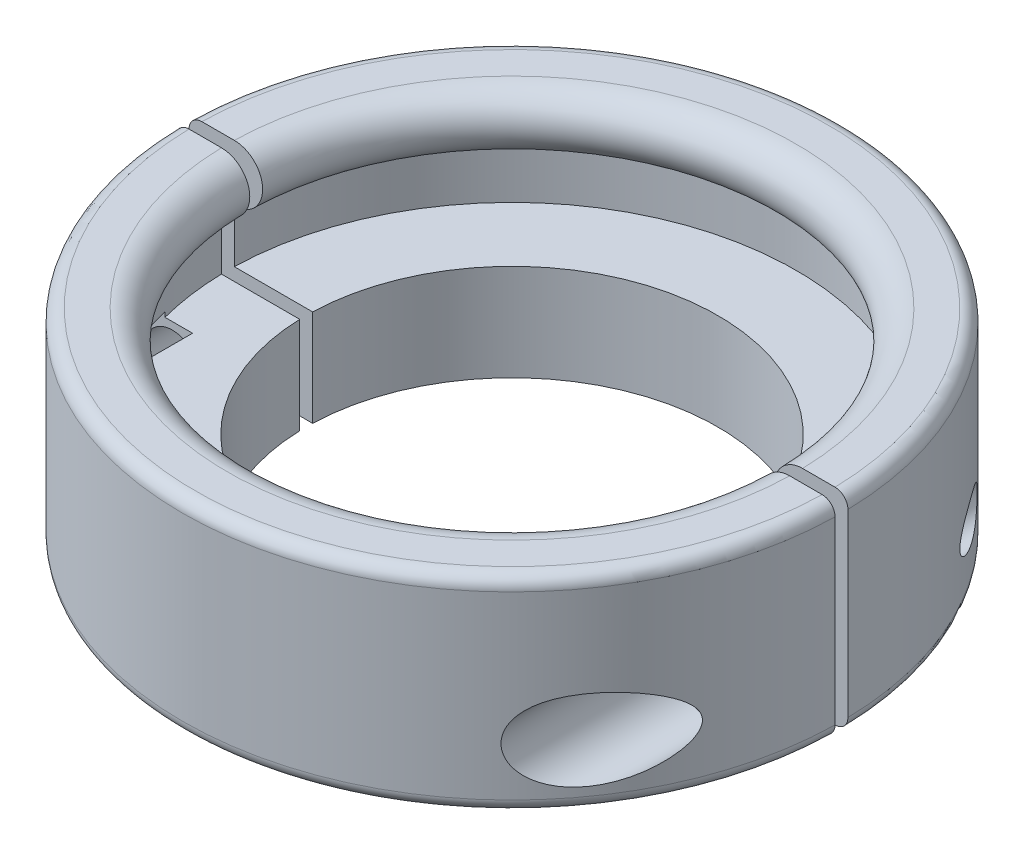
ISO-10303-21;
HEADER;
FILE_DESCRIPTION(('STEP AP214'),'2;1');
FILE_NAME('part.step','',(''),(''),'','','');
FILE_SCHEMA(('AUTOMOTIVE_DESIGN { 1 0 10303 214 1 1 1 1 }'));
ENDSEC;
DATA;
#1=APPLICATION_CONTEXT('core data for automotive mechanical design processes');
#2=APPLICATION_PROTOCOL_DEFINITION('international standard','automotive_design',2000,#1);
#3=PRODUCT_CONTEXT('',#1,'mechanical');
#4=PRODUCT('Part','Part','',(#3));
#5=PRODUCT_RELATED_PRODUCT_CATEGORY('part','',(#4));
#6=PRODUCT_DEFINITION_FORMATION('','',#4);
#7=PRODUCT_DEFINITION_CONTEXT('part definition',#1,'design');
#8=PRODUCT_DEFINITION('design','',#6,#7);
#9=PRODUCT_DEFINITION_SHAPE('','',#8);
#10=(LENGTH_UNIT() NAMED_UNIT(*) SI_UNIT(.MILLI.,.METRE.));
#11=(NAMED_UNIT(*) PLANE_ANGLE_UNIT() SI_UNIT($,.RADIAN.));
#12=(NAMED_UNIT(*) SI_UNIT($,.STERADIAN.) SOLID_ANGLE_UNIT());
#13=UNCERTAINTY_MEASURE_WITH_UNIT(LENGTH_MEASURE(1.E-05),#10,'distance_accuracy_value','');
#14=(GEOMETRIC_REPRESENTATION_CONTEXT(3) GLOBAL_UNCERTAINTY_ASSIGNED_CONTEXT((#13)) GLOBAL_UNIT_ASSIGNED_CONTEXT((#10,
#11,#12)) REPRESENTATION_CONTEXT('',''));
#15=CARTESIAN_POINT('',(0.,0.,0.));
#16=DIRECTION('',(0.,0.,1.));
#17=DIRECTION('',(1.,0.,0.));
#18=AXIS2_PLACEMENT_3D('',#15,#16,#17);
#19=CARTESIAN_POINT('',(0.,-25.4,0.));
#20=DIRECTION('',(0.,-1.,0.));
#21=DIRECTION('',(0.,0.,-1.));
#22=AXIS2_PLACEMENT_3D('',#19,#20,#21);
#23=CYLINDRICAL_SURFACE('',#22,40.64);
#24=CARTESIAN_POINT('',(-28.0493012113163,-17.7776734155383,29.4082692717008));
#25=CARTESIAN_POINT('',(-28.0493023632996,-17.6672097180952,29.408268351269));
#26=CARTESIAN_POINT('',(-28.0529988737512,-17.5567148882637,29.4047438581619));
#27=CARTESIAN_POINT('',(-28.0677156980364,-17.3366115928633,29.390696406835));
#28=CARTESIAN_POINT('',(-28.0787406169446,-17.2270037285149,29.380169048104));
#29=CARTESIAN_POINT('',(-28.1079224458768,-17.0094091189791,29.3522520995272));
#30=CARTESIAN_POINT('',(-28.1260930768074,-16.9014259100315,29.3348493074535));
#31=CARTESIAN_POINT('',(-28.1692215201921,-16.6880720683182,29.2934369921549));
#32=CARTESIAN_POINT('',(-28.194182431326,-16.5827026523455,29.2694244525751));
#33=CARTESIAN_POINT('',(-28.2502512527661,-16.3760018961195,29.2153112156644));
#34=CARTESIAN_POINT('',(-28.2813181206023,-16.2746487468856,29.1852511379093));
#35=CARTESIAN_POINT('',(-28.3491865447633,-16.0758050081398,29.1193313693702));
#36=CARTESIAN_POINT('',(-28.3859903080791,-15.978315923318,29.083469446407));
#37=CARTESIAN_POINT('',(-28.5041309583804,-15.6924802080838,28.9678486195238));
#38=CARTESIAN_POINT('',(-28.5932599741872,-15.5105401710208,28.8799945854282));
#39=CARTESIAN_POINT('',(-28.821352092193,-15.106615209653,28.6526297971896));
#40=CARTESIAN_POINT('',(-28.9668890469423,-14.8925455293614,28.505762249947));
#41=CARTESIAN_POINT('',(-29.2775682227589,-14.5004649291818,28.1865793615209));
#42=CARTESIAN_POINT('',(-29.4427485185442,-14.3225259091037,28.0142144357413));
#43=CARTESIAN_POINT('',(-29.7340521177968,-14.0489079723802,27.7042741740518));
#44=CARTESIAN_POINT('',(-29.857263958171,-13.9444703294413,27.571502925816));
#45=CARTESIAN_POINT('',(-30.1075071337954,-13.751670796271,27.2980207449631));
#46=CARTESIAN_POINT('',(-30.2345399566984,-13.6633152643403,27.1573067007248));
#47=CARTESIAN_POINT('',(-30.4908414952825,-13.5015794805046,26.8692279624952));
#48=CARTESIAN_POINT('',(-30.6201123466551,-13.4282144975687,26.7218566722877));
#49=CARTESIAN_POINT('',(-30.8794809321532,-13.2954648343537,26.4217076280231));
#50=CARTESIAN_POINT('',(-31.0095786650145,-13.2360801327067,26.2689298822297));
#51=CARTESIAN_POINT('',(-31.3361920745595,-13.1031186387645,25.8794536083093));
#52=CARTESIAN_POINT('',(-31.5326171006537,-13.0378374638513,25.6398290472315));
#53=CARTESIAN_POINT('',(-31.9225873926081,-12.9334791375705,25.1526450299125));
#54=CARTESIAN_POINT('',(-32.1161311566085,-12.8944152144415,24.9050816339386));
#55=CARTESIAN_POINT('',(-32.4990496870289,-12.8396318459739,24.4033031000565));
#56=CARTESIAN_POINT('',(-32.6884130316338,-12.8239700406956,24.149073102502));
#57=CARTESIAN_POINT('',(-33.0612699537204,-12.8138157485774,23.636045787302));
#58=CARTESIAN_POINT('',(-33.2447639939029,-12.8193215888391,23.3772488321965));
#59=CARTESIAN_POINT('',(-33.6834544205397,-12.8561431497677,22.7429290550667));
#60=CARTESIAN_POINT('',(-33.9351560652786,-12.8976356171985,22.3655564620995));
#61=CARTESIAN_POINT('',(-34.4234500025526,-13.0160729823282,21.6064730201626));
#62=CARTESIAN_POINT('',(-34.6600329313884,-13.0930396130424,21.224759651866));
#63=CARTESIAN_POINT('',(-35.1166385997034,-13.2798653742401,20.4604237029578));
#64=CARTESIAN_POINT('',(-35.3366911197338,-13.3896634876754,20.0778041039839));
#65=CARTESIAN_POINT('',(-35.653997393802,-13.5786603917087,19.5051217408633));
#66=CARTESIAN_POINT('',(-35.7576164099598,-13.6456922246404,19.3144764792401));
#67=CARTESIAN_POINT('',(-35.960531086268,-13.7880585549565,18.9339969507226));
#68=CARTESIAN_POINT('',(-36.0598273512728,-13.8633918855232,18.7441625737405));
#69=CARTESIAN_POINT('',(-36.2306727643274,-14.0036022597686,18.411248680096));
#70=CARTESIAN_POINT('',(-36.3031632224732,-14.0666515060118,18.2678791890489));
#71=CARTESIAN_POINT('',(-36.4454902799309,-14.1980091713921,17.9822492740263));
#72=CARTESIAN_POINT('',(-36.5153271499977,-14.2663170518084,17.839988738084));
#73=CARTESIAN_POINT('',(-36.6522462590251,-14.4085541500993,17.5569687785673));
#74=CARTESIAN_POINT('',(-36.7193287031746,-14.4824829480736,17.4162092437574));
#75=CARTESIAN_POINT('',(-36.8506020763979,-14.6364697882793,17.1367021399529));
#76=CARTESIAN_POINT('',(-36.9147930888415,-14.7165276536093,16.9979545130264));
#77=CARTESIAN_POINT('',(-37.0404373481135,-14.8839370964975,16.7223997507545));
#78=CARTESIAN_POINT('',(-37.1018731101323,-14.9713272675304,16.5856079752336));
#79=CARTESIAN_POINT('',(-37.2213362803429,-15.1540011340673,16.3157437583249));
#80=CARTESIAN_POINT('',(-37.2793625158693,-15.2492875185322,16.182672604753));
#81=CARTESIAN_POINT('',(-37.3916165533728,-15.4492251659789,15.9215838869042));
#82=CARTESIAN_POINT('',(-37.445837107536,-15.5538934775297,15.7935761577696));
#83=CARTESIAN_POINT('',(-37.5495764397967,-15.7741461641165,15.5453189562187));
#84=CARTESIAN_POINT('',(-37.5990992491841,-15.8897210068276,15.4250628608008));
#85=CARTESIAN_POINT('',(-37.6742229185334,-16.0869788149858,15.2403511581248));
#86=CARTESIAN_POINT('',(-37.7016791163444,-16.1645244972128,15.1722738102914));
#87=CARTESIAN_POINT('',(-37.7538786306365,-16.3251609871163,15.0419149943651));
#88=CARTESIAN_POINT('',(-37.7786208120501,-16.4082540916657,14.9796359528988));
#89=CARTESIAN_POINT('',(-37.8475285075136,-16.6656742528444,14.8050500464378));
#90=CARTESIAN_POINT('',(-37.8869545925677,-16.849578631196,14.7035582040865));
#91=CARTESIAN_POINT('',(-37.9308071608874,-17.1432526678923,14.5899019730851));
#92=CARTESIAN_POINT('',(-37.9428883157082,-17.2444016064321,14.558415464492));
#93=CARTESIAN_POINT('',(-37.9608507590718,-17.4509509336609,14.5115139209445));
#94=CARTESIAN_POINT('',(-37.9667375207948,-17.5563474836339,14.4960846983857));
#95=CARTESIAN_POINT('',(-37.9716752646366,-17.7688576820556,14.483146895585));
#96=CARTESIAN_POINT('',(-37.9706985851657,-17.8759765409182,14.4857108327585));
#97=CARTESIAN_POINT('',(-37.9619639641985,-18.08802702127,14.5085844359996));
#98=CARTESIAN_POINT('',(-37.954200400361,-18.1929567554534,14.5289088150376));
#99=CARTESIAN_POINT('',(-37.9302564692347,-18.4211323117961,14.5913185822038));
#100=CARTESIAN_POINT('',(-37.9125662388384,-18.543133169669,14.6372946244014));
#101=CARTESIAN_POINT('',(-37.8701612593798,-18.7777386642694,14.7466569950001));
#102=CARTESIAN_POINT('',(-37.845430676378,-18.8903213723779,14.8100825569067));
#103=CARTESIAN_POINT('',(-37.7947750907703,-19.0898741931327,14.9388298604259));
#104=CARTESIAN_POINT('',(-37.7695807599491,-19.1781577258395,15.0024520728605));
#105=CARTESIAN_POINT('',(-37.7160995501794,-19.3485383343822,15.1364010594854));
#106=CARTESIAN_POINT('',(-37.6878102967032,-19.4306305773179,15.2067329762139));
#107=CARTESIAN_POINT('',(-37.6286486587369,-19.5893842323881,15.3525440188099));
#108=CARTESIAN_POINT('',(-37.5977712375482,-19.6660344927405,15.4280331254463));
#109=CARTESIAN_POINT('',(-37.5338584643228,-19.8144028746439,15.58287815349));
#110=CARTESIAN_POINT('',(-37.5008222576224,-19.8861190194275,15.6622356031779));
#111=CARTESIAN_POINT('',(-37.429518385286,-20.0320346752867,15.8319309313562));
#112=CARTESIAN_POINT('',(-37.3910565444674,-20.1057775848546,15.9225782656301));
#113=CARTESIAN_POINT('',(-37.3121312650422,-20.2485812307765,16.1066604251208));
#114=CARTESIAN_POINT('',(-37.2716673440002,-20.317640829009,16.2000959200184));
#115=CARTESIAN_POINT('',(-37.1475009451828,-20.5186728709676,16.4837895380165));
#116=CARTESIAN_POINT('',(-37.0610784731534,-20.6443895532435,16.6773042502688));
#117=CARTESIAN_POINT('',(-36.8817595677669,-20.8823175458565,17.0702157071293));
#118=CARTESIAN_POINT('',(-36.7888469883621,-20.9944931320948,17.269626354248));
#119=CARTESIAN_POINT('',(-36.5972915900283,-21.2068061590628,17.6719400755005));
#120=CARTESIAN_POINT('',(-36.4986508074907,-21.3069478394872,17.8748418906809));
#121=CARTESIAN_POINT('',(-36.3025529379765,-21.490237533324,18.2696369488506));
#122=CARTESIAN_POINT('',(-36.2054379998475,-21.5740678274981,18.4613854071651));
#123=CARTESIAN_POINT('',(-36.0066296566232,-21.7328820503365,18.8461967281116));
#124=CARTESIAN_POINT('',(-35.9049356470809,-21.8078648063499,19.0392597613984));
#125=CARTESIAN_POINT('',(-35.6970416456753,-21.9493582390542,19.4262474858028));
#126=CARTESIAN_POINT('',(-35.590838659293,-22.0158631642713,19.6201726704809));
#127=CARTESIAN_POINT('',(-35.3740971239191,-22.1404751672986,20.0083055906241));
#128=CARTESIAN_POINT('',(-35.2635581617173,-22.1985814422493,20.2025133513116));
#129=CARTESIAN_POINT('',(-34.9257758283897,-22.3602075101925,20.7846287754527));
#130=CARTESIAN_POINT('',(-34.692157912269,-22.4511764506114,21.1724187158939));
#131=CARTESIAN_POINT('',(-34.2090210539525,-22.5977947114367,21.9444681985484));
#132=CARTESIAN_POINT('',(-33.9595125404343,-22.6534669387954,22.3287298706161));
#133=CARTESIAN_POINT('',(-33.5266918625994,-22.714498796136,22.9710652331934));
#134=CARTESIAN_POINT('',(-33.3472588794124,-22.7301783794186,23.2307934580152));
#135=CARTESIAN_POINT('',(-32.9821234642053,-22.7415784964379,23.7463439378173));
#136=CARTESIAN_POINT('',(-32.7964206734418,-22.7372978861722,24.002165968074));
#137=CARTESIAN_POINT('',(-32.4200586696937,-22.7067096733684,24.5081341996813));
#138=CARTESIAN_POINT('',(-32.2294089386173,-22.6804415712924,24.7582897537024));
#139=CARTESIAN_POINT('',(-31.8442543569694,-22.6033886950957,25.251749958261));
#140=CARTESIAN_POINT('',(-31.6497511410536,-22.5526141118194,25.4950574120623));
#141=CARTESIAN_POINT('',(-31.3232438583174,-22.4447835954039,25.8941489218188));
#142=CARTESIAN_POINT('',(-31.1917303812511,-22.3952898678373,26.0523927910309));
#143=CARTESIAN_POINT('',(-30.9287509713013,-22.2828847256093,26.3640568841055));
#144=CARTESIAN_POINT('',(-30.7972850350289,-22.2199768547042,26.5174783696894));
#145=CARTESIAN_POINT('',(-30.5355449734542,-22.0796777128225,26.8184603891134));
#146=CARTESIAN_POINT('',(-30.4052700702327,-22.0022967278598,26.9660249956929));
#147=CARTESIAN_POINT('',(-30.1472878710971,-21.8319270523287,27.254138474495));
#148=CARTESIAN_POINT('',(-30.0195797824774,-21.7389432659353,27.3946895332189));
#149=CARTESIAN_POINT('',(-29.7101505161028,-21.48915392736,27.7306667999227));
#150=CARTESIAN_POINT('',(-29.5308199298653,-21.3227393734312,27.9213446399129));
#151=CARTESIAN_POINT('',(-29.1889592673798,-20.9512442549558,28.2785301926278));
#152=CARTESIAN_POINT('',(-29.0264049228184,-20.7462207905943,28.4450729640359));
#153=CARTESIAN_POINT('',(-28.760233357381,-20.3452630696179,28.7138707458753));
#154=CARTESIAN_POINT('',(-28.6514707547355,-20.1569374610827,28.8222410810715));
#155=CARTESIAN_POINT('',(-28.5050803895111,-19.857705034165,28.9667865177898));
#156=CARTESIAN_POINT('',(-28.4590676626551,-19.7551460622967,29.011974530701));
#157=CARTESIAN_POINT('',(-28.3733493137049,-19.544825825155,29.0958113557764));
#158=CARTESIAN_POINT('',(-28.3336427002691,-19.43706538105,29.1344611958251));
#159=CARTESIAN_POINT('',(-28.2661276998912,-19.231717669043,29.1999577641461));
#160=CARTESIAN_POINT('',(-28.2374379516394,-19.1347017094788,29.2276920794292));
#161=CARTESIAN_POINT('',(-28.1857793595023,-18.9377445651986,29.2775123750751));
#162=CARTESIAN_POINT('',(-28.1628095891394,-18.837803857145,29.2995992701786));
#163=CARTESIAN_POINT('',(-28.1230080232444,-18.6358141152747,29.3378046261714));
#164=CARTESIAN_POINT('',(-28.1061632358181,-18.5337700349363,29.3539357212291));
#165=CARTESIAN_POINT('',(-28.0788426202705,-18.3280961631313,29.3800707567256));
#166=CARTESIAN_POINT('',(-28.068363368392,-18.2244672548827,29.3900779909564));
#167=CARTESIAN_POINT('',(-28.0572116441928,-18.063474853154,29.4007227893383));
#168=CARTESIAN_POINT('',(-28.054247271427,-18.0063986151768,29.4035511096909));
#169=CARTESIAN_POINT('',(-28.0502916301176,-17.8921088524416,29.4073247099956));
#170=CARTESIAN_POINT('',(-28.0493006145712,-17.8348953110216,29.4082697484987));
#171=CARTESIAN_POINT('',(-28.0493012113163,-17.7776734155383,29.4082692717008));
#172=B_SPLINE_CURVE_WITH_KNOTS('',3,(#24,#25,#26,#27,#28,#29,#30,#31,#32,#33,#34,#35,#36,#37,
#38,#39,#40,#41,#42,#43,#44,#45,#46,#47,#48,#49,#50,#51,#52,#53,#54,#55,#56,#57,#58,#59,#60,#61,
#62,#63,#64,#65,#66,#67,#68,#69,#70,#71,#72,#73,#74,#75,#76,#77,#78,#79,#80,#81,#82,#83,#84,#85,
#86,#87,#88,#89,#90,#91,#92,#93,#94,#95,#96,#97,#98,#99,#100,#101,#102,#103,#104,#105,#106,#107,
#108,#109,#110,#111,#112,#113,#114,#115,#116,#117,#118,#119,#120,#121,#122,#123,#124,#125,#126,
#127,#128,#129,#130,#131,#132,#133,#134,#135,#136,#137,#138,#139,#140,#141,#142,#143,#144,#145,
#146,#147,#148,#149,#150,#151,#152,#153,#154,#155,#156,#157,#158,#159,#160,#161,#162,#163,#164,
#165,#166,#167,#168,#169,#170,#171),.UNSPECIFIED.,.T.,.F.,(4,2,2,2,2,2,2,2,2,2,2,2,2,2,2,2,2,2,
2,2,2,2,2,2,2,2,2,2,2,2,2,2,2,2,2,2,2,2,2,2,2,2,2,2,2,2,2,2,2,2,2,2,2,2,2,2,2,2,2,2,2,2,2,2,2,2,
2,2,2,2,2,2,2,4),(0.,0.331328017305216,0.662864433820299,0.995040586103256,1.32736857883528,
1.65753477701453,1.98782830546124,2.64770033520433,3.53580845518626,4.42566694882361,
5.05212890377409,5.67883800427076,6.30618230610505,6.93352564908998,7.88199643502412,
8.83094542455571,9.78222787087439,10.7334351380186,12.0980235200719,13.463449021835,
14.8263524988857,15.5075102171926,16.1885723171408,16.7062296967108,17.2238341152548,
17.7413999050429,18.2589507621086,18.7794208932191,19.300068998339,19.8216831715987,
20.3428456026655,20.662845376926,20.9829784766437,21.616973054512,21.93564120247,
22.2540275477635,22.5736978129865,22.8936331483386,23.2861478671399,23.679552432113,
24.0141718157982,24.3490497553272,24.6845952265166,25.0202743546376,25.3891732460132,
25.7581614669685,26.496672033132,27.2370902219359,27.9772467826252,28.6691451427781,
29.3611351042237,30.053592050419,30.7461151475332,32.1297710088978,33.5125279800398,
34.4601187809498,35.4077638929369,36.3537102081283,37.299263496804,37.9337357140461,
38.568040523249,39.2018962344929,39.8355530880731,40.7628098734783,41.6887059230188,
42.4145345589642,42.7776070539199,43.1406224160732,43.4550021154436,43.7693308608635,
44.0829889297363,44.396478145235,44.5680891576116,44.7397221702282),.UNSPECIFIED.);
#173=CARTESIAN_POINT('',(-28.0493012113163,-17.7776734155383,29.4082692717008));
#174=VERTEX_POINT('',#173);
#175=EDGE_CURVE('E256',#174,#174,#172,.T.);
#176=ORIENTED_EDGE('',*,*,#175,.F.);
#177=EDGE_LOOP('',(#176));
#178=FACE_BOUND('',#177,.T.);
#179=CARTESIAN_POINT('',(37.9705412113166,-17.7776734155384,14.4861174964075));
#180=CARTESIAN_POINT('',(37.9705339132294,-17.6634787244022,14.4861382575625));
#181=CARTESIAN_POINT('',(37.966544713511,-17.5491899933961,14.4966062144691));
#182=CARTESIAN_POINT('',(37.9510991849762,-17.3245928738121,14.5369906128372));
#183=CARTESIAN_POINT('',(37.9396277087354,-17.2142930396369,14.5669465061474));
#184=CARTESIAN_POINT('',(37.9063653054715,-16.9704032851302,14.6533179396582));
#185=CARTESIAN_POINT('',(37.8825869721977,-16.8389133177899,14.7147869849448));
#186=CARTESIAN_POINT('',(37.8274688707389,-16.5878735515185,14.855905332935));
#187=CARTESIAN_POINT('',(37.7961107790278,-16.4683536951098,14.9355986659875));
#188=CARTESIAN_POINT('',(37.7310587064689,-16.2511747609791,15.0991335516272));
#189=CARTESIAN_POINT('',(37.6978636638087,-16.1525170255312,15.1818756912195));
#190=CARTESIAN_POINT('',(37.6278418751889,-15.9630747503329,15.3546022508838));
#191=CARTESIAN_POINT('',(37.5910119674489,-15.8722971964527,15.4445929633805));
#192=CARTESIAN_POINT('',(37.5143187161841,-15.6974623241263,15.6299577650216));
#193=CARTESIAN_POINT('',(37.4744497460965,-15.6134180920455,15.7253417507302));
#194=CARTESIAN_POINT('',(37.3921562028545,-15.4512964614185,15.9200325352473));
#195=CARTESIAN_POINT('',(37.3497306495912,-15.3732213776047,16.0193408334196));
#196=CARTESIAN_POINT('',(37.256859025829,-15.2123257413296,16.2342696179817));
#197=CARTESIAN_POINT('',(37.2060953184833,-15.1302483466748,16.3503072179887));
#198=CARTESIAN_POINT('',(37.1019900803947,-14.9720230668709,16.5851879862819));
#199=CARTESIAN_POINT('',(37.0486487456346,-14.8958747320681,16.7040309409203));
#200=CARTESIAN_POINT('',(36.8849475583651,-14.6751585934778,17.0639866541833));
#201=CARTESIAN_POINT('',(36.7709992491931,-14.5384694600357,17.3083200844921));
#202=CARTESIAN_POINT('',(36.534290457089,-14.282394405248,17.802545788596));
#203=CARTESIAN_POINT('',(36.4115076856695,-14.1630547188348,18.0524509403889));
#204=CARTESIAN_POINT('',(36.1579457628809,-13.9402052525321,18.5551005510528));
#205=CARTESIAN_POINT('',(36.0271694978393,-13.8366898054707,18.8078439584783));
#206=CARTESIAN_POINT('',(35.7893584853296,-13.6668905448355,19.2556448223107));
#207=CARTESIAN_POINT('',(35.6839071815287,-13.5975561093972,19.4503968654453));
#208=CARTESIAN_POINT('',(35.4685952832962,-13.4673959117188,19.8403118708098));
#209=CARTESIAN_POINT('',(35.3587343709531,-13.4065707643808,20.0354748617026));
#210=CARTESIAN_POINT('',(35.0225616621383,-13.2367286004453,20.6211615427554));
#211=CARTESIAN_POINT('',(34.789738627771,-13.1404008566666,21.0117343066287));
#212=CARTESIAN_POINT('',(34.3082823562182,-12.9833066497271,21.7889887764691));
#213=CARTESIAN_POINT('',(34.0596859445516,-12.9224605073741,22.1756772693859));
#214=CARTESIAN_POINT('',(33.5475276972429,-12.8394571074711,22.9430889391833));
#215=CARTESIAN_POINT('',(33.2839776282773,-12.8172698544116,23.3238165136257));
#216=CARTESIAN_POINT('',(32.8559743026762,-12.8169293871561,23.9200373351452));
#217=CARTESIAN_POINT('',(32.6957288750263,-12.8243354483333,24.1386037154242));
#218=CARTESIAN_POINT('',(32.3714922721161,-12.8556118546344,24.5717148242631));
#219=CARTESIAN_POINT('',(32.2075021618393,-12.8794775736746,24.7862606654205));
#220=CARTESIAN_POINT('',(31.8767865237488,-12.9452662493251,25.2101626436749));
#221=CARTESIAN_POINT('',(31.7100634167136,-12.9871739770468,25.4195230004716));
#222=CARTESIAN_POINT('',(31.3750120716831,-13.090929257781,25.8319321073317));
#223=CARTESIAN_POINT('',(31.2066843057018,-13.152771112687,26.0349826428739));
#224=CARTESIAN_POINT('',(30.9144443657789,-13.2793433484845,26.3807443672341));
#225=CARTESIAN_POINT('',(30.7904977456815,-13.339033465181,26.5252760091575));
#226=CARTESIAN_POINT('',(30.543583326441,-13.4713351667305,26.8092240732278));
#227=CARTESIAN_POINT('',(30.4206155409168,-13.5439469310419,26.9486404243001));
#228=CARTESIAN_POINT('',(30.1769714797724,-13.70296144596,27.2211929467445));
#229=CARTESIAN_POINT('',(30.0562926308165,-13.7893475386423,27.3543364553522));
#230=CARTESIAN_POINT('',(29.8185835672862,-13.9768791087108,27.6132685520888));
#231=CARTESIAN_POINT('',(29.7015529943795,-14.0780231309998,27.7390578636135));
#232=CARTESIAN_POINT('',(29.4228742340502,-14.3436699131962,28.0350013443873));
#233=CARTESIAN_POINT('',(29.2640823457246,-14.5165429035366,28.2005154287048));
#234=CARTESIAN_POINT('',(28.9649017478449,-14.8960415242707,28.5077186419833));
#235=CARTESIAN_POINT('',(28.8244883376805,-15.1026209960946,28.6494398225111));
#236=CARTESIAN_POINT('',(28.5948841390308,-15.5064802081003,28.8784243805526));
#237=CARTESIAN_POINT('',(28.5010298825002,-15.6980724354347,28.9709185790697));
#238=CARTESIAN_POINT('',(28.3776163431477,-15.9996544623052,29.0916450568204));
#239=CARTESIAN_POINT('',(28.339362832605,-16.1025857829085,29.1288945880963));
#240=CARTESIAN_POINT('',(28.2692733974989,-16.3126653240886,29.1969204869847));
#241=CARTESIAN_POINT('',(28.237434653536,-16.4198116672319,29.2276996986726));
#242=CARTESIAN_POINT('',(28.1805480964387,-16.6384779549,29.2825525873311));
#243=CARTESIAN_POINT('',(28.1555526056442,-16.7500245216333,29.3065746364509));
#244=CARTESIAN_POINT('',(28.1131884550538,-16.9758345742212,29.3472161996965));
#245=CARTESIAN_POINT('',(28.0958161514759,-17.0900967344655,29.3638392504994));
#246=CARTESIAN_POINT('',(28.0690639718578,-17.320382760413,29.3894129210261));
#247=CARTESIAN_POINT('',(28.0596824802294,-17.4364062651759,29.3983650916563));
#248=CARTESIAN_POINT('',(28.0491206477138,-17.669159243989,29.4084424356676));
#249=CARTESIAN_POINT('',(28.04793943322,-17.7858886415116,29.4095684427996));
#250=CARTESIAN_POINT('',(28.0534629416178,-18.0055271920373,29.4042994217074));
#251=CARTESIAN_POINT('',(28.0592760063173,-18.1084812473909,29.3987547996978));
#252=CARTESIAN_POINT('',(28.0772373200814,-18.313358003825,29.3816013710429));
#253=CARTESIAN_POINT('',(28.0893875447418,-18.415280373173,29.3699906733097));
#254=CARTESIAN_POINT('',(28.1198087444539,-18.6173022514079,29.3408656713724));
#255=CARTESIAN_POINT('',(28.1380768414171,-18.7174025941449,29.3233541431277));
#256=CARTESIAN_POINT('',(28.18042589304,-18.9152047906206,29.2826579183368));
#257=CARTESIAN_POINT('',(28.2045091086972,-19.0129056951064,29.2594710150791));
#258=CARTESIAN_POINT('',(28.2851033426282,-19.3020959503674,29.1816404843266));
#259=CARTESIAN_POINT('',(28.3498844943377,-19.4891934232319,29.1187976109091));
#260=CARTESIAN_POINT('',(28.4977676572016,-19.8479425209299,28.974083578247));
#261=CARTESIAN_POINT('',(28.5808777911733,-20.0195872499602,28.8922039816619));
#262=CARTESIAN_POINT('',(28.799689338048,-20.414283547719,28.6743806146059));
#263=CARTESIAN_POINT('',(28.9428236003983,-20.6286755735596,28.5301690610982));
#264=CARTESIAN_POINT('',(29.2488939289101,-21.0218714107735,28.2163058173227));
#265=CARTESIAN_POINT('',(29.4118704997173,-21.2006003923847,28.0466019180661));
#266=CARTESIAN_POINT('',(29.6992694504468,-21.4755403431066,27.7415400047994));
#267=CARTESIAN_POINT('',(29.8206974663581,-21.5804655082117,27.611029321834));
#268=CARTESIAN_POINT('',(30.0674785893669,-21.7744755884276,27.3420849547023));
#269=CARTESIAN_POINT('',(30.1928332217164,-21.8635542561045,27.2036481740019));
#270=CARTESIAN_POINT('',(30.4458866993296,-22.0269304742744,26.9201363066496));
#271=CARTESIAN_POINT('',(30.5735876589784,-22.1012138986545,26.7750550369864));
#272=CARTESIAN_POINT('',(30.8299380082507,-22.2359677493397,26.4794793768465));
#273=CARTESIAN_POINT('',(30.9585873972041,-22.296438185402,26.3289849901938));
#274=CARTESIAN_POINT('',(31.2814943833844,-22.4322123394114,25.9454916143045));
#275=CARTESIAN_POINT('',(31.4757392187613,-22.4993446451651,25.7095710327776));
#276=CARTESIAN_POINT('',(31.861625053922,-22.6077200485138,25.22977218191));
#277=CARTESIAN_POINT('',(32.053264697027,-22.6489501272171,24.9858899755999));
#278=CARTESIAN_POINT('',(32.4326526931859,-22.708339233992,24.4914266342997));
#279=CARTESIAN_POINT('',(32.620389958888,-22.726439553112,24.2408300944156));
#280=CARTESIAN_POINT('',(32.9902527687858,-22.7417050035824,23.7350175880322));
#281=CARTESIAN_POINT('',(33.1723787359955,-22.7388717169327,23.479801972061));
#282=CARTESIAN_POINT('',(33.6096879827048,-22.7087141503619,22.851754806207));
#283=CARTESIAN_POINT('',(33.8614222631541,-22.6710786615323,22.4769928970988));
#284=CARTESIAN_POINT('',(34.3500637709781,-22.5604090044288,21.7229117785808));
#285=CARTESIAN_POINT('',(34.5869618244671,-22.487353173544,21.3435899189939));
#286=CARTESIAN_POINT('',(35.0443511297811,-22.3085717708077,20.5839506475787));
#287=CARTESIAN_POINT('',(35.2648788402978,-22.2029216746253,20.2036375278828));
#288=CARTESIAN_POINT('',(35.5831130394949,-22.0204715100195,19.6341287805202));
#289=CARTESIAN_POINT('',(35.6870760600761,-21.9556763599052,19.4444955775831));
#290=CARTESIAN_POINT('',(35.8907540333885,-21.8179291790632,19.0659268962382));
#291=CARTESIAN_POINT('',(35.9904692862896,-21.7449777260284,18.8769913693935));
#292=CARTESIAN_POINT('',(36.2315297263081,-21.5542532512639,18.4114943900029));
#293=CARTESIAN_POINT('',(36.3703475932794,-21.4315593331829,18.1355991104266));
#294=CARTESIAN_POINT('',(36.5711365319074,-21.2322895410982,17.7252607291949));
#295=CARTESIAN_POINT('',(36.6368771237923,-21.1632655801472,17.5889555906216));
#296=CARTESIAN_POINT('',(36.7657291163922,-21.0197355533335,17.3180035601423));
#297=CARTESIAN_POINT('',(36.8288407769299,-20.9452300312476,17.1833565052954));
#298=CARTESIAN_POINT('',(36.9603672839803,-20.7800544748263,16.8987728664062));
#299=CARTESIAN_POINT('',(37.0283950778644,-20.6885450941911,16.7491417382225));
#300=CARTESIAN_POINT('',(37.1606050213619,-20.4967099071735,16.4537295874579));
#301=CARTESIAN_POINT('',(37.2247853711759,-20.3963800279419,16.307950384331));
#302=CARTESIAN_POINT('',(37.3485567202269,-20.1857596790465,16.0224540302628));
#303=CARTESIAN_POINT('',(37.4081613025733,-20.075500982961,15.8827195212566));
#304=CARTESIAN_POINT('',(37.5221082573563,-19.8427911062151,15.6116149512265));
#305=CARTESIAN_POINT('',(37.576456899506,-19.7203548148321,15.4802349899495));
#306=CARTESIAN_POINT('',(37.6680182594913,-19.4871122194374,15.2558693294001));
#307=CARTESIAN_POINT('',(37.7064590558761,-19.3790730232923,15.1605364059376));
#308=CARTESIAN_POINT('',(37.7779110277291,-19.1517938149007,14.9815981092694));
#309=CARTESIAN_POINT('',(37.8109231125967,-19.0325556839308,14.8979907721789));
#310=CARTESIAN_POINT('',(37.8650347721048,-18.8011320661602,14.7598571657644));
#311=CARTESIAN_POINT('',(37.8871873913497,-18.6907131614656,14.702832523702));
#312=CARTESIAN_POINT('',(37.9245501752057,-18.4614408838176,14.6061907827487));
#313=CARTESIAN_POINT('',(37.9397802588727,-18.3426128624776,14.5665237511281));
#314=CARTESIAN_POINT('',(37.9572025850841,-18.1484319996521,14.521043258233));
#315=CARTESIAN_POINT('',(37.9621774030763,-18.0749902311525,14.5080245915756));
#316=CARTESIAN_POINT('',(37.9688490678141,-17.9269368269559,14.4905550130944));
#317=CARTESIAN_POINT('',(37.9705459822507,-17.852325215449,14.4861039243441));
#318=CARTESIAN_POINT('',(37.9705412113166,-17.7776734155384,14.4861174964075));
#319=B_SPLINE_CURVE_WITH_KNOTS('',3,(#179,#180,#181,#182,#183,#184,#185,#186,#187,#188,#189,
#190,#191,#192,#193,#194,#195,#196,#197,#198,#199,#200,#201,#202,#203,#204,#205,#206,#207,#208,
#209,#210,#211,#212,#213,#214,#215,#216,#217,#218,#219,#220,#221,#222,#223,#224,#225,#226,#227,
#228,#229,#230,#231,#232,#233,#234,#235,#236,#237,#238,#239,#240,#241,#242,#243,#244,#245,#246,
#247,#248,#249,#250,#251,#252,#253,#254,#255,#256,#257,#258,#259,#260,#261,#262,#263,#264,#265,
#266,#267,#268,#269,#270,#271,#272,#273,#274,#275,#276,#277,#278,#279,#280,#281,#282,#283,#284,
#285,#286,#287,#288,#289,#290,#291,#292,#293,#294,#295,#296,#297,#298,#299,#300,#301,#302,#303,
#304,#305,#306,#307,#308,#309,#310,#311,#312,#313,#314,#315,#316,#317,#318),.UNSPECIFIED.,.T.,
.F.,(4,2,2,2,2,2,2,2,2,2,2,2,2,2,2,2,2,2,2,2,2,2,2,2,2,2,2,2,2,2,2,2,2,2,2,2,2,2,2,2,2,2,2,2,2,
2,2,2,2,2,2,2,2,2,2,2,2,2,2,2,2,2,2,2,2,2,2,2,2,4),(0.,0.34224546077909,0.685185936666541,
1.123914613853,1.56371468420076,1.96205161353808,2.36073814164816,2.76018162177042,
3.15977922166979,3.61235423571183,4.06489489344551,4.97078313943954,5.87904291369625,
6.78697664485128,7.48298395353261,8.17904153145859,9.57168693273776,10.9611927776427,
12.3496200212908,13.1625109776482,13.975173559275,14.7871515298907,15.5988976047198,
16.1970847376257,16.7952801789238,17.392757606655,17.9901761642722,18.8487182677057,
19.7060943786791,20.4006069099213,20.7481055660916,21.095451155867,21.4453826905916,
21.7951467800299,22.1448401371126,22.4944962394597,22.8039236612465,23.1134476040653,
23.4228261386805,23.7323251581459,24.3527768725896,24.9735041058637,25.8547512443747,
26.7378284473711,27.3575898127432,27.9775949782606,28.598189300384,29.2187831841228,
30.1559862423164,31.0936599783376,32.0337090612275,32.9736871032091,34.3308336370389,
35.6888112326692,37.0436675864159,37.7207887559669,38.3978619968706,39.3940190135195,
39.8929122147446,40.3917559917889,40.9558910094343,41.5202878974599,42.0829388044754,
42.6449100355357,43.0915916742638,43.5381984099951,43.9156551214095,44.2920187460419,
44.5157574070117,44.7394914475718),.UNSPECIFIED.);
#320=CARTESIAN_POINT('',(37.9705412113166,-17.7776734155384,14.4861174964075));
#321=VERTEX_POINT('',#320);
#322=EDGE_CURVE('E327',#321,#321,#319,.T.);
#323=ORIENTED_EDGE('',*,*,#322,.F.);
#324=EDGE_LOOP('',(#323));
#325=FACE_BOUND('',#324,.T.);
#326=DIRECTION('',(0.,-1.,0.));
#327=VECTOR('',#326,1.);
#328=CARTESIAN_POINT('',(40.6322477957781,0.,0.79374999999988));
#329=LINE('',#328,#327);
#330=CARTESIAN_POINT('',(40.6322477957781,-1.58750000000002,0.79374999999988));
#331=VERTEX_POINT('',#330);
#332=CARTESIAN_POINT('',(40.6322477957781,-23.8125,0.79374999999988));
#333=VERTEX_POINT('',#332);
#334=EDGE_CURVE('E375',#331,#333,#329,.T.);
#335=ORIENTED_EDGE('',*,*,#334,.F.);
#336=CARTESIAN_POINT('',(0.,-1.58750000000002,0.));
#337=DIRECTION('',(0.,1.,0.));
#338=DIRECTION('',(0.,0.,1.));
#339=AXIS2_PLACEMENT_3D('',#336,#337,#338);
#340=CIRCLE('',#339,40.64);
#341=CARTESIAN_POINT('',(-40.632247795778,-1.58750000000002,0.793750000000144));
#342=VERTEX_POINT('',#341);
#343=EDGE_CURVE('E399',#331,#342,#340,.F.);
#344=ORIENTED_EDGE('',*,*,#343,.T.);
#345=DIRECTION('',(0.,-1.,0.));
#346=VECTOR('',#345,1.);
#347=CARTESIAN_POINT('',(-40.632247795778,0.,0.793750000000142));
#348=LINE('',#347,#346);
#349=CARTESIAN_POINT('',(-40.6322477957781,-23.8125,0.793750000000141));
#350=VERTEX_POINT('',#349);
#351=EDGE_CURVE('E334',#342,#350,#348,.T.);
#352=ORIENTED_EDGE('',*,*,#351,.T.);
#353=CARTESIAN_POINT('',(0.,-23.8125,0.));
#354=DIRECTION('',(0.,-1.,0.));
#355=DIRECTION('',(0.,0.,-1.));
#356=AXIS2_PLACEMENT_3D('',#353,#354,#355);
#357=CIRCLE('',#356,40.64);
#358=EDGE_CURVE('E427',#350,#333,#357,.F.);
#359=ORIENTED_EDGE('',*,*,#358,.T.);
#360=EDGE_LOOP('',(#335,#344,#352,#359));
#361=FACE_BOUND('',#360,.T.);
#362=ADVANCED_FACE('F116',(#178,#325,#361),#23,.T.);
#363=CARTESIAN_POINT('',(35.0520000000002,0.,0.));
#364=DIRECTION('',(0.,1.,0.));
#365=DIRECTION('',(0.,0.,1.));
#366=AXIS2_PLACEMENT_3D('',#363,#364,#365);
#367=PLANE('',#366);
#368=DIRECTION('',(-1.00000000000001,0.,0.));
#369=VECTOR('',#368,1.);
#370=CARTESIAN_POINT('',(0.,0.,0.793749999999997));
#371=LINE('',#370,#369);
#372=CARTESIAN_POINT('',(-35.0430116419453,0.,0.793750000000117));
#373=VERTEX_POINT('',#372);
#374=CARTESIAN_POINT('',(-39.0444326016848,0.,0.793750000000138));
#375=VERTEX_POINT('',#374);
#376=EDGE_CURVE('E476',#373,#375,#371,.T.);
#377=ORIENTED_EDGE('',*,*,#376,.T.);
#378=CARTESIAN_POINT('',(0.,0.,0.));
#379=DIRECTION('',(0.,1.,0.));
#380=DIRECTION('',(0.,0.,1.));
#381=AXIS2_PLACEMENT_3D('',#378,#379,#380);
#382=CIRCLE('',#381,39.0525);
#383=CARTESIAN_POINT('',(39.0444326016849,0.,0.793749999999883));
#384=VERTEX_POINT('',#383);
#385=EDGE_CURVE('E140',#375,#384,#382,.T.);
#386=ORIENTED_EDGE('',*,*,#385,.T.);
#387=DIRECTION('',(1.,0.,0.));
#388=VECTOR('',#387,1.);
#389=CARTESIAN_POINT('',(0.,0.,0.793750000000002));
#390=LINE('',#389,#388);
#391=CARTESIAN_POINT('',(35.0430116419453,0.,0.793749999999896));
#392=VERTEX_POINT('',#391);
#393=EDGE_CURVE('E357',#392,#384,#390,.T.);
#394=ORIENTED_EDGE('',*,*,#393,.F.);
#395=CARTESIAN_POINT('',(0.,0.,0.));
#396=DIRECTION('',(0.,-1.,0.));
#397=DIRECTION('',(0.,0.,-1.));
#398=AXIS2_PLACEMENT_3D('',#395,#396,#397);
#399=CIRCLE('',#398,35.052);
#400=EDGE_CURVE('E480',#392,#373,#399,.T.);
#401=ORIENTED_EDGE('',*,*,#400,.T.);
#402=EDGE_LOOP('',(#377,#386,#394,#401));
#403=FACE_BOUND('',#402,.T.);
#404=ADVANCED_FACE('F514',(#403),#367,.T.);
#405=CARTESIAN_POINT('',(0.,-3.49250000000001,0.));
#406=DIRECTION('',(0.,-1.,0.));
#407=DIRECTION('',(0.,0.,-1.));
#408=AXIS2_PLACEMENT_3D('',#405,#406,#407);
#409=TOROIDAL_SURFACE('',#408,35.052,3.4925);
#410=CARTESIAN_POINT('',(-33.5893772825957,-6.66828869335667,0.79375000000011));
#411=CARTESIAN_POINT('',(-33.767863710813,-6.74993197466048,0.79375000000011));
#412=CARTESIAN_POINT('',(-33.9533755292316,-6.81656077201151,0.793750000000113));
#413=CARTESIAN_POINT('',(-34.3331079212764,-6.91777889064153,0.793750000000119));
#414=CARTESIAN_POINT('',(-34.5273387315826,-6.95232946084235,0.793750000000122));
#415=CARTESIAN_POINT('',(-34.9187688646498,-6.98831176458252,0.793750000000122));
#416=CARTESIAN_POINT('',(-35.1159667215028,-6.98975934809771,0.79375000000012));
#417=CARTESIAN_POINT('',(-35.5077520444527,-6.95952494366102,0.793750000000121));
#418=CARTESIAN_POINT('',(-35.702340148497,-6.92785120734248,0.793750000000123));
#419=CARTESIAN_POINT('',(-36.0834586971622,-6.83228233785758,0.793750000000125));
#420=CARTESIAN_POINT('',(-36.2699883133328,-6.76838390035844,0.793750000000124));
#421=CARTESIAN_POINT('',(-36.6296771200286,-6.61017112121,0.793750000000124));
#422=CARTESIAN_POINT('',(-36.8028357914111,-6.51585559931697,0.793750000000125));
#423=CARTESIAN_POINT('',(-37.1308285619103,-6.29950286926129,0.793750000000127));
#424=CARTESIAN_POINT('',(-37.2856656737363,-6.17747022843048,0.793750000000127));
#425=CARTESIAN_POINT('',(-37.5726486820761,-5.90913711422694,0.793750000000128));
#426=CARTESIAN_POINT('',(-37.7047946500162,-5.76283671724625,0.793750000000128));
#427=CARTESIAN_POINT('',(-37.942613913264,-5.45015494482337,0.793750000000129));
#428=CARTESIAN_POINT('',(-38.0482929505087,-5.28377793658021,0.79375000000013));
#429=CARTESIAN_POINT('',(-38.2302119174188,-4.93564089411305,0.79375000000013));
#430=CARTESIAN_POINT('',(-38.3064519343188,-4.75388090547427,0.793750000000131));
#431=CARTESIAN_POINT('',(-38.4273133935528,-4.38017701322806,0.79375000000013));
#432=CARTESIAN_POINT('',(-38.4719412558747,-4.18823518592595,0.79375000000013));
#433=CARTESIAN_POINT('',(-38.5283350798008,-3.79958306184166,0.793750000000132));
#434=CARTESIAN_POINT('',(-38.5401010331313,-3.6028727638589,0.793750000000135));
#435=CARTESIAN_POINT('',(-38.530437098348,-3.21029266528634,0.793750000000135));
#436=CARTESIAN_POINT('',(-38.5090111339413,-3.01442276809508,0.793750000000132));
#437=CARTESIAN_POINT('',(-38.4335796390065,-2.62906031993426,0.79375000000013));
#438=CARTESIAN_POINT('',(-38.3795741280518,-2.43956776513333,0.793750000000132));
#439=CARTESIAN_POINT('',(-38.2405178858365,-2.07233744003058,0.793750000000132));
#440=CARTESIAN_POINT('',(-38.155467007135,-1.89459972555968,0.793750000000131));
#441=CARTESIAN_POINT('',(-37.9567363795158,-1.55592341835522,0.793750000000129));
#442=CARTESIAN_POINT('',(-37.8430566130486,-1.39498483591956,0.793750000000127));
#443=CARTESIAN_POINT('',(-37.5902808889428,-1.09445297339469,0.793750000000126));
#444=CARTESIAN_POINT('',(-37.451181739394,-0.954862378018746,0.793750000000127));
#445=CARTESIAN_POINT('',(-37.1515267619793,-0.701009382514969,0.793750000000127));
#446=CARTESIAN_POINT('',(-36.9909709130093,-0.58674700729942,0.793750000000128));
#447=CARTESIAN_POINT('',(-36.6529248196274,-0.386768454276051,0.793750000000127));
#448=CARTESIAN_POINT('',(-36.4754310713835,-0.301058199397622,0.793750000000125));
#449=CARTESIAN_POINT('',(-36.1085754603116,-0.160645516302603,0.793750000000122));
#450=CARTESIAN_POINT('',(-35.9192135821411,-0.105943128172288,0.79375000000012));
#451=CARTESIAN_POINT('',(-35.5339531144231,-0.0290872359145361,0.793750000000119));
#452=CARTESIAN_POINT('',(-35.338053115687,-0.00694079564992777,0.793750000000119));
#453=CARTESIAN_POINT('',(-34.9453152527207,0.00415389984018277,0.79375000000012));
#454=CARTESIAN_POINT('',(-34.74847738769,-0.00689787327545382,0.793750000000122));
#455=CARTESIAN_POINT('',(-34.359422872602,-0.0618894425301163,0.793750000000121));
#456=CARTESIAN_POINT('',(-34.1672068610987,-0.105833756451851,0.793750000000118));
#457=CARTESIAN_POINT('',(-33.7928806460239,-0.225369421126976,0.793750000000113));
#458=CARTESIAN_POINT('',(-33.61077044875,-0.300960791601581,0.793750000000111));
#459=CARTESIAN_POINT('',(-33.2618298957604,-0.481645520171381,0.79375000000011));
#460=CARTESIAN_POINT('',(-33.0949992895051,-0.58673839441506,0.793750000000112));
#461=CARTESIAN_POINT('',(-32.7813539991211,-0.823445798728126,0.793750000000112));
#462=CARTESIAN_POINT('',(-32.6345392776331,-0.955060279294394,0.79375000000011));
#463=CARTESIAN_POINT('',(-32.3651240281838,-1.24104932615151,0.793750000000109));
#464=CARTESIAN_POINT('',(-32.2425189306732,-1.39541958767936,0.79375000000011));
#465=CARTESIAN_POINT('',(-32.0249741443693,-1.72255793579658,0.793750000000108));
#466=CARTESIAN_POINT('',(-31.9300344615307,-1.89532602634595,0.793750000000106));
#467=CARTESIAN_POINT('',(-31.7705450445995,-2.25430168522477,0.793750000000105));
#468=CARTESIAN_POINT('',(-31.7059864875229,-2.44050533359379,0.793750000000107));
#469=CARTESIAN_POINT('',(-31.6090551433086,-2.82110999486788,0.793750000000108));
#470=CARTESIAN_POINT('',(-31.5766823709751,-3.01551101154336,0.793750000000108));
#471=CARTESIAN_POINT('',(-31.5450475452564,-3.40694431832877,0.793750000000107));
#472=CARTESIAN_POINT('',(-31.5457780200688,-3.60397600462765,0.793750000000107));
#473=CARTESIAN_POINT('',(-31.5803100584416,-3.99511201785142,0.793750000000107));
#474=CARTESIAN_POINT('',(-31.6141103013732,-4.18921646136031,0.793750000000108));
#475=CARTESIAN_POINT('',(-31.7138084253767,-4.56896314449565,0.793750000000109));
#476=CARTESIAN_POINT('',(-31.7797009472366,-4.7546067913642,0.793750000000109));
#477=CARTESIAN_POINT('',(-31.9417342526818,-5.11224838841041,0.793750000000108));
#478=CARTESIAN_POINT('',(-32.0378825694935,-5.28424292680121,0.793750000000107));
#479=CARTESIAN_POINT('',(-32.2577373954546,-5.6097461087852,0.793750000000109));
#480=CARTESIAN_POINT('',(-32.3814613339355,-5.76324296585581,0.79375000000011));
#481=CARTESIAN_POINT('',(-32.6528328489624,-6.0471441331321,0.793750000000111));
#482=CARTESIAN_POINT('',(-32.8004515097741,-6.17757596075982,0.79375000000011));
#483=CARTESIAN_POINT('',(-33.0561790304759,-6.36778288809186,0.793750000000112));
#484=CARTESIAN_POINT('',(-33.158334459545,-6.43570818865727,0.793750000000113));
#485=CARTESIAN_POINT('',(-33.3692058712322,-6.56047011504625,0.793750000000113));
#486=CARTESIAN_POINT('',(-33.4779218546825,-6.61730673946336,0.793750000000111));
#487=CARTESIAN_POINT('',(-33.5893772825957,-6.66828869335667,0.79375000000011));
#488=B_SPLINE_CURVE_WITH_KNOTS('',3,(#410,#411,#412,#413,#414,#415,#416,#417,#418,#419,#420,
#421,#422,#423,#424,#425,#426,#427,#428,#429,#430,#431,#432,#433,#434,#435,#436,#437,#438,#439,
#440,#441,#442,#443,#444,#445,#446,#447,#448,#449,#450,#451,#452,#453,#454,#455,#456,#457,#458,
#459,#460,#461,#462,#463,#464,#465,#466,#467,#468,#469,#470,#471,#472,#473,#474,#475,#476,#477,
#478,#479,#480,#481,#482,#483,#484,#485,#486,#487),.UNSPECIFIED.,.T.,.F.,(4,2,2,2,2,2,2,2,2,2,2,
2,2,2,2,2,2,2,2,2,2,2,2,2,2,2,2,2,2,2,2,2,2,2,2,2,2,2,4),(0.,0.588371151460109,1.17745214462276,
1.76625107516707,2.35490335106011,2.94361599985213,3.5323514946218,4.12099004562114,
4.70962674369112,5.29813562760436,5.88664276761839,6.47503035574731,7.0634180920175,
7.65173627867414,8.24005411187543,8.82837473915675,9.41669572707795,10.0050906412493,
10.5934861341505,11.1820036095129,11.7705218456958,12.3591677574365,12.9478141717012,
13.5365414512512,14.1252690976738,14.7139870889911,15.3027039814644,15.8913096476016,
16.4799154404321,17.0683501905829,17.6567852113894,18.2450874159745,18.8333661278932,
19.4215466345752,20.0098737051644,20.5985736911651,21.1865665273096,21.55397345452,
21.9213804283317),.UNSPECIFIED.);
#489=CARTESIAN_POINT('',(-35.0430116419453,-6.98500000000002,0.793750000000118));
#490=VERTEX_POINT('',#489);
#491=EDGE_CURVE('E368',#373,#490,#488,.T.);
#492=ORIENTED_EDGE('',*,*,#491,.F.);
#493=ORIENTED_EDGE('',*,*,#400,.F.);
#494=CARTESIAN_POINT('',(32.2141684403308,-5.54180868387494,0.793749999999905));
#495=CARTESIAN_POINT('',(32.329337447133,-5.70067930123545,0.793749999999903));
#496=CARTESIAN_POINT('',(32.4580100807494,-5.84993778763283,0.793749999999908));
#497=CARTESIAN_POINT('',(32.7386994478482,-6.12485313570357,0.793749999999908));
#498=CARTESIAN_POINT('',(32.8907441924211,-6.25048126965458,0.793749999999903));
#499=CARTESIAN_POINT('',(33.2137085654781,-6.47437411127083,0.793749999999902));
#500=CARTESIAN_POINT('',(33.384618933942,-6.57265216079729,0.793749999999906));
#501=CARTESIAN_POINT('',(33.740464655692,-6.73909700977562,0.793749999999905));
#502=CARTESIAN_POINT('',(33.9253965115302,-6.8072712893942,0.7937499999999));
#503=CARTESIAN_POINT('',(34.3041329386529,-6.91163330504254,0.793749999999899));
#504=CARTESIAN_POINT('',(34.4979399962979,-6.94781201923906,0.793749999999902));
#505=CARTESIAN_POINT('',(34.8888846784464,-6.98712319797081,0.793749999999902));
#506=CARTESIAN_POINT('',(35.0860224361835,-6.99025433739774,0.793749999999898));
#507=CARTESIAN_POINT('',(35.4780415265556,-6.96337669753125,0.793749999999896));
#508=CARTESIAN_POINT('',(35.672922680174,-6.93336530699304,0.793749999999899));
#509=CARTESIAN_POINT('',(36.0548793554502,-6.84104837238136,0.793749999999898));
#510=CARTESIAN_POINT('',(36.2419548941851,-6.77874289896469,0.793749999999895));
#511=CARTESIAN_POINT('',(36.6029749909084,-6.62360973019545,0.793749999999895));
#512=CARTESIAN_POINT('',(36.7769204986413,-6.53078424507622,0.793749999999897));
#513=CARTESIAN_POINT('',(37.1067541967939,-6.31724265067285,0.793749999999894));
#514=CARTESIAN_POINT('',(37.2626424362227,-6.1965266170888,0.793749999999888));
#515=CARTESIAN_POINT('',(37.5519044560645,-5.93065489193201,0.793749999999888));
#516=CARTESIAN_POINT('',(37.6852825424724,-5.78550388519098,0.793749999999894));
#517=CARTESIAN_POINT('',(37.9257704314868,-5.47486535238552,0.793749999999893));
#518=CARTESIAN_POINT('',(38.0328802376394,-5.30937782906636,0.793749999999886));
#519=CARTESIAN_POINT('',(38.2177659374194,-4.96280368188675,0.793749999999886));
#520=CARTESIAN_POINT('',(38.2955483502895,-4.78172053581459,0.793749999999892));
#521=CARTESIAN_POINT('',(38.4196019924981,-4.40906455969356,0.793749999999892));
#522=CARTESIAN_POINT('',(38.4658732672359,-4.21749174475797,0.793749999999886));
#523=CARTESIAN_POINT('',(38.5255841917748,-3.82932943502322,0.793749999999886));
#524=CARTESIAN_POINT('',(38.5390294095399,-3.6327407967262,0.793749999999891));
#525=CARTESIAN_POINT('',(38.532722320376,-3.24009681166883,0.793749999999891));
#526=CARTESIAN_POINT('',(38.5129700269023,-3.04404146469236,0.793749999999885));
#527=CARTESIAN_POINT('',(38.4408316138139,-2.65804214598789,0.793749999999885));
#528=CARTESIAN_POINT('',(38.3884475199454,-2.46809779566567,0.793749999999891));
#529=CARTESIAN_POINT('',(38.252535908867,-2.0996987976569,0.793749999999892));
#530=CARTESIAN_POINT('',(38.1690083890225,-1.92124415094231,0.793749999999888));
#531=CARTESIAN_POINT('',(37.9731765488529,-1.58087722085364,0.793749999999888));
#532=CARTESIAN_POINT('',(37.8608703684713,-1.41896600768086,0.793749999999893));
#533=CARTESIAN_POINT('',(37.6106737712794,-1.11629217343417,0.793749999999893));
#534=CARTESIAN_POINT('',(37.4727833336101,-0.975529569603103,0.793749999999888));
#535=CARTESIAN_POINT('',(37.1753077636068,-0.719122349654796,0.79374999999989));
#536=CARTESIAN_POINT('',(37.0157189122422,-0.603482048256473,0.793749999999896));
#537=CARTESIAN_POINT('',(36.6793955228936,-0.400628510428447,0.793749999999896));
#538=CARTESIAN_POINT('',(36.5026609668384,-0.313415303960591,0.793749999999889));
#539=CARTESIAN_POINT('',(36.1370210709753,-0.169871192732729,0.793749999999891));
#540=CARTESIAN_POINT('',(35.9481130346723,-0.113547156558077,0.793749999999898));
#541=CARTESIAN_POINT('',(35.563522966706,-0.0334067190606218,0.7937499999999));
#542=CARTESIAN_POINT('',(35.3678409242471,-0.00959036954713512,0.793749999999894));
#543=CARTESIAN_POINT('',(34.9752178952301,0.00486196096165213,0.793749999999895));
#544=CARTESIAN_POINT('',(34.7782766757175,-0.00450838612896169,0.793749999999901));
#545=CARTESIAN_POINT('',(34.3887622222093,-0.0561770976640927,0.793749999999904));
#546=CARTESIAN_POINT('',(34.1961889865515,-0.0984754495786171,0.793749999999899));
#547=CARTESIAN_POINT('',(33.8208630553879,-0.214804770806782,0.7937499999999));
#548=CARTESIAN_POINT('',(33.6381110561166,-0.288837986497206,0.793749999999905));
#549=CARTESIAN_POINT('',(33.2876314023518,-0.466538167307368,0.793749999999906));
#550=CARTESIAN_POINT('',(33.1199037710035,-0.570205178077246,0.793749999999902));
#551=CARTESIAN_POINT('',(32.8042543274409,-0.804220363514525,0.793749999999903));
#552=CARTESIAN_POINT('',(32.6563304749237,-0.934565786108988,0.793749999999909));
#553=CARTESIAN_POINT('',(32.3844719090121,-1.21824674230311,0.793749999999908));
#554=CARTESIAN_POINT('',(32.260537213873,-1.37158229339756,0.793749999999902));
#555=CARTESIAN_POINT('',(32.0402072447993,-1.69685287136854,0.793749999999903));
#556=CARTESIAN_POINT('',(31.9438055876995,-1.86878357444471,0.79374999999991));
#557=CARTESIAN_POINT('',(31.781248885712,-2.22638610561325,0.79374999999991));
#558=CARTESIAN_POINT('',(31.7150926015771,-2.4120573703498,0.793749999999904));
#559=CARTESIAN_POINT('',(31.6149223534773,-2.7917975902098,0.793749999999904));
#560=CARTESIAN_POINT('',(31.5808957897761,-2.98586322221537,0.793749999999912));
#561=CARTESIAN_POINT('',(31.5459070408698,-3.37700586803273,0.793749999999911));
#562=CARTESIAN_POINT('',(31.5449530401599,-3.57408361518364,0.793749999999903));
#563=CARTESIAN_POINT('',(31.5761494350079,-3.96564335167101,0.793749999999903));
#564=CARTESIAN_POINT('',(31.6083099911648,-4.16012452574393,0.793749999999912));
#565=CARTESIAN_POINT('',(31.7048249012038,-4.54075592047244,0.79374999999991));
#566=CARTESIAN_POINT('',(31.7691404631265,-4.72691588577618,0.793749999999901));
#567=CARTESIAN_POINT('',(31.8981217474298,-5.01822273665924,0.793749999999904));
#568=CARTESIAN_POINT('',(31.9535857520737,-5.12753935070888,0.793749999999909));
#569=CARTESIAN_POINT('',(32.0756692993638,-5.33975493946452,0.79374999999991));
#570=CARTESIAN_POINT('',(32.1422888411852,-5.44265391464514,0.793749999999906));
#571=CARTESIAN_POINT('',(32.2141684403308,-5.54180868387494,0.793749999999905));
#572=B_SPLINE_CURVE_WITH_KNOTS('',3,(#494,#495,#496,#497,#498,#499,#500,#501,#502,#503,#504,
#505,#506,#507,#508,#509,#510,#511,#512,#513,#514,#515,#516,#517,#518,#519,#520,#521,#522,#523,
#524,#525,#526,#527,#528,#529,#530,#531,#532,#533,#534,#535,#536,#537,#538,#539,#540,#541,#542,
#543,#544,#545,#546,#547,#548,#549,#550,#551,#552,#553,#554,#555,#556,#557,#558,#559,#560,#561,
#562,#563,#564,#565,#566,#567,#568,#569,#570,#571),.UNSPECIFIED.,.T.,.F.,(4,2,2,2,2,2,2,2,2,2,2,
2,2,2,2,2,2,2,2,2,2,2,2,2,2,2,2,2,2,2,2,2,2,2,2,2,2,2,4),(0.,0.58822418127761,1.17715891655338,
1.76580585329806,2.35430644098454,2.94297291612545,3.53166299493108,4.12039945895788,
4.70913463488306,5.29782718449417,5.88651813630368,6.47509634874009,7.06367448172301,
7.6521217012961,8.24056807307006,8.82891462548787,9.41726093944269,10.0055707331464,
10.5938805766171,11.1822284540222,11.7705768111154,12.3590261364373,12.9474760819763,
13.5360568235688,14.1246385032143,14.713332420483,15.3020261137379,15.8907614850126,
16.4794977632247,17.0681733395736,17.656849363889,18.2453888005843,18.8339041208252,
19.4221885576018,20.0106185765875,20.5992291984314,21.1871314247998,21.5542555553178,
21.9213796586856),.UNSPECIFIED.);
#573=CARTESIAN_POINT('',(35.0430116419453,-6.98500000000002,0.793749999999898));
#574=VERTEX_POINT('',#573);
#575=EDGE_CURVE('E482',#392,#574,#572,.T.);
#576=ORIENTED_EDGE('',*,*,#575,.T.);
#577=CARTESIAN_POINT('',(0.,-6.98500000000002,0.));
#578=DIRECTION('',(0.,-1.,0.));
#579=DIRECTION('',(0.,0.,-1.));
#580=AXIS2_PLACEMENT_3D('',#577,#578,#579);
#581=CIRCLE('',#580,35.052);
#582=EDGE_CURVE('E456',#574,#490,#581,.T.);
#583=ORIENTED_EDGE('',*,*,#582,.T.);
#584=EDGE_LOOP('',(#492,#493,#576,#583));
#585=FACE_BOUND('',#584,.T.);
#586=ADVANCED_FACE('F302',(#585),#409,.T.);
#587=CARTESIAN_POINT('',(0.,-25.4,0.));
#588=DIRECTION('',(0.,-1.,0.));
#589=DIRECTION('',(0.,0.,-1.));
#590=AXIS2_PLACEMENT_3D('',#587,#588,#589);
#591=CYLINDRICAL_SURFACE('',#590,35.052);
#592=DIRECTION('',(0.,-1.,0.));
#593=VECTOR('',#592,1.);
#594=CARTESIAN_POINT('',(-33.9059080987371,-25.4,8.89000000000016));
#595=LINE('',#594,#593);
#596=CARTESIAN_POINT('',(-33.9059080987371,-13.49375,8.89000000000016));
#597=VERTEX_POINT('',#596);
#598=CARTESIAN_POINT('',(-33.9059080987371,-12.8986409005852,8.89000000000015));
#599=VERTEX_POINT('',#598);
#600=EDGE_CURVE('E292',#597,#599,#595,.F.);
#601=ORIENTED_EDGE('',*,*,#600,.F.);
#602=CARTESIAN_POINT('',(0.,-13.49375,0.));
#603=DIRECTION('',(0.,-1.,0.));
#604=DIRECTION('',(0.,0.,-1.));
#605=AXIS2_PLACEMENT_3D('',#602,#603,#604);
#606=CIRCLE('',#605,35.052);
#607=CARTESIAN_POINT('',(-35.0430116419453,-13.49375,0.793750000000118));
#608=VERTEX_POINT('',#607);
#609=EDGE_CURVE('E447',#597,#608,#606,.T.);
#610=ORIENTED_EDGE('',*,*,#609,.T.);
#611=DIRECTION('',(0.,-1.,0.));
#612=VECTOR('',#611,1.);
#613=CARTESIAN_POINT('',(-35.0430116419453,-25.4,0.793750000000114));
#614=LINE('',#613,#612);
#615=EDGE_CURVE('E374',#490,#608,#614,.T.);
#616=ORIENTED_EDGE('',*,*,#615,.F.);
#617=ORIENTED_EDGE('',*,*,#582,.F.);
#618=DIRECTION('',(0.,-1.,0.));
#619=VECTOR('',#618,1.);
#620=CARTESIAN_POINT('',(35.0430116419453,-25.4,0.793749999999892));
#621=LINE('',#620,#619);
#622=CARTESIAN_POINT('',(35.0430116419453,-13.49375,0.793749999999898));
#623=VERTEX_POINT('',#622);
#624=EDGE_CURVE('E452',#574,#623,#621,.T.);
#625=ORIENTED_EDGE('',*,*,#624,.T.);
#626=CARTESIAN_POINT('',(33.9059080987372,-13.49375,8.88999999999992));
#627=VERTEX_POINT('',#626);
#628=EDGE_CURVE('E454',#623,#627,#606,.T.);
#629=ORIENTED_EDGE('',*,*,#628,.T.);
#630=DIRECTION('',(0.,-1.,0.));
#631=VECTOR('',#630,1.);
#632=CARTESIAN_POINT('',(33.9059080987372,-25.4,8.88999999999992));
#633=LINE('',#632,#631);
#634=CARTESIAN_POINT('',(33.9059080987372,-12.8986409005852,8.88999999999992));
#635=VERTEX_POINT('',#634);
#636=EDGE_CURVE('E315',#635,#627,#633,.T.);
#637=ORIENTED_EDGE('',*,*,#636,.F.);
#638=CARTESIAN_POINT('',(30.5087712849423,-13.49375,17.2585508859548));
#639=CARTESIAN_POINT('',(30.6062228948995,-13.4368881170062,17.0862959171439));
#640=CARTESIAN_POINT('',(30.7028631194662,-13.3848869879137,16.912041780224));
#641=CARTESIAN_POINT('',(30.8940803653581,-13.2896396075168,16.5601462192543));
#642=CARTESIAN_POINT('',(30.9886583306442,-13.2463892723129,16.3825064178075));
#643=CARTESIAN_POINT('',(31.1752087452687,-13.1677072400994,16.0246601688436));
#644=CARTESIAN_POINT('',(31.267186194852,-13.1322595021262,15.844459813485));
#645=CARTESIAN_POINT('',(31.4484799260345,-13.0682264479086,15.4815044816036));
#646=CARTESIAN_POINT('',(31.537795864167,-13.0396420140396,15.2987491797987));
#647=CARTESIAN_POINT('',(31.7995444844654,-12.9635707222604,14.7510725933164));
#648=CARTESIAN_POINT('',(31.9677854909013,-12.9249582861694,14.3828923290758));
#649=CARTESIAN_POINT('',(32.2919456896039,-12.8665260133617,13.6395587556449));
#650=CARTESIAN_POINT('',(32.4478580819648,-12.8467164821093,13.264401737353));
#651=CARTESIAN_POINT('',(32.7255987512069,-12.8235361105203,12.5618372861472));
#652=CARTESIAN_POINT('',(32.8491323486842,-12.8182403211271,12.2351606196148));
#653=CARTESIAN_POINT('',(33.086358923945,-12.8162250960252,11.578318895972));
#654=CARTESIAN_POINT('',(33.2000539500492,-12.8195038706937,11.2481545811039));
#655=CARTESIAN_POINT('',(33.4184926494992,-12.8326839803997,10.5816432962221));
#656=CARTESIAN_POINT('',(33.52314388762,-12.8426462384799,10.2452673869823));
#657=CARTESIAN_POINT('',(33.7222183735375,-12.8674426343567,9.56967824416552));
#658=CARTESIAN_POINT('',(33.8166416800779,-12.8822767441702,9.23046502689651));
#659=CARTESIAN_POINT('',(33.9059080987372,-12.8986409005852,8.88999999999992));
#660=B_SPLINE_CURVE_WITH_KNOTS('',3,(#638,#639,#640,#641,#642,#643,#644,#645,#646,#647,#648,
#649,#650,#651,#652,#653,#654,#655,#656,#657,#658,#659),.UNSPECIFIED.,.F.,.F.,(4,2,2,2,2,2,2,2,
2,2,4),(0.,0.617604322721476,1.23491974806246,1.85095396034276,2.46706733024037,
3.68607969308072,4.90575978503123,5.95336079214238,7.00074316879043,8.05780503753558,
9.11486083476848),.UNSPECIFIED.);
#661=CARTESIAN_POINT('',(30.5087712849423,-13.49375,17.2585508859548));
#662=VERTEX_POINT('',#661);
#663=EDGE_CURVE('E308',#662,#635,#660,.T.);
#664=ORIENTED_EDGE('',*,*,#663,.F.);
#665=CARTESIAN_POINT('',(-30.508771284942,-13.49375,17.2585508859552));
#666=VERTEX_POINT('',#665);
#667=EDGE_CURVE('E441',#662,#666,#606,.T.);
#668=ORIENTED_EDGE('',*,*,#667,.T.);
#669=CARTESIAN_POINT('',(-33.9059080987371,-12.8986409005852,8.89000000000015));
#670=CARTESIAN_POINT('',(-33.8279785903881,-12.8843462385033,9.18722271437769));
#671=CARTESIAN_POINT('',(-33.7461212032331,-12.8712287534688,9.48348690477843));
#672=CARTESIAN_POINT('',(-33.574586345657,-12.8485320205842,10.0739452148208));
#673=CARTESIAN_POINT('',(-33.4849072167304,-12.8389535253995,10.3681388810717));
#674=CARTESIAN_POINT('',(-33.2973882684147,-12.8244941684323,10.9554590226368));
#675=CARTESIAN_POINT('',(-33.1995144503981,-12.8196340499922,11.2485751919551));
#676=CARTESIAN_POINT('',(-32.9960410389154,-12.8160289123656,11.8321364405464));
#677=CARTESIAN_POINT('',(-32.8904420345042,-12.8172834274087,12.1225817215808));
#678=CARTESIAN_POINT('',(-32.6739800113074,-12.8272813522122,12.6942960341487));
#679=CARTESIAN_POINT('',(-32.5632777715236,-12.8358641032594,12.9756285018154));
#680=CARTESIAN_POINT('',(-32.3347834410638,-12.8618658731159,13.534981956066));
#681=CARTESIAN_POINT('',(-32.2169918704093,-12.8792842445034,13.8130031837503));
#682=CARTESIAN_POINT('',(-31.9748160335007,-12.9246886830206,14.3646939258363));
#683=CARTESIAN_POINT('',(-31.850444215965,-12.952655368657,14.6383704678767));
#684=CARTESIAN_POINT('',(-31.5953551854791,-13.0211829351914,15.1811089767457));
#685=CARTESIAN_POINT('',(-31.4646398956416,-13.0617400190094,15.4501723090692));
#686=CARTESIAN_POINT('',(-31.2651943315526,-13.1334760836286,15.8477740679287));
#687=CARTESIAN_POINT('',(-31.1986191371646,-13.158993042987,15.9784313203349));
#688=CARTESIAN_POINT('',(-31.0641822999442,-13.2139986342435,16.2382471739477));
#689=CARTESIAN_POINT('',(-30.9963206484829,-13.2434872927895,16.3674057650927));
#690=CARTESIAN_POINT('',(-30.8590930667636,-13.3069421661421,16.62469344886));
#691=CARTESIAN_POINT('',(-30.7897212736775,-13.3409302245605,16.7528140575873));
#692=CARTESIAN_POINT('',(-30.6499627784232,-13.4136693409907,17.0071628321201));
#693=CARTESIAN_POINT('',(-30.5795759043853,-13.4524212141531,17.1333906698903));
#694=CARTESIAN_POINT('',(-30.508771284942,-13.49375,17.2585508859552));
#695=B_SPLINE_CURVE_WITH_KNOTS('',3,(#669,#670,#671,#672,#673,#674,#675,#676,#677,#678,#679,
#680,#681,#682,#683,#684,#685,#686,#687,#688,#689,#690,#691,#692,#693,#694),.UNSPECIFIED.,.F.,
.F.,(4,2,2,2,2,2,2,2,2,2,2,2,4),(0.,0.922797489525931,1.84579112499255,2.77282437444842,
3.69978701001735,4.60693453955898,5.51401560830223,6.419438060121,7.3245877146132,
7.77106716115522,8.21754960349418,8.66628507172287,9.11509743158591),.UNSPECIFIED.);
#696=EDGE_CURVE('E284',#599,#666,#695,.T.);
#697=ORIENTED_EDGE('',*,*,#696,.F.);
#698=EDGE_LOOP('',(#601,#610,#616,#617,#625,#629,#637,#664,#668,#697));
#699=FACE_BOUND('',#698,.T.);
#700=ADVANCED_FACE('F296',(#699),#591,.F.);
#701=CARTESIAN_POINT('',(35.0520000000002,-13.49375,0.));
#702=DIRECTION('',(0.,1.,0.));
#703=DIRECTION('',(0.,0.,1.));
#704=AXIS2_PLACEMENT_3D('',#701,#702,#703);
#705=PLANE('',#704);
#706=DIRECTION('',(0.,0.,1.));
#707=VECTOR('',#706,1.);
#708=CARTESIAN_POINT('',(-30.508771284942,-13.49375,40.6400000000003));
#709=LINE('',#708,#707);
#710=CARTESIAN_POINT('',(-30.5087712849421,-13.49375,8.89000000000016));
#711=VERTEX_POINT('',#710);
#712=EDGE_CURVE('E253',#666,#711,#709,.F.);
#713=ORIENTED_EDGE('',*,*,#712,.F.);
#714=ORIENTED_EDGE('',*,*,#667,.F.);
#715=DIRECTION('',(0.,0.,1.));
#716=VECTOR('',#715,1.);
#717=CARTESIAN_POINT('',(30.5087712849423,-13.49375,40.6400000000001));
#718=LINE('',#717,#716);
#719=CARTESIAN_POINT('',(30.5087712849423,-13.49375,8.88999999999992));
#720=VERTEX_POINT('',#719);
#721=EDGE_CURVE('E335',#720,#662,#718,.T.);
#722=ORIENTED_EDGE('',*,*,#721,.F.);
#723=DIRECTION('',(-1.,0.,0.));
#724=VECTOR('',#723,1.);
#725=CARTESIAN_POINT('',(35.0520000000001,-13.49375,8.88999999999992));
#726=LINE('',#725,#724);
#727=EDGE_CURVE('E293',#627,#720,#726,.T.);
#728=ORIENTED_EDGE('',*,*,#727,.F.);
#729=ORIENTED_EDGE('',*,*,#628,.F.);
#730=DIRECTION('',(-1.,0.,0.));
#731=VECTOR('',#730,1.);
#732=CARTESIAN_POINT('',(35.0520000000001,-13.49375,0.793749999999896));
#733=LINE('',#732,#731);
#734=CARTESIAN_POINT('',(25.3875946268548,-13.49375,0.793749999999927));
#735=VERTEX_POINT('',#734);
#736=EDGE_CURVE('E460',#623,#735,#733,.T.);
#737=ORIENTED_EDGE('',*,*,#736,.T.);
#738=CARTESIAN_POINT('',(0.,-13.49375,0.));
#739=DIRECTION('',(0.,-1.,0.));
#740=DIRECTION('',(0.,0.,-1.));
#741=AXIS2_PLACEMENT_3D('',#738,#739,#740);
#742=CIRCLE('',#741,25.4);
#743=CARTESIAN_POINT('',(6.71285593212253,-13.49375,24.496888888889));
#744=VERTEX_POINT('',#743);
#745=EDGE_CURVE('E340',#735,#744,#742,.T.);
#746=ORIENTED_EDGE('',*,*,#745,.T.);
#747=CARTESIAN_POINT('',(6.29330243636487,-13.49375,22.9658333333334));
#748=DIRECTION('',(0.,1.,0.));
#749=DIRECTION('',(0.,0.,1.));
#750=AXIS2_PLACEMENT_3D('',#747,#748,#749);
#751=CIRCLE('',#750,1.5875);
#752=CARTESIAN_POINT('',(4.71997682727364,-13.49375,23.1775000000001));
#753=VERTEX_POINT('',#752);
#754=EDGE_CURVE('E337',#744,#753,#751,.F.);
#755=ORIENTED_EDGE('',*,*,#754,.T.);
#756=CARTESIAN_POINT('',(0.,-13.49375,23.8125000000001));
#757=DIRECTION('',(0.,1.,0.));
#758=DIRECTION('',(0.,0.,1.));
#759=AXIS2_PLACEMENT_3D('',#756,#757,#758);
#760=CIRCLE('',#759,4.7625);
#761=CARTESIAN_POINT('',(-4.71997682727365,-13.49375,23.1775000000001));
#762=VERTEX_POINT('',#761);
#763=EDGE_CURVE('E353',#762,#753,#760,.F.);
#764=ORIENTED_EDGE('',*,*,#763,.F.);
#765=CARTESIAN_POINT('',(-6.29330243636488,-13.49375,22.9658333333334));
#766=DIRECTION('',(0.,1.,0.));
#767=DIRECTION('',(0.,0.,1.));
#768=AXIS2_PLACEMENT_3D('',#765,#766,#767);
#769=CIRCLE('',#768,1.5875);
#770=CARTESIAN_POINT('',(-6.71285593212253,-13.49375,24.496888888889));
#771=VERTEX_POINT('',#770);
#772=EDGE_CURVE('E339',#762,#771,#769,.F.);
#773=ORIENTED_EDGE('',*,*,#772,.T.);
#774=CARTESIAN_POINT('',(-25.3875946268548,-13.49375,0.793750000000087));
#775=VERTEX_POINT('',#774);
#776=EDGE_CURVE('E347',#771,#775,#742,.T.);
#777=ORIENTED_EDGE('',*,*,#776,.T.);
#778=DIRECTION('',(1.00000000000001,0.,0.));
#779=VECTOR('',#778,1.);
#780=CARTESIAN_POINT('',(35.0520000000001,-13.49375,0.793749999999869));
#781=LINE('',#780,#779);
#782=EDGE_CURVE('E449',#608,#775,#781,.T.);
#783=ORIENTED_EDGE('',*,*,#782,.F.);
#784=ORIENTED_EDGE('',*,*,#609,.F.);
#785=DIRECTION('',(-1.,0.,0.));
#786=VECTOR('',#785,1.);
#787=CARTESIAN_POINT('',(35.0520000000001,-13.49375,8.89000000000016));
#788=LINE('',#787,#786);
#789=EDGE_CURVE('E429',#711,#597,#788,.T.);
#790=ORIENTED_EDGE('',*,*,#789,.F.);
#791=EDGE_LOOP('',(#713,#714,#722,#728,#729,#737,#746,#755,#764,#773,#777,#783,#784,#790));
#792=FACE_BOUND('',#791,.T.);
#793=ADVANCED_FACE('F301',(#792),#705,.T.);
#794=CARTESIAN_POINT('',(0.,-25.4,0.));
#795=DIRECTION('',(0.,-1.,0.));
#796=DIRECTION('',(0.,0.,-1.));
#797=AXIS2_PLACEMENT_3D('',#794,#795,#796);
#798=CYLINDRICAL_SURFACE('',#797,25.4);
#799=ORIENTED_EDGE('',*,*,#745,.F.);
#800=DIRECTION('',(0.,-1.,0.));
#801=VECTOR('',#800,1.);
#802=CARTESIAN_POINT('',(25.3875946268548,0.,0.793749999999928));
#803=LINE('',#802,#801);
#804=CARTESIAN_POINT('',(25.3875946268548,-25.4,0.793749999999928));
#805=VERTEX_POINT('',#804);
#806=EDGE_CURVE('E468',#735,#805,#803,.T.);
#807=ORIENTED_EDGE('',*,*,#806,.T.);
#808=CARTESIAN_POINT('',(0.,-25.4,0.));
#809=DIRECTION('',(0.,-1.,0.));
#810=DIRECTION('',(0.,0.,-1.));
#811=AXIS2_PLACEMENT_3D('',#808,#809,#810);
#812=CIRCLE('',#811,25.4);
#813=CARTESIAN_POINT('',(6.71285593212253,-25.4,24.496888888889));
#814=VERTEX_POINT('',#813);
#815=EDGE_CURVE('E363',#805,#814,#812,.T.);
#816=ORIENTED_EDGE('',*,*,#815,.T.);
#817=DIRECTION('',(0.,-1.,0.));
#818=VECTOR('',#817,1.);
#819=CARTESIAN_POINT('',(6.71285593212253,-25.4,24.496888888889));
#820=LINE('',#819,#818);
#821=EDGE_CURVE('E350',#814,#744,#820,.F.);
#822=ORIENTED_EDGE('',*,*,#821,.T.);
#823=EDGE_LOOP('',(#799,#807,#816,#822));
#824=FACE_BOUND('',#823,.T.);
#825=ADVANCED_FACE('F543',(#824),#798,.F.);
#826=CARTESIAN_POINT('',(25.4000000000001,-25.4,0.));
#827=DIRECTION('',(0.,-1.,0.));
#828=DIRECTION('',(0.,0.,-1.));
#829=AXIS2_PLACEMENT_3D('',#826,#827,#828);
#830=PLANE('',#829);
#831=DIRECTION('',(1.,0.,0.));
#832=VECTOR('',#831,1.);
#833=CARTESIAN_POINT('',(0.,-25.4,0.793750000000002));
#834=LINE('',#833,#832);
#835=CARTESIAN_POINT('',(39.0444326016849,-25.4,0.793749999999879));
#836=VERTEX_POINT('',#835);
#837=EDGE_CURVE('E344',#805,#836,#834,.T.);
#838=ORIENTED_EDGE('',*,*,#837,.T.);
#839=CARTESIAN_POINT('',(0.,-25.4,0.));
#840=DIRECTION('',(0.,-1.,0.));
#841=DIRECTION('',(0.,0.,-1.));
#842=AXIS2_PLACEMENT_3D('',#839,#840,#841);
#843=CIRCLE('',#842,39.0525);
#844=CARTESIAN_POINT('',(-39.0444326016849,-25.4,0.793750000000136));
#845=VERTEX_POINT('',#844);
#846=EDGE_CURVE('E15',#836,#845,#843,.T.);
#847=ORIENTED_EDGE('',*,*,#846,.T.);
#848=DIRECTION('',(-1.00000000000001,0.,0.));
#849=VECTOR('',#848,1.);
#850=CARTESIAN_POINT('',(0.,-25.4,0.793749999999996));
#851=LINE('',#850,#849);
#852=CARTESIAN_POINT('',(-25.3875946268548,-25.4,0.793750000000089));
#853=VERTEX_POINT('',#852);
#854=EDGE_CURVE('E316',#853,#845,#851,.T.);
#855=ORIENTED_EDGE('',*,*,#854,.F.);
#856=CARTESIAN_POINT('',(-6.71285593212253,-25.4,24.496888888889));
#857=VERTEX_POINT('',#856);
#858=EDGE_CURVE('E317',#857,#853,#812,.T.);
#859=ORIENTED_EDGE('',*,*,#858,.F.);
#860=CARTESIAN_POINT('',(-6.29330243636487,-25.4,22.9658333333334));
#861=DIRECTION('',(0.,-1.,0.));
#862=DIRECTION('',(0.,0.,-1.));
#863=AXIS2_PLACEMENT_3D('',#860,#861,#862);
#864=CIRCLE('',#863,1.5875);
#865=CARTESIAN_POINT('',(-4.71997682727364,-25.4,23.1775000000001));
#866=VERTEX_POINT('',#865);
#867=EDGE_CURVE('E348',#857,#866,#864,.F.);
#868=ORIENTED_EDGE('',*,*,#867,.T.);
#869=CARTESIAN_POINT('',(0.,-25.4,23.8125000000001));
#870=DIRECTION('',(0.,-1.,0.));
#871=DIRECTION('',(0.,0.,-1.));
#872=AXIS2_PLACEMENT_3D('',#869,#870,#871);
#873=CIRCLE('',#872,4.7625);
#874=CARTESIAN_POINT('',(4.71997682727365,-25.4,23.1775000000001));
#875=VERTEX_POINT('',#874);
#876=EDGE_CURVE('E345',#866,#875,#873,.T.);
#877=ORIENTED_EDGE('',*,*,#876,.T.);
#878=CARTESIAN_POINT('',(6.29330243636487,-25.4,22.9658333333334));
#879=DIRECTION('',(0.,-1.,0.));
#880=DIRECTION('',(0.,0.,-1.));
#881=AXIS2_PLACEMENT_3D('',#878,#879,#880);
#882=CIRCLE('',#881,1.5875);
#883=EDGE_CURVE('E341',#875,#814,#882,.F.);
#884=ORIENTED_EDGE('',*,*,#883,.T.);
#885=ORIENTED_EDGE('',*,*,#815,.F.);
#886=EDGE_LOOP('',(#838,#847,#855,#859,#868,#877,#884,#885));
#887=FACE_BOUND('',#886,.T.);
#888=ADVANCED_FACE('F387',(#887),#830,.T.);
#889=DIRECTION('',(0.,-1.,0.));
#890=VECTOR('',#889,1.);
#891=CARTESIAN_POINT('',(-25.3875946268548,0.,0.793750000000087));
#892=LINE('',#891,#890);
#893=EDGE_CURVE('E473',#775,#853,#892,.T.);
#894=ORIENTED_EDGE('',*,*,#893,.F.);
#895=ORIENTED_EDGE('',*,*,#776,.F.);
#896=DIRECTION('',(0.,-1.,0.));
#897=VECTOR('',#896,1.);
#898=CARTESIAN_POINT('',(-6.71285593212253,-25.4,24.496888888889));
#899=LINE('',#898,#897);
#900=EDGE_CURVE('E358',#771,#857,#899,.T.);
#901=ORIENTED_EDGE('',*,*,#900,.T.);
#902=ORIENTED_EDGE('',*,*,#858,.T.);
#903=EDGE_LOOP('',(#894,#895,#901,#902));
#904=FACE_BOUND('',#903,.T.);
#905=ADVANCED_FACE('F534',(#904),#798,.F.);
#906=CARTESIAN_POINT('',(0.,-2.04612470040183,23.8125000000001));
#907=DIRECTION('',(0.,-1.,0.));
#908=DIRECTION('',(0.,0.,-1.));
#909=AXIS2_PLACEMENT_3D('',#906,#907,#908);
#910=CYLINDRICAL_SURFACE('',#909,4.7625);
#911=ORIENTED_EDGE('',*,*,#876,.F.);
#912=DIRECTION('',(0.,-1.,0.));
#913=VECTOR('',#912,1.);
#914=CARTESIAN_POINT('',(-4.71997682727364,-2.04612470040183,23.1775000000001));
#915=LINE('',#914,#913);
#916=EDGE_CURVE('E351',#866,#762,#915,.F.);
#917=ORIENTED_EDGE('',*,*,#916,.T.);
#918=ORIENTED_EDGE('',*,*,#763,.T.);
#919=DIRECTION('',(0.,-1.,0.));
#920=VECTOR('',#919,1.);
#921=CARTESIAN_POINT('',(4.71997682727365,-2.04612470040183,23.1775000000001));
#922=LINE('',#921,#920);
#923=EDGE_CURVE('E354',#753,#875,#922,.T.);
#924=ORIENTED_EDGE('',*,*,#923,.T.);
#925=EDGE_LOOP('',(#911,#917,#918,#924));
#926=FACE_BOUND('',#925,.T.);
#927=ADVANCED_FACE('F550',(#926),#910,.T.);
#928=CARTESIAN_POINT('',(-6.29330243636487,-2.04612470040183,22.9658333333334));
#929=DIRECTION('',(0.,-1.,0.));
#930=DIRECTION('',(0.,0.,-1.));
#931=AXIS2_PLACEMENT_3D('',#928,#929,#930);
#932=CYLINDRICAL_SURFACE('',#931,1.5875);
#933=ORIENTED_EDGE('',*,*,#772,.F.);
#934=ORIENTED_EDGE('',*,*,#916,.F.);
#935=ORIENTED_EDGE('',*,*,#867,.F.);
#936=ORIENTED_EDGE('',*,*,#900,.F.);
#937=EDGE_LOOP('',(#933,#934,#935,#936));
#938=FACE_BOUND('',#937,.T.);
#939=ADVANCED_FACE('F540',(#938),#932,.F.);
#940=CARTESIAN_POINT('',(6.29330243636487,-25.4,22.9658333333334));
#941=DIRECTION('',(0.,-1.,0.));
#942=DIRECTION('',(0.,0.,-1.));
#943=AXIS2_PLACEMENT_3D('',#940,#941,#942);
#944=CYLINDRICAL_SURFACE('',#943,1.5875);
#945=ORIENTED_EDGE('',*,*,#754,.F.);
#946=ORIENTED_EDGE('',*,*,#821,.F.);
#947=ORIENTED_EDGE('',*,*,#883,.F.);
#948=ORIENTED_EDGE('',*,*,#923,.F.);
#949=EDGE_LOOP('',(#945,#946,#947,#948));
#950=FACE_BOUND('',#949,.T.);
#951=ADVANCED_FACE('F548',(#950),#944,.F.);
#952=CARTESIAN_POINT('',(0.,0.,0.793750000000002));
#953=DIRECTION('',(0.,0.,-1.));
#954=DIRECTION('',(-1.,0.,0.));
#955=AXIS2_PLACEMENT_3D('',#952,#953,#954);
#956=PLANE('',#955);
#957=ORIENTED_EDGE('',*,*,#393,.T.);
#958=CARTESIAN_POINT('',(39.0444326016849,0.,0.793749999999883));
#959=CARTESIAN_POINT('',(39.0891119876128,-3.02022634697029E-07,0.793749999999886));
#960=CARTESIAN_POINT('',(39.1337699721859,-0.00188662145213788,0.793749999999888));
#961=CARTESIAN_POINT('',(39.2227664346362,-0.00941196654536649,0.79374999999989));
#962=CARTESIAN_POINT('',(39.2671049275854,-0.0150508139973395,0.79374999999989));
#963=CARTESIAN_POINT('',(39.3990877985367,-0.0375427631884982,0.793749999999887));
#964=CARTESIAN_POINT('',(39.4858481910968,-0.0599714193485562,0.79374999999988));
#965=CARTESIAN_POINT('',(39.6543697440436,-0.119075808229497,0.793749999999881));
#966=CARTESIAN_POINT('',(39.7361284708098,-0.155758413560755,0.793749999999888));
#967=CARTESIAN_POINT('',(39.8923236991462,-0.242326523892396,0.793749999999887));
#968=CARTESIAN_POINT('',(39.9667615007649,-0.292209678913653,0.793749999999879));
#969=CARTESIAN_POINT('',(40.1061940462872,-0.403758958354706,0.793749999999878));
#970=CARTESIAN_POINT('',(40.1711897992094,-0.465423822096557,0.793749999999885));
#971=CARTESIAN_POINT('',(40.2899176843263,-0.598806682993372,0.793749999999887));
#972=CARTESIAN_POINT('',(40.3436476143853,-0.670526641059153,0.793749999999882));
#973=CARTESIAN_POINT('',(40.4382981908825,-0.82196386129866,0.793749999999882));
#974=CARTESIAN_POINT('',(40.4792187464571,-0.901681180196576,0.793749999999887));
#975=CARTESIAN_POINT('',(40.5470718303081,-1.0668394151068,0.793749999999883));
#976=CARTESIAN_POINT('',(40.5740125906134,-1.15227692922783,0.793749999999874));
#977=CARTESIAN_POINT('',(40.6064349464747,-1.29644914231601,0.793749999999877));
#978=CARTESIAN_POINT('',(40.6161089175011,-1.35427579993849,0.793749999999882));
#979=CARTESIAN_POINT('',(40.6290144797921,-1.47056021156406,0.793749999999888));
#980=CARTESIAN_POINT('',(40.6322552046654,-1.52901695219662,0.793749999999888));
#981=CARTESIAN_POINT('',(40.6322477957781,-1.58750000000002,0.793749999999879));
#982=B_SPLINE_CURVE_WITH_KNOTS('',3,(#958,#959,#960,#961,#962,#963,#964,#965,#966,#967,#968,
#969,#970,#971,#972,#973,#974,#975,#976,#977,#978,#979,#980,#981),.UNSPECIFIED.,.F.,.F.,(4,2,2,
2,2,2,2,2,2,2,2,4),(0.,0.133955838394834,0.267905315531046,0.535364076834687,0.802951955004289,
1.07049222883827,1.33800389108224,1.60556779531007,1.87313359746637,2.14054166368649,
2.31609929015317,2.49140748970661),.UNSPECIFIED.);
#983=EDGE_CURVE('E125',#384,#331,#982,.T.);
#984=ORIENTED_EDGE('',*,*,#983,.T.);
#985=ORIENTED_EDGE('',*,*,#334,.T.);
#986=CARTESIAN_POINT('',(40.6322477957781,-23.8125,0.793749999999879));
#987=CARTESIAN_POINT('',(40.6322475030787,-23.8571576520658,0.793749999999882));
#988=CARTESIAN_POINT('',(40.6303618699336,-23.9017939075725,0.793749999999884));
#989=CARTESIAN_POINT('',(40.6228393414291,-23.9907469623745,0.793749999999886));
#990=CARTESIAN_POINT('',(40.6172026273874,-24.0350637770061,0.793749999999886));
#991=CARTESIAN_POINT('',(40.5947195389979,-24.1669809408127,0.793749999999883));
#992=CARTESIAN_POINT('',(40.5723000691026,-24.2536975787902,0.793749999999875));
#993=CARTESIAN_POINT('',(40.5132218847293,-24.4221335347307,0.793749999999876));
#994=CARTESIAN_POINT('',(40.476556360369,-24.5038504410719,0.793749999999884));
#995=CARTESIAN_POINT('',(40.3900315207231,-24.6599672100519,0.793749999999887));
#996=CARTESIAN_POINT('',(40.3401745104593,-24.7343683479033,0.793749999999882));
#997=CARTESIAN_POINT('',(40.2286773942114,-24.8737487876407,0.793749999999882));
#998=CARTESIAN_POINT('',(40.1670364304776,-24.9387274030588,0.793749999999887));
#999=CARTESIAN_POINT('',(40.0337075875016,-25.0574298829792,0.793749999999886));
#1000=CARTESIAN_POINT('',(39.9620177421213,-25.1111515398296,0.793749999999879));
#1001=CARTESIAN_POINT('',(39.8106176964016,-25.2058160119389,0.793749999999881));
#1002=CARTESIAN_POINT('',(39.7309044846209,-25.2467540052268,0.793749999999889));
#1003=CARTESIAN_POINT('',(39.5657529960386,-25.3146479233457,0.793749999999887));
#1004=CARTESIAN_POINT('',(39.4803180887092,-25.3416119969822,0.793749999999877));
#1005=CARTESIAN_POINT('',(39.3360405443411,-25.3741031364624,0.79374999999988));
#1006=CARTESIAN_POINT('',(39.2781043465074,-25.383808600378,0.793749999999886));
#1007=CARTESIAN_POINT('',(39.1615977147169,-25.3967561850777,0.793749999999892));
#1008=CARTESIAN_POINT('',(39.1030282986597,-25.4000074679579,0.793749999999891));
#1009=CARTESIAN_POINT('',(39.0444326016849,-25.4,0.793749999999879));
#1010=B_SPLINE_CURVE_WITH_KNOTS('',3,(#986,#987,#988,#989,#990,#991,#992,#993,#994,#995,#996,
#997,#998,#999,#1000,#1001,#1002,#1003,#1004,#1005,#1006,#1007,#1008,#1009),.UNSPECIFIED.,.F.,
.F.,(4,2,2,2,2,2,2,2,2,2,2,4),(0.,0.133890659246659,0.267774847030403,0.535100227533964,
0.802553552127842,1.06996017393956,1.3373862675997,1.60486475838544,1.87244401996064,
2.13986706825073,2.31576272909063,2.4914085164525),.UNSPECIFIED.);
#1011=EDGE_CURVE('E132',#333,#836,#1010,.T.);
#1012=ORIENTED_EDGE('',*,*,#1011,.T.);
#1013=ORIENTED_EDGE('',*,*,#837,.F.);
#1014=ORIENTED_EDGE('',*,*,#806,.F.);
#1015=ORIENTED_EDGE('',*,*,#736,.F.);
#1016=ORIENTED_EDGE('',*,*,#624,.F.);
#1017=ORIENTED_EDGE('',*,*,#575,.F.);
#1018=EDGE_LOOP('',(#957,#984,#985,#1012,#1013,#1014,#1015,#1016,#1017));
#1019=FACE_BOUND('',#1018,.T.);
#1020=ADVANCED_FACE('F383',(#1019),#956,.T.);
#1021=CARTESIAN_POINT('',(0.,0.,0.793749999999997));
#1022=DIRECTION('',(0.,0.,1.00000000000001));
#1023=DIRECTION('',(1.00000000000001,0.,0.));
#1024=AXIS2_PLACEMENT_3D('',#1021,#1022,#1023);
#1025=PLANE('',#1024);
#1026=ORIENTED_EDGE('',*,*,#351,.F.);
#1027=CARTESIAN_POINT('',(-40.632247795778,-1.58750000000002,0.793750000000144));
#1028=CARTESIAN_POINT('',(-40.6322475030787,-1.5428423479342,0.793750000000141));
#1029=CARTESIAN_POINT('',(-40.6303618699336,-1.49820609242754,0.793750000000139));
#1030=CARTESIAN_POINT('',(-40.6228393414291,-1.40925303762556,0.793750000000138));
#1031=CARTESIAN_POINT('',(-40.6172026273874,-1.36493622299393,0.793750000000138));
#1032=CARTESIAN_POINT('',(-40.5947195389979,-1.23301905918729,0.79375000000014));
#1033=CARTESIAN_POINT('',(-40.5723000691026,-1.14630242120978,0.793750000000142));
#1034=CARTESIAN_POINT('',(-40.5132218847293,-0.977866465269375,0.793750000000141));
#1035=CARTESIAN_POINT('',(-40.476556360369,-0.896149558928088,0.793750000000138));
#1036=CARTESIAN_POINT('',(-40.3900315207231,-0.740032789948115,0.793750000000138));
#1037=CARTESIAN_POINT('',(-40.3401745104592,-0.665631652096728,0.79375000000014));
#1038=CARTESIAN_POINT('',(-40.2286773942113,-0.526251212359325,0.79375000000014));
#1039=CARTESIAN_POINT('',(-40.1670364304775,-0.461272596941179,0.793750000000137));
#1040=CARTESIAN_POINT('',(-40.0337075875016,-0.342570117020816,0.793750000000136));
#1041=CARTESIAN_POINT('',(-39.9620177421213,-0.288848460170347,0.793750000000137));
#1042=CARTESIAN_POINT('',(-39.8106176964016,-0.194183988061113,0.793750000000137));
#1043=CARTESIAN_POINT('',(-39.7309044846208,-0.153245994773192,0.793750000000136));
#1044=CARTESIAN_POINT('',(-39.5657529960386,-0.0853520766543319,0.793750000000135));
#1045=CARTESIAN_POINT('',(-39.4803180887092,-0.0583880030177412,0.793750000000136));
#1046=CARTESIAN_POINT('',(-39.3360405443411,-0.0258968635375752,0.793750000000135));
#1047=CARTESIAN_POINT('',(-39.2781043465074,-0.0161913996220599,0.793750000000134));
#1048=CARTESIAN_POINT('',(-39.1615977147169,-0.00324381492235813,0.793750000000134));
#1049=CARTESIAN_POINT('',(-39.1030282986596,7.46795782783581E-06,0.793750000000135));
#1050=CARTESIAN_POINT('',(-39.0444326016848,0.,0.793750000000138));
#1051=B_SPLINE_CURVE_WITH_KNOTS('',3,(#1027,#1028,#1029,#1030,#1031,#1032,#1033,#1034,#1035,
#1036,#1037,#1038,#1039,#1040,#1041,#1042,#1043,#1044,#1045,#1046,#1047,#1048,#1049,#1050),
.UNSPECIFIED.,.F.,.F.,(4,2,2,2,2,2,2,2,2,2,2,4),(0.,0.133890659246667,0.267774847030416,
0.53510022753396,0.802553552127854,1.06996017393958,1.33738626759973,1.60486475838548,
1.87244401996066,2.13986706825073,2.31576272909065,2.49140851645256),.UNSPECIFIED.);
#1052=EDGE_CURVE('E398',#342,#375,#1051,.T.);
#1053=ORIENTED_EDGE('',*,*,#1052,.T.);
#1054=ORIENTED_EDGE('',*,*,#376,.F.);
#1055=ORIENTED_EDGE('',*,*,#491,.T.);
#1056=ORIENTED_EDGE('',*,*,#615,.T.);
#1057=ORIENTED_EDGE('',*,*,#782,.T.);
#1058=ORIENTED_EDGE('',*,*,#893,.T.);
#1059=ORIENTED_EDGE('',*,*,#854,.T.);
#1060=CARTESIAN_POINT('',(-39.0444326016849,-25.4,0.793750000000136));
#1061=CARTESIAN_POINT('',(-39.0891119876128,-25.3999996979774,0.793750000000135));
#1062=CARTESIAN_POINT('',(-39.1337699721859,-25.3981133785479,0.793750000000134));
#1063=CARTESIAN_POINT('',(-39.2227664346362,-25.3905880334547,0.793750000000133));
#1064=CARTESIAN_POINT('',(-39.2671049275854,-25.3849491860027,0.793750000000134));
#1065=CARTESIAN_POINT('',(-39.3990877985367,-25.3624572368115,0.793750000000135));
#1066=CARTESIAN_POINT('',(-39.4858481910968,-25.3400285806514,0.793750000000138));
#1067=CARTESIAN_POINT('',(-39.6543697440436,-25.2809241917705,0.793750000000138));
#1068=CARTESIAN_POINT('',(-39.7361284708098,-25.2442415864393,0.793750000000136));
#1069=CARTESIAN_POINT('',(-39.8923236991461,-25.1576734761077,0.793750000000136));
#1070=CARTESIAN_POINT('',(-39.9667615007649,-25.1077903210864,0.793750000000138));
#1071=CARTESIAN_POINT('',(-40.1061940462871,-24.9962410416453,0.793750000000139));
#1072=CARTESIAN_POINT('',(-40.1711897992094,-24.9345761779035,0.793750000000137));
#1073=CARTESIAN_POINT('',(-40.2899176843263,-24.8011933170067,0.793750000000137));
#1074=CARTESIAN_POINT('',(-40.3436476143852,-24.7294733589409,0.793750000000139));
#1075=CARTESIAN_POINT('',(-40.4382981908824,-24.5780361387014,0.793750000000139));
#1076=CARTESIAN_POINT('',(-40.4792187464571,-24.4983188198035,0.793750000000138));
#1077=CARTESIAN_POINT('',(-40.5470718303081,-24.3331605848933,0.793750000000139));
#1078=CARTESIAN_POINT('',(-40.5740125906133,-24.2477230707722,0.793750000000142));
#1079=CARTESIAN_POINT('',(-40.6064349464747,-24.103550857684,0.793750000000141));
#1080=CARTESIAN_POINT('',(-40.6161089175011,-24.0457242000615,0.793750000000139));
#1081=CARTESIAN_POINT('',(-40.6290144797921,-23.929439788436,0.793750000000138));
#1082=CARTESIAN_POINT('',(-40.6322552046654,-23.8709830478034,0.793750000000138));
#1083=CARTESIAN_POINT('',(-40.6322477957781,-23.8125,0.793750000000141));
#1084=B_SPLINE_CURVE_WITH_KNOTS('',3,(#1060,#1061,#1062,#1063,#1064,#1065,#1066,#1067,#1068,
#1069,#1070,#1071,#1072,#1073,#1074,#1075,#1076,#1077,#1078,#1079,#1080,#1081,#1082,#1083),
.UNSPECIFIED.,.F.,.F.,(4,2,2,2,2,2,2,2,2,2,2,4),(0.,0.133955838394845,0.267905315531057,
0.535364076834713,0.802951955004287,1.07049222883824,1.33800389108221,1.60556779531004,
1.87313359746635,2.14054166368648,2.31609929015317,2.49140748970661),.UNSPECIFIED.);
#1085=EDGE_CURVE('E392',#845,#350,#1084,.T.);
#1086=ORIENTED_EDGE('',*,*,#1085,.T.);
#1087=EDGE_LOOP('',(#1026,#1053,#1054,#1055,#1056,#1057,#1058,#1059,#1086));
#1088=FACE_BOUND('',#1087,.T.);
#1089=ADVANCED_FACE('F377',(#1088),#1025,.F.);
#1090=CARTESIAN_POINT('',(33.0099212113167,-17.7776734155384,3.0479999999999));
#1091=DIRECTION('',(0.,0.,1.));
#1092=DIRECTION('',(1.,0.,0.));
#1093=AXIS2_PLACEMENT_3D('',#1090,#1091,#1092);
#1094=CONICAL_SURFACE('',#1093,3.37819999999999,1.02974425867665);
#1095=CARTESIAN_POINT('',(33.0099212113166,-17.7776734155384,1.01817265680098));
#1096=VERTEX_POINT('',#1095);
#1097=VERTEX_LOOP('',#1096);
#1098=FACE_BOUND('',#1097,.T.);
#1099=CARTESIAN_POINT('',(33.0099212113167,-17.7776734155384,3.0479999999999));
#1100=DIRECTION('',(0.,0.,1.));
#1101=DIRECTION('',(1.,0.,0.));
#1102=AXIS2_PLACEMENT_3D('',#1099,#1100,#1101);
#1103=CIRCLE('',#1102,3.37819999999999);
#1104=CARTESIAN_POINT('',(36.3881212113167,-17.7776734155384,3.0479999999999));
#1105=VERTEX_POINT('',#1104);
#1106=EDGE_CURVE('E499',#1105,#1105,#1103,.T.);
#1107=ORIENTED_EDGE('',*,*,#1106,.T.);
#1108=EDGE_LOOP('',(#1107));
#1109=FACE_BOUND('',#1108,.T.);
#1110=ADVANCED_FACE('F382',(#1098,#1109),#1094,.F.);
#1111=CARTESIAN_POINT('',(33.0099212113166,-17.7776734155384,40.6400000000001));
#1112=DIRECTION('',(0.,0.,1.));
#1113=DIRECTION('',(1.,0.,0.));
#1114=AXIS2_PLACEMENT_3D('',#1111,#1112,#1113);
#1115=CYLINDRICAL_SURFACE('',#1114,3.37819999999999);
#1116=ORIENTED_EDGE('',*,*,#1106,.F.);
#1117=EDGE_LOOP('',(#1116));
#1118=FACE_BOUND('',#1117,.T.);
#1119=CARTESIAN_POINT('',(33.0099212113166,-17.7776734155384,8.88999999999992));
#1120=DIRECTION('',(0.,0.,1.));
#1121=DIRECTION('',(1.,0.,0.));
#1122=AXIS2_PLACEMENT_3D('',#1119,#1120,#1121);
#1123=CIRCLE('',#1122,3.3782);
#1124=CARTESIAN_POINT('',(36.3881212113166,-17.7776734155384,8.88999999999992));
#1125=VERTEX_POINT('',#1124);
#1126=EDGE_CURVE('E501',#1125,#1125,#1123,.T.);
#1127=ORIENTED_EDGE('',*,*,#1126,.T.);
#1128=EDGE_LOOP('',(#1127));
#1129=FACE_BOUND('',#1128,.T.);
#1130=ADVANCED_FACE('F507',(#1118,#1129),#1115,.F.);
#1131=CARTESIAN_POINT('',(36.3881212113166,-17.7776734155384,8.88999999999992));
#1132=DIRECTION('',(0.,0.,-1.));
#1133=DIRECTION('',(-1.,0.,0.));
#1134=AXIS2_PLACEMENT_3D('',#1131,#1132,#1133);
#1135=PLANE('',#1134);
#1136=ORIENTED_EDGE('',*,*,#636,.T.);
#1137=ORIENTED_EDGE('',*,*,#727,.T.);
#1138=CARTESIAN_POINT('',(33.0099212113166,-17.7776734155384,8.88999999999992));
#1139=DIRECTION('',(0.,0.,1.));
#1140=DIRECTION('',(1.,0.,0.));
#1141=AXIS2_PLACEMENT_3D('',#1138,#1139,#1140);
#1142=CIRCLE('',#1141,4.96061999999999);
#1143=EDGE_CURVE('E270',#720,#635,#1142,.T.);
#1144=ORIENTED_EDGE('',*,*,#1143,.T.);
#1145=EDGE_LOOP('',(#1136,#1137,#1144));
#1146=FACE_BOUND('',#1145,.T.);
#1147=ORIENTED_EDGE('',*,*,#1126,.F.);
#1148=EDGE_LOOP('',(#1147));
#1149=FACE_BOUND('',#1148,.T.);
#1150=ADVANCED_FACE('F322',(#1146,#1149),#1135,.F.);
#1151=CARTESIAN_POINT('',(33.0099212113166,-17.7776734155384,40.6400000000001));
#1152=DIRECTION('',(0.,0.,1.));
#1153=DIRECTION('',(1.,0.,0.));
#1154=AXIS2_PLACEMENT_3D('',#1151,#1152,#1153);
#1155=CYLINDRICAL_SURFACE('',#1154,4.96062);
#1156=ORIENTED_EDGE('',*,*,#322,.T.);
#1157=EDGE_LOOP('',(#1156));
#1158=FACE_BOUND('',#1157,.T.);
#1159=ORIENTED_EDGE('',*,*,#721,.T.);
#1160=ORIENTED_EDGE('',*,*,#663,.T.);
#1161=ORIENTED_EDGE('',*,*,#1143,.F.);
#1162=EDGE_LOOP('',(#1159,#1160,#1161));
#1163=FACE_BOUND('',#1162,.T.);
#1164=ADVANCED_FACE('F247',(#1158,#1163),#1155,.F.);
#1165=CARTESIAN_POINT('',(-33.0099212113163,-17.7776734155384,3.04800000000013));
#1166=DIRECTION('',(0.,0.,1.));
#1167=DIRECTION('',(1.,0.,0.));
#1168=AXIS2_PLACEMENT_3D('',#1165,#1166,#1167);
#1169=CONICAL_SURFACE('',#1168,3.37819999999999,1.02974425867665);
#1170=CARTESIAN_POINT('',(-33.0099212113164,-17.7776734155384,1.01817265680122));
#1171=VERTEX_POINT('',#1170);
#1172=VERTEX_LOOP('',#1171);
#1173=FACE_BOUND('',#1172,.T.);
#1174=CARTESIAN_POINT('',(-33.0099212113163,-17.7776734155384,3.04800000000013));
#1175=DIRECTION('',(0.,0.,1.));
#1176=DIRECTION('',(1.,0.,0.));
#1177=AXIS2_PLACEMENT_3D('',#1174,#1175,#1176);
#1178=CIRCLE('',#1177,3.37819999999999);
#1179=CARTESIAN_POINT('',(-29.6317212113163,-17.7776734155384,3.04800000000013));
#1180=VERTEX_POINT('',#1179);
#1181=EDGE_CURVE('E251',#1180,#1180,#1178,.T.);
#1182=ORIENTED_EDGE('',*,*,#1181,.T.);
#1183=EDGE_LOOP('',(#1182));
#1184=FACE_BOUND('',#1183,.T.);
#1185=ADVANCED_FACE('F243',(#1173,#1184),#1169,.F.);
#1186=CARTESIAN_POINT('',(-33.0099212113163,-17.7776734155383,40.6400000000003));
#1187=DIRECTION('',(0.,0.,1.));
#1188=DIRECTION('',(1.,0.,0.));
#1189=AXIS2_PLACEMENT_3D('',#1186,#1187,#1188);
#1190=CYLINDRICAL_SURFACE('',#1189,3.37819999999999);
#1191=ORIENTED_EDGE('',*,*,#1181,.F.);
#1192=EDGE_LOOP('',(#1191));
#1193=FACE_BOUND('',#1192,.T.);
#1194=CARTESIAN_POINT('',(-33.0099212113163,-17.7776734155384,8.89000000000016));
#1195=DIRECTION('',(0.,0.,1.));
#1196=DIRECTION('',(1.,0.,0.));
#1197=AXIS2_PLACEMENT_3D('',#1194,#1195,#1196);
#1198=CIRCLE('',#1197,3.37819999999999);
#1199=CARTESIAN_POINT('',(-29.6317212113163,-17.7776734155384,8.89000000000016));
#1200=VERTEX_POINT('',#1199);
#1201=EDGE_CURVE('E254',#1200,#1200,#1198,.T.);
#1202=ORIENTED_EDGE('',*,*,#1201,.T.);
#1203=EDGE_LOOP('',(#1202));
#1204=FACE_BOUND('',#1203,.T.);
#1205=ADVANCED_FACE('F246',(#1193,#1204),#1190,.F.);
#1206=CARTESIAN_POINT('',(-29.6317212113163,-17.7776734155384,8.89000000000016));
#1207=DIRECTION('',(0.,0.,-1.));
#1208=DIRECTION('',(-1.,0.,0.));
#1209=AXIS2_PLACEMENT_3D('',#1206,#1207,#1208);
#1210=PLANE('',#1209);
#1211=ORIENTED_EDGE('',*,*,#600,.T.);
#1212=CARTESIAN_POINT('',(-33.0099212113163,-17.7776734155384,8.89000000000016));
#1213=DIRECTION('',(0.,0.,1.));
#1214=DIRECTION('',(1.,0.,0.));
#1215=AXIS2_PLACEMENT_3D('',#1212,#1213,#1214);
#1216=CIRCLE('',#1215,4.96061999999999);
#1217=EDGE_CURVE('E259',#599,#711,#1216,.T.);
#1218=ORIENTED_EDGE('',*,*,#1217,.T.);
#1219=ORIENTED_EDGE('',*,*,#789,.T.);
#1220=EDGE_LOOP('',(#1211,#1218,#1219));
#1221=FACE_BOUND('',#1220,.T.);
#1222=ORIENTED_EDGE('',*,*,#1201,.F.);
#1223=EDGE_LOOP('',(#1222));
#1224=FACE_BOUND('',#1223,.T.);
#1225=ADVANCED_FACE('F279',(#1221,#1224),#1210,.F.);
#1226=CARTESIAN_POINT('',(-33.0099212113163,-17.7776734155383,40.6400000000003));
#1227=DIRECTION('',(0.,0.,1.));
#1228=DIRECTION('',(1.,0.,0.));
#1229=AXIS2_PLACEMENT_3D('',#1226,#1227,#1228);
#1230=CYLINDRICAL_SURFACE('',#1229,4.96061999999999);
#1231=ORIENTED_EDGE('',*,*,#175,.T.);
#1232=EDGE_LOOP('',(#1231));
#1233=FACE_BOUND('',#1232,.T.);
#1234=ORIENTED_EDGE('',*,*,#712,.T.);
#1235=ORIENTED_EDGE('',*,*,#1217,.F.);
#1236=ORIENTED_EDGE('',*,*,#696,.T.);
#1237=EDGE_LOOP('',(#1234,#1235,#1236));
#1238=FACE_BOUND('',#1237,.T.);
#1239=ADVANCED_FACE('F274',(#1233,#1238),#1230,.F.);
#1240=CARTESIAN_POINT('',(0.,-1.58750000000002,0.));
#1241=DIRECTION('',(0.,1.,0.));
#1242=DIRECTION('',(0.,0.,1.));
#1243=AXIS2_PLACEMENT_3D('',#1240,#1241,#1242);
#1244=TOROIDAL_SURFACE('',#1243,39.0525,1.5875);
#1245=ORIENTED_EDGE('',*,*,#983,.F.);
#1246=ORIENTED_EDGE('',*,*,#385,.F.);
#1247=ORIENTED_EDGE('',*,*,#1052,.F.);
#1248=ORIENTED_EDGE('',*,*,#343,.F.);
#1249=EDGE_LOOP('',(#1245,#1246,#1247,#1248));
#1250=FACE_BOUND('',#1249,.T.);
#1251=ADVANCED_FACE('F278',(#1250),#1244,.T.);
#1252=CARTESIAN_POINT('',(0.,-23.8125,0.));
#1253=DIRECTION('',(0.,-1.,0.));
#1254=DIRECTION('',(0.,0.,-1.));
#1255=AXIS2_PLACEMENT_3D('',#1252,#1253,#1254);
#1256=TOROIDAL_SURFACE('',#1255,39.0525,1.5875);
#1257=ORIENTED_EDGE('',*,*,#1011,.F.);
#1258=ORIENTED_EDGE('',*,*,#358,.F.);
#1259=ORIENTED_EDGE('',*,*,#1085,.F.);
#1260=ORIENTED_EDGE('',*,*,#846,.F.);
#1261=EDGE_LOOP('',(#1257,#1258,#1259,#1260));
#1262=FACE_BOUND('',#1261,.T.);
#1263=ADVANCED_FACE('F118',(#1262),#1256,.T.);
#1264=CLOSED_SHELL('',(#362,#404,#586,#700,#793,#825,#888,#905,#927,#939,#951,#1020,#1089,#1110,
#1130,#1150,#1164,#1185,#1205,#1225,#1239,#1251,#1263));
#1265=MANIFOLD_SOLID_BREP('B2',#1264);
#1266=CARTESIAN_POINT('',(25.4000000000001,-25.4,0.));
#1267=DIRECTION('',(0.,-1.,0.));
#1268=DIRECTION('',(0.,0.,-1.));
#1269=AXIS2_PLACEMENT_3D('',#1266,#1267,#1268);
#1270=PLANE('',#1269);
#1271=DIRECTION('',(-1.00000000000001,0.,0.));
#1272=VECTOR('',#1271,1.);
#1273=CARTESIAN_POINT('',(0.,-25.4,-0.793750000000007));
#1274=LINE('',#1273,#1272);
#1275=CARTESIAN_POINT('',(-25.3875946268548,-25.4,-0.79374999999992));
#1276=VERTEX_POINT('',#1275);
#1277=CARTESIAN_POINT('',(-39.0444326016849,-25.4,-0.793749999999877));
#1278=VERTEX_POINT('',#1277);
#1279=EDGE_CURVE('E746',#1276,#1278,#1274,.T.);
#1280=ORIENTED_EDGE('',*,*,#1279,.T.);
#1281=CARTESIAN_POINT('',(0.,-25.4,0.));
#1282=DIRECTION('',(0.,-1.,0.));
#1283=DIRECTION('',(0.,0.,-1.));
#1284=AXIS2_PLACEMENT_3D('',#1281,#1282,#1283);
#1285=CIRCLE('',#1284,39.0525);
#1286=CARTESIAN_POINT('',(39.0444326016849,-25.4,-0.793750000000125));
#1287=VERTEX_POINT('',#1286);
#1288=EDGE_CURVE('E114',#1278,#1287,#1285,.T.);
#1289=ORIENTED_EDGE('',*,*,#1288,.T.);
#1290=DIRECTION('',(1.,0.,0.));
#1291=VECTOR('',#1290,1.);
#1292=CARTESIAN_POINT('',(0.,-25.4,-0.793750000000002));
#1293=LINE('',#1292,#1291);
#1294=CARTESIAN_POINT('',(25.3875946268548,-25.4,-0.793750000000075));
#1295=VERTEX_POINT('',#1294);
#1296=EDGE_CURVE('E769',#1295,#1287,#1293,.T.);
#1297=ORIENTED_EDGE('',*,*,#1296,.F.);
#1298=CARTESIAN_POINT('',(0.,-25.4,0.));
#1299=DIRECTION('',(0.,-1.,0.));
#1300=DIRECTION('',(0.,0.,-1.));
#1301=AXIS2_PLACEMENT_3D('',#1298,#1299,#1300);
#1302=CIRCLE('',#1301,25.4);
#1303=EDGE_CURVE('E762',#1276,#1295,#1302,.T.);
#1304=ORIENTED_EDGE('',*,*,#1303,.F.);
#1305=EDGE_LOOP('',(#1280,#1289,#1297,#1304));
#1306=FACE_BOUND('',#1305,.T.);
#1307=ADVANCED_FACE('F674',(#1306),#1270,.T.);
#1308=CARTESIAN_POINT('',(0.,-25.4,0.));
#1309=DIRECTION('',(0.,-1.,0.));
#1310=DIRECTION('',(0.,0.,-1.));
#1311=AXIS2_PLACEMENT_3D('',#1308,#1309,#1310);
#1312=CYLINDRICAL_SURFACE('',#1311,25.4);
#1313=CARTESIAN_POINT('',(0.,-13.49375,0.));
#1314=DIRECTION('',(0.,-1.,0.));
#1315=DIRECTION('',(0.,0.,-1.));
#1316=AXIS2_PLACEMENT_3D('',#1313,#1314,#1315);
#1317=CIRCLE('',#1316,25.4);
#1318=CARTESIAN_POINT('',(-25.3875946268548,-13.49375,-0.793749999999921));
#1319=VERTEX_POINT('',#1318);
#1320=CARTESIAN_POINT('',(25.3875946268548,-13.49375,-0.793750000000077));
#1321=VERTEX_POINT('',#1320);
#1322=EDGE_CURVE('E764',#1319,#1321,#1317,.T.);
#1323=ORIENTED_EDGE('',*,*,#1322,.F.);
#1324=DIRECTION('',(0.,-1.,0.));
#1325=VECTOR('',#1324,1.);
#1326=CARTESIAN_POINT('',(-25.3875946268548,0.,-0.793749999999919));
#1327=LINE('',#1326,#1325);
#1328=EDGE_CURVE('E749',#1319,#1276,#1327,.T.);
#1329=ORIENTED_EDGE('',*,*,#1328,.T.);
#1330=ORIENTED_EDGE('',*,*,#1303,.T.);
#1331=DIRECTION('',(0.,-1.,0.));
#1332=VECTOR('',#1331,1.);
#1333=CARTESIAN_POINT('',(25.3875946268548,0.,-0.793750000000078));
#1334=LINE('',#1333,#1332);
#1335=EDGE_CURVE('E867',#1321,#1295,#1334,.T.);
#1336=ORIENTED_EDGE('',*,*,#1335,.F.);
#1337=EDGE_LOOP('',(#1323,#1329,#1330,#1336));
#1338=FACE_BOUND('',#1337,.T.);
#1339=ADVANCED_FACE('F760',(#1338),#1312,.F.);
#1340=CARTESIAN_POINT('',(35.0520000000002,-13.49375,0.));
#1341=DIRECTION('',(0.,1.,0.));
#1342=DIRECTION('',(0.,0.,1.));
#1343=AXIS2_PLACEMENT_3D('',#1340,#1341,#1342);
#1344=PLANE('',#1343);
#1345=CARTESIAN_POINT('',(0.,-13.49375,0.));
#1346=DIRECTION('',(0.,-1.,0.));
#1347=DIRECTION('',(0.,0.,-1.));
#1348=AXIS2_PLACEMENT_3D('',#1345,#1346,#1347);
#1349=CIRCLE('',#1348,35.052);
#1350=CARTESIAN_POINT('',(-35.0430116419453,-13.49375,-0.793749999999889));
#1351=VERTEX_POINT('',#1350);
#1352=CARTESIAN_POINT('',(35.0430116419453,-13.49375,-0.793750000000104));
#1353=VERTEX_POINT('',#1352);
#1354=EDGE_CURVE('E772',#1351,#1353,#1349,.T.);
#1355=ORIENTED_EDGE('',*,*,#1354,.F.);
#1356=DIRECTION('',(1.00000000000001,0.,0.));
#1357=VECTOR('',#1356,1.);
#1358=CARTESIAN_POINT('',(35.0520000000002,-13.49375,-0.793750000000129));
#1359=LINE('',#1358,#1357);
#1360=EDGE_CURVE('E882',#1351,#1319,#1359,.T.);
#1361=ORIENTED_EDGE('',*,*,#1360,.T.);
#1362=ORIENTED_EDGE('',*,*,#1322,.T.);
#1363=DIRECTION('',(-1.,0.,0.));
#1364=VECTOR('',#1363,1.);
#1365=CARTESIAN_POINT('',(35.0520000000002,-13.49375,-0.793750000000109));
#1366=LINE('',#1365,#1364);
#1367=EDGE_CURVE('E864',#1353,#1321,#1366,.T.);
#1368=ORIENTED_EDGE('',*,*,#1367,.F.);
#1369=EDGE_LOOP('',(#1355,#1361,#1362,#1368));
#1370=FACE_BOUND('',#1369,.T.);
#1371=ADVANCED_FACE('F901',(#1370),#1344,.T.);
#1372=CARTESIAN_POINT('',(0.,-25.4,0.));
#1373=DIRECTION('',(0.,-1.,0.));
#1374=DIRECTION('',(0.,0.,-1.));
#1375=AXIS2_PLACEMENT_3D('',#1372,#1373,#1374);
#1376=CYLINDRICAL_SURFACE('',#1375,35.052);
#1377=CARTESIAN_POINT('',(0.,-6.98500000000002,0.));
#1378=DIRECTION('',(0.,-1.,0.));
#1379=DIRECTION('',(0.,0.,-1.));
#1380=AXIS2_PLACEMENT_3D('',#1377,#1378,#1379);
#1381=CIRCLE('',#1380,35.052);
#1382=CARTESIAN_POINT('',(-35.0430116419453,-6.98500000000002,-0.793749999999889));
#1383=VERTEX_POINT('',#1382);
#1384=CARTESIAN_POINT('',(35.0430116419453,-6.98500000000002,-0.793750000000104));
#1385=VERTEX_POINT('',#1384);
#1386=EDGE_CURVE('E786',#1383,#1385,#1381,.T.);
#1387=ORIENTED_EDGE('',*,*,#1386,.F.);
#1388=DIRECTION('',(0.,-1.,0.));
#1389=VECTOR('',#1388,1.);
#1390=CARTESIAN_POINT('',(-35.0430116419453,-25.4,-0.793749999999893));
#1391=LINE('',#1390,#1389);
#1392=EDGE_CURVE('E775',#1383,#1351,#1391,.T.);
#1393=ORIENTED_EDGE('',*,*,#1392,.T.);
#1394=ORIENTED_EDGE('',*,*,#1354,.T.);
#1395=DIRECTION('',(0.,-1.,0.));
#1396=VECTOR('',#1395,1.);
#1397=CARTESIAN_POINT('',(35.0430116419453,-25.4,-0.793750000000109));
#1398=LINE('',#1397,#1396);
#1399=EDGE_CURVE('E875',#1385,#1353,#1398,.T.);
#1400=ORIENTED_EDGE('',*,*,#1399,.F.);
#1401=EDGE_LOOP('',(#1387,#1393,#1394,#1400));
#1402=FACE_BOUND('',#1401,.T.);
#1403=ADVANCED_FACE('F888',(#1402),#1376,.F.);
#1404=CARTESIAN_POINT('',(0.,-3.49250000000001,0.));
#1405=DIRECTION('',(0.,-1.,0.));
#1406=DIRECTION('',(0.,0.,-1.));
#1407=AXIS2_PLACEMENT_3D('',#1404,#1405,#1406);
#1408=TOROIDAL_SURFACE('',#1407,35.052,3.4925);
#1409=CARTESIAN_POINT('',(0.,0.,0.));
#1410=DIRECTION('',(0.,-1.,0.));
#1411=DIRECTION('',(0.,0.,-1.));
#1412=AXIS2_PLACEMENT_3D('',#1409,#1410,#1411);
#1413=CIRCLE('',#1412,35.052);
#1414=CARTESIAN_POINT('',(-35.0430116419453,0.,-0.793749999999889));
#1415=VERTEX_POINT('',#1414);
#1416=CARTESIAN_POINT('',(35.0430116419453,0.,-0.793750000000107));
#1417=VERTEX_POINT('',#1416);
#1418=EDGE_CURVE('E789',#1415,#1417,#1413,.T.);
#1419=ORIENTED_EDGE('',*,*,#1418,.F.);
#1420=CARTESIAN_POINT('',(-33.5893772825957,-6.66828869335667,-0.793749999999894));
#1421=CARTESIAN_POINT('',(-33.767863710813,-6.74993197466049,-0.793749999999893));
#1422=CARTESIAN_POINT('',(-33.9533755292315,-6.8165607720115,-0.793749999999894));
#1423=CARTESIAN_POINT('',(-34.3331079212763,-6.91777889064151,-0.79374999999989));
#1424=CARTESIAN_POINT('',(-34.5273387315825,-6.95232946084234,-0.793749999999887));
#1425=CARTESIAN_POINT('',(-34.9187688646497,-6.98831176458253,-0.793749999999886));
#1426=CARTESIAN_POINT('',(-35.1159667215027,-6.98975934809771,-0.793749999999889));
#1427=CARTESIAN_POINT('',(-35.5077520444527,-6.95952494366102,-0.793749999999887));
#1428=CARTESIAN_POINT('',(-35.702340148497,-6.92785120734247,-0.793749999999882));
#1429=CARTESIAN_POINT('',(-36.0834586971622,-6.83228233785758,-0.79374999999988));
#1430=CARTESIAN_POINT('',(-36.2699883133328,-6.76838390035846,-0.793749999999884));
#1431=CARTESIAN_POINT('',(-36.6296771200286,-6.61017112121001,-0.793749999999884));
#1432=CARTESIAN_POINT('',(-36.8028357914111,-6.51585559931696,-0.793749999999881));
#1433=CARTESIAN_POINT('',(-37.1308285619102,-6.29950286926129,-0.793749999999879));
#1434=CARTESIAN_POINT('',(-37.2856656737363,-6.17747022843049,-0.793749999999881));
#1435=CARTESIAN_POINT('',(-37.5726486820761,-5.90913711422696,-0.793749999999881));
#1436=CARTESIAN_POINT('',(-37.7047946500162,-5.76283671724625,-0.79374999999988));
#1437=CARTESIAN_POINT('',(-37.942613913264,-5.45015494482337,-0.793749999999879));
#1438=CARTESIAN_POINT('',(-38.0482929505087,-5.28377793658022,-0.793749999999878));
#1439=CARTESIAN_POINT('',(-38.2302119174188,-4.93564089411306,-0.793749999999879));
#1440=CARTESIAN_POINT('',(-38.3064519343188,-4.75388090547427,-0.79374999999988));
#1441=CARTESIAN_POINT('',(-38.4273133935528,-4.38017701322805,-0.79374999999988));
#1442=CARTESIAN_POINT('',(-38.4719412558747,-4.18823518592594,-0.793749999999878));
#1443=CARTESIAN_POINT('',(-38.5283350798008,-3.79958306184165,-0.793749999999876));
#1444=CARTESIAN_POINT('',(-38.5401010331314,-3.60287276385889,-0.793749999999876));
#1445=CARTESIAN_POINT('',(-38.530437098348,-3.21029266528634,-0.793749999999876));
#1446=CARTESIAN_POINT('',(-38.5090111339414,-3.01442276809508,-0.793749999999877));
#1447=CARTESIAN_POINT('',(-38.4335796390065,-2.62906031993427,-0.793749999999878));
#1448=CARTESIAN_POINT('',(-38.3795741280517,-2.43956776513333,-0.793749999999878));
#1449=CARTESIAN_POINT('',(-38.2405178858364,-2.07233744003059,-0.793749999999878));
#1450=CARTESIAN_POINT('',(-38.155467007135,-1.89459972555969,-0.793749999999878));
#1451=CARTESIAN_POINT('',(-37.9567363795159,-1.55592341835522,-0.793749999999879));
#1452=CARTESIAN_POINT('',(-37.8430566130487,-1.39498483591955,-0.79374999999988));
#1453=CARTESIAN_POINT('',(-37.5902808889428,-1.09445297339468,-0.793749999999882));
#1454=CARTESIAN_POINT('',(-37.4511817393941,-0.954862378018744,-0.793749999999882));
#1455=CARTESIAN_POINT('',(-37.1515267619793,-0.701009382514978,-0.793749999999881));
#1456=CARTESIAN_POINT('',(-36.9909709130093,-0.586747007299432,-0.793749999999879));
#1457=CARTESIAN_POINT('',(-36.6529248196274,-0.386768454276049,-0.793749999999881));
#1458=CARTESIAN_POINT('',(-36.4754310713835,-0.301058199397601,-0.793749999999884));
#1459=CARTESIAN_POINT('',(-36.1085754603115,-0.160645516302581,-0.793749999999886));
#1460=CARTESIAN_POINT('',(-35.919213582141,-0.105943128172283,-0.793749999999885));
#1461=CARTESIAN_POINT('',(-35.5339531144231,-0.0290872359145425,-0.793749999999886));
#1462=CARTESIAN_POINT('',(-35.338053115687,-0.00694079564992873,-0.793749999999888));
#1463=CARTESIAN_POINT('',(-34.9453152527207,0.00415389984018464,-0.793749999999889));
#1464=CARTESIAN_POINT('',(-34.74847738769,-0.00689787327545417,-0.793749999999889));
#1465=CARTESIAN_POINT('',(-34.359422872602,-0.0618894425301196,-0.793749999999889));
#1466=CARTESIAN_POINT('',(-34.1672068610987,-0.105833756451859,-0.793749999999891));
#1467=CARTESIAN_POINT('',(-33.7928806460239,-0.22536942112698,-0.793749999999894));
#1468=CARTESIAN_POINT('',(-33.6107704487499,-0.300960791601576,-0.793749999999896));
#1469=CARTESIAN_POINT('',(-33.2618298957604,-0.481645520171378,-0.793749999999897));
#1470=CARTESIAN_POINT('',(-33.0949992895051,-0.586738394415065,-0.793749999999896));
#1471=CARTESIAN_POINT('',(-32.7813539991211,-0.823445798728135,-0.793749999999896));
#1472=CARTESIAN_POINT('',(-32.6345392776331,-0.9550602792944,-0.793749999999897));
#1473=CARTESIAN_POINT('',(-32.3651240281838,-1.24104932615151,-0.793749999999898));
#1474=CARTESIAN_POINT('',(-32.2425189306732,-1.39541958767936,-0.793749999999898));
#1475=CARTESIAN_POINT('',(-32.0249741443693,-1.72255793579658,-0.793749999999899));
#1476=CARTESIAN_POINT('',(-31.9300344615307,-1.89532602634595,-0.7937499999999));
#1477=CARTESIAN_POINT('',(-31.7705450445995,-2.25430168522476,-0.793749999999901));
#1478=CARTESIAN_POINT('',(-31.7059864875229,-2.44050533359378,-0.793749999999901));
#1479=CARTESIAN_POINT('',(-31.6090551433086,-2.82110999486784,-0.793749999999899));
#1480=CARTESIAN_POINT('',(-31.5766823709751,-3.01551101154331,-0.793749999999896));
#1481=CARTESIAN_POINT('',(-31.5450475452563,-3.40694431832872,-0.793749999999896));
#1482=CARTESIAN_POINT('',(-31.5457780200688,-3.60397600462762,-0.793749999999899));
#1483=CARTESIAN_POINT('',(-31.5803100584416,-3.9951120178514,-0.793749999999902));
#1484=CARTESIAN_POINT('',(-31.6141103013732,-4.1892164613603,-0.793749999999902));
#1485=CARTESIAN_POINT('',(-31.7138084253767,-4.56896314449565,-0.793749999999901));
#1486=CARTESIAN_POINT('',(-31.7797009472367,-4.7546067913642,-0.793749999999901));
#1487=CARTESIAN_POINT('',(-31.9417342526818,-5.11224838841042,-0.793749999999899));
#1488=CARTESIAN_POINT('',(-32.0378825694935,-5.28424292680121,-0.793749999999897));
#1489=CARTESIAN_POINT('',(-32.2577373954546,-5.60974610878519,-0.793749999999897));
#1490=CARTESIAN_POINT('',(-32.3814613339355,-5.76324296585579,-0.793749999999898));
#1491=CARTESIAN_POINT('',(-32.6528328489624,-6.04714413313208,-0.793749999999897));
#1492=CARTESIAN_POINT('',(-32.8004515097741,-6.17757596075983,-0.793749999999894));
#1493=CARTESIAN_POINT('',(-33.0561790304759,-6.36778288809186,-0.793749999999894));
#1494=CARTESIAN_POINT('',(-33.158334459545,-6.43570818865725,-0.793749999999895));
#1495=CARTESIAN_POINT('',(-33.3692058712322,-6.56047011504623,-0.793749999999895));
#1496=CARTESIAN_POINT('',(-33.4779218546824,-6.61730673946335,-0.793749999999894));
#1497=CARTESIAN_POINT('',(-33.5893772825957,-6.66828869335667,-0.793749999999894));
#1498=B_SPLINE_CURVE_WITH_KNOTS('',3,(#1420,#1421,#1422,#1423,#1424,#1425,#1426,#1427,#1428,
#1429,#1430,#1431,#1432,#1433,#1434,#1435,#1436,#1437,#1438,#1439,#1440,#1441,#1442,#1443,#1444,
#1445,#1446,#1447,#1448,#1449,#1450,#1451,#1452,#1453,#1454,#1455,#1456,#1457,#1458,#1459,#1460,
#1461,#1462,#1463,#1464,#1465,#1466,#1467,#1468,#1469,#1470,#1471,#1472,#1473,#1474,#1475,#1476,
#1477,#1478,#1479,#1480,#1481,#1482,#1483,#1484,#1485,#1486,#1487,#1488,#1489,#1490,#1491,#1492,
#1493,#1494,#1495,#1496,#1497),.UNSPECIFIED.,.T.,.F.,(4,2,2,2,2,2,2,2,2,2,2,2,2,2,2,2,2,2,2,2,2,
2,2,2,2,2,2,2,2,2,2,2,2,2,2,2,2,2,4),(0.,0.58837115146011,1.17745214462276,1.76625107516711,
2.35490335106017,2.94361599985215,3.53235149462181,4.12099004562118,4.70962674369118,
5.29813562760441,5.88664276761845,6.47503035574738,7.06341809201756,7.65173627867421,
8.24005411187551,8.82837473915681,9.41669572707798,10.0050906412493,10.5934861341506,
11.182003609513,11.7705218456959,12.3591677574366,12.9478141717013,13.5365414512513,
14.1252690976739,14.7139870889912,15.3027039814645,15.8913096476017,16.4799154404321,
17.068350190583,17.6567852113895,18.2450874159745,18.8333661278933,19.4215466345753,
20.0098737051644,20.5985736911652,21.1865665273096,21.55397345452,21.9213804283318),.UNSPECIFIED.);
#1499=EDGE_CURVE('E770',#1415,#1383,#1498,.T.);
#1500=ORIENTED_EDGE('',*,*,#1499,.T.);
#1501=ORIENTED_EDGE('',*,*,#1386,.T.);
#1502=CARTESIAN_POINT('',(32.2141684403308,-5.54180868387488,-0.793750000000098));
#1503=CARTESIAN_POINT('',(32.3293374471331,-5.70067930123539,-0.7937500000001));
#1504=CARTESIAN_POINT('',(32.4580100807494,-5.84993778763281,-0.793750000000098));
#1505=CARTESIAN_POINT('',(32.7386994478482,-6.12485313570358,-0.793750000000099));
#1506=CARTESIAN_POINT('',(32.8907441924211,-6.25048126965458,-0.793750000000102));
#1507=CARTESIAN_POINT('',(33.2137085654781,-6.47437411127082,-0.793750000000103));
#1508=CARTESIAN_POINT('',(33.384618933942,-6.57265216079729,-0.793750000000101));
#1509=CARTESIAN_POINT('',(33.740464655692,-6.73909700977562,-0.793750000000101));
#1510=CARTESIAN_POINT('',(33.9253965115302,-6.80727128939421,-0.793750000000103));
#1511=CARTESIAN_POINT('',(34.3041329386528,-6.91163330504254,-0.793750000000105));
#1512=CARTESIAN_POINT('',(34.4979399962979,-6.94781201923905,-0.793750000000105));
#1513=CARTESIAN_POINT('',(34.8888846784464,-6.98712319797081,-0.793750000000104));
#1514=CARTESIAN_POINT('',(35.0860224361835,-6.99025433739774,-0.793750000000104));
#1515=CARTESIAN_POINT('',(35.4780415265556,-6.96337669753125,-0.793750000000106));
#1516=CARTESIAN_POINT('',(35.672922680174,-6.93336530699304,-0.793750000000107));
#1517=CARTESIAN_POINT('',(36.0548793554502,-6.84104837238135,-0.793750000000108));
#1518=CARTESIAN_POINT('',(36.2419548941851,-6.77874289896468,-0.793750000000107));
#1519=CARTESIAN_POINT('',(36.6029749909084,-6.62360973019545,-0.793750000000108));
#1520=CARTESIAN_POINT('',(36.7769204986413,-6.53078424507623,-0.79375000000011));
#1521=CARTESIAN_POINT('',(37.1067541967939,-6.31724265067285,-0.793750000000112));
#1522=CARTESIAN_POINT('',(37.2626424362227,-6.19652661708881,-0.793750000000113));
#1523=CARTESIAN_POINT('',(37.5519044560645,-5.930654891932,-0.793750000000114));
#1524=CARTESIAN_POINT('',(37.6852825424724,-5.78550388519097,-0.793750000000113));
#1525=CARTESIAN_POINT('',(37.9257704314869,-5.47486535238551,-0.793750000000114));
#1526=CARTESIAN_POINT('',(38.0328802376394,-5.30937782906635,-0.793750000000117));
#1527=CARTESIAN_POINT('',(38.2177659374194,-4.96280368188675,-0.793750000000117));
#1528=CARTESIAN_POINT('',(38.2955483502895,-4.78172053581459,-0.793750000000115));
#1529=CARTESIAN_POINT('',(38.4196019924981,-4.40906455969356,-0.793750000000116));
#1530=CARTESIAN_POINT('',(38.4658732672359,-4.21749174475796,-0.793750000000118));
#1531=CARTESIAN_POINT('',(38.5255841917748,-3.82932943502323,-0.793750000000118));
#1532=CARTESIAN_POINT('',(38.5390294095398,-3.63274079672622,-0.793750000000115));
#1533=CARTESIAN_POINT('',(38.532722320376,-3.24009681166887,-0.793750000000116));
#1534=CARTESIAN_POINT('',(38.5129700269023,-3.04404146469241,-0.79375000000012));
#1535=CARTESIAN_POINT('',(38.440831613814,-2.65804214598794,-0.79375000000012));
#1536=CARTESIAN_POINT('',(38.3884475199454,-2.46809779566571,-0.793750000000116));
#1537=CARTESIAN_POINT('',(38.252535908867,-2.09969879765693,-0.793750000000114));
#1538=CARTESIAN_POINT('',(38.1690083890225,-1.92124415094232,-0.793750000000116));
#1539=CARTESIAN_POINT('',(37.973176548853,-1.58087722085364,-0.793750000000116));
#1540=CARTESIAN_POINT('',(37.8608703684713,-1.41896600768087,-0.793750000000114));
#1541=CARTESIAN_POINT('',(37.6106737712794,-1.11629217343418,-0.793750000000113));
#1542=CARTESIAN_POINT('',(37.4727833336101,-0.975529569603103,-0.793750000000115));
#1543=CARTESIAN_POINT('',(37.1753077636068,-0.719122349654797,-0.793750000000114));
#1544=CARTESIAN_POINT('',(37.0157189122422,-0.603482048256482,-0.79375000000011));
#1545=CARTESIAN_POINT('',(36.6793955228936,-0.400628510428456,-0.793750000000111));
#1546=CARTESIAN_POINT('',(36.5026609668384,-0.313415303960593,-0.793750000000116));
#1547=CARTESIAN_POINT('',(36.1370210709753,-0.169871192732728,-0.793750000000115));
#1548=CARTESIAN_POINT('',(35.9481130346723,-0.11354715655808,-0.793750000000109));
#1549=CARTESIAN_POINT('',(35.563522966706,-0.0334067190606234,-0.793750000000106));
#1550=CARTESIAN_POINT('',(35.3678409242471,-0.00959036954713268,-0.793750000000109));
#1551=CARTESIAN_POINT('',(34.9752178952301,0.00486196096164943,-0.793750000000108));
#1552=CARTESIAN_POINT('',(34.7782766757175,-0.00450838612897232,-0.793750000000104));
#1553=CARTESIAN_POINT('',(34.3887622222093,-0.0561770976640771,-0.793750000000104));
#1554=CARTESIAN_POINT('',(34.1961889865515,-0.0984754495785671,-0.793750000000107));
#1555=CARTESIAN_POINT('',(33.8208630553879,-0.214804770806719,-0.793750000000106));
#1556=CARTESIAN_POINT('',(33.6381110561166,-0.288837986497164,-0.793750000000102));
#1557=CARTESIAN_POINT('',(33.2876314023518,-0.466538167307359,-0.7937500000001));
#1558=CARTESIAN_POINT('',(33.1199037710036,-0.57020517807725,-0.793750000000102));
#1559=CARTESIAN_POINT('',(32.804254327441,-0.804220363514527,-0.793750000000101));
#1560=CARTESIAN_POINT('',(32.6563304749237,-0.934565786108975,-0.793750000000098));
#1561=CARTESIAN_POINT('',(32.3844719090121,-1.2182467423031,-0.793750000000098));
#1562=CARTESIAN_POINT('',(32.260537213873,-1.37158229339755,-0.7937500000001));
#1563=CARTESIAN_POINT('',(32.0402072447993,-1.69685287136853,-0.7937500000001));
#1564=CARTESIAN_POINT('',(31.9438055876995,-1.86878357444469,-0.793750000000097));
#1565=CARTESIAN_POINT('',(31.781248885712,-2.22638610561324,-0.793750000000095));
#1566=CARTESIAN_POINT('',(31.7150926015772,-2.4120573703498,-0.793750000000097));
#1567=CARTESIAN_POINT('',(31.6149223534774,-2.7917975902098,-0.793750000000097));
#1568=CARTESIAN_POINT('',(31.5808957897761,-2.98586322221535,-0.793750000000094));
#1569=CARTESIAN_POINT('',(31.5459070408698,-3.37700586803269,-0.793750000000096));
#1570=CARTESIAN_POINT('',(31.54495304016,-3.57408361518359,-0.7937500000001));
#1571=CARTESIAN_POINT('',(31.576149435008,-3.96564335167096,-0.793750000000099));
#1572=CARTESIAN_POINT('',(31.6083099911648,-4.16012452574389,-0.793750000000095));
#1573=CARTESIAN_POINT('',(31.7048249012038,-4.54075592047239,-0.793750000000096));
#1574=CARTESIAN_POINT('',(31.7691404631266,-4.72691588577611,-0.793750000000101));
#1575=CARTESIAN_POINT('',(31.8981217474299,-5.01822273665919,-0.7937500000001));
#1576=CARTESIAN_POINT('',(31.9535857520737,-5.12753935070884,-0.793750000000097));
#1577=CARTESIAN_POINT('',(32.0756692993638,-5.33975493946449,-0.793750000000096));
#1578=CARTESIAN_POINT('',(32.1422888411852,-5.44265391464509,-0.793750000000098));
#1579=CARTESIAN_POINT('',(32.2141684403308,-5.54180868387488,-0.793750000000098));
#1580=B_SPLINE_CURVE_WITH_KNOTS('',3,(#1502,#1503,#1504,#1505,#1506,#1507,#1508,#1509,#1510,
#1511,#1512,#1513,#1514,#1515,#1516,#1517,#1518,#1519,#1520,#1521,#1522,#1523,#1524,#1525,#1526,
#1527,#1528,#1529,#1530,#1531,#1532,#1533,#1534,#1535,#1536,#1537,#1538,#1539,#1540,#1541,#1542,
#1543,#1544,#1545,#1546,#1547,#1548,#1549,#1550,#1551,#1552,#1553,#1554,#1555,#1556,#1557,#1558,
#1559,#1560,#1561,#1562,#1563,#1564,#1565,#1566,#1567,#1568,#1569,#1570,#1571,#1572,#1573,#1574,
#1575,#1576,#1577,#1578,#1579),.UNSPECIFIED.,.T.,.F.,(4,2,2,2,2,2,2,2,2,2,2,2,2,2,2,2,2,2,2,2,2,
2,2,2,2,2,2,2,2,2,2,2,2,2,2,2,2,2,4),(0.,0.588224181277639,1.17715891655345,1.76580585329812,
2.35430644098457,2.94297291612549,3.53166299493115,4.12039945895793,4.70913463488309,
5.2978271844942,5.88651813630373,6.47509634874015,7.06367448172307,7.65212170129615,
8.24056807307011,8.82891462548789,9.41726093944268,10.0055707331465,10.5938805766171,
11.1822284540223,11.7705768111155,12.3590261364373,12.9474760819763,13.5360568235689,
14.1246385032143,14.713332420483,15.3020261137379,15.8907614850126,16.4794977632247,
17.0681733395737,17.6568493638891,18.2453888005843,18.8339041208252,19.4221885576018,
20.0106185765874,20.5992291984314,21.1871314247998,21.5542555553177,21.9213796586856),.UNSPECIFIED.);
#1581=EDGE_CURVE('E877',#1417,#1385,#1580,.T.);
#1582=ORIENTED_EDGE('',*,*,#1581,.F.);
#1583=EDGE_LOOP('',(#1419,#1500,#1501,#1582));
#1584=FACE_BOUND('',#1583,.T.);
#1585=ADVANCED_FACE('F883',(#1584),#1408,.T.);
#1586=CARTESIAN_POINT('',(35.0520000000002,0.,0.));
#1587=DIRECTION('',(0.,1.,0.));
#1588=DIRECTION('',(0.,0.,1.));
#1589=AXIS2_PLACEMENT_3D('',#1586,#1587,#1588);
#1590=PLANE('',#1589);
#1591=DIRECTION('',(1.,0.,0.));
#1592=VECTOR('',#1591,1.);
#1593=CARTESIAN_POINT('',(0.,0.,-0.793750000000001));
#1594=LINE('',#1593,#1592);
#1595=CARTESIAN_POINT('',(39.0444326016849,0.,-0.793750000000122));
#1596=VERTEX_POINT('',#1595);
#1597=EDGE_CURVE('E868',#1417,#1596,#1594,.T.);
#1598=ORIENTED_EDGE('',*,*,#1597,.T.);
#1599=CARTESIAN_POINT('',(0.,0.,0.));
#1600=DIRECTION('',(0.,1.,0.));
#1601=DIRECTION('',(0.,0.,1.));
#1602=AXIS2_PLACEMENT_3D('',#1599,#1600,#1601);
#1603=CIRCLE('',#1602,39.0525);
#1604=CARTESIAN_POINT('',(-39.0444326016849,0.,-0.793749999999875));
#1605=VERTEX_POINT('',#1604);
#1606=EDGE_CURVE('E698',#1596,#1605,#1603,.T.);
#1607=ORIENTED_EDGE('',*,*,#1606,.T.);
#1608=DIRECTION('',(-1.00000000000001,0.,0.));
#1609=VECTOR('',#1608,1.);
#1610=CARTESIAN_POINT('',(0.,0.,-0.793750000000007));
#1611=LINE('',#1610,#1609);
#1612=EDGE_CURVE('E754',#1415,#1605,#1611,.T.);
#1613=ORIENTED_EDGE('',*,*,#1612,.F.);
#1614=ORIENTED_EDGE('',*,*,#1418,.T.);
#1615=EDGE_LOOP('',(#1598,#1607,#1613,#1614));
#1616=FACE_BOUND('',#1615,.T.);
#1617=ADVANCED_FACE('F887',(#1616),#1590,.T.);
#1618=CARTESIAN_POINT('',(0.,-25.4,0.));
#1619=DIRECTION('',(0.,-1.,0.));
#1620=DIRECTION('',(0.,0.,-1.));
#1621=AXIS2_PLACEMENT_3D('',#1618,#1619,#1620);
#1622=CYLINDRICAL_SURFACE('',#1621,40.64);
#1623=CARTESIAN_POINT('',(-30.4572212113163,-17.7776734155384,-26.9066399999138));
#1624=CARTESIAN_POINT('',(-30.4572297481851,-17.886392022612,-26.906631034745));
#1625=CARTESIAN_POINT('',(-30.4642343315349,-17.9951827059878,-26.8987078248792));
#1626=CARTESIAN_POINT('',(-30.4915897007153,-18.208875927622,-26.8676935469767));
#1627=CARTESIAN_POINT('',(-30.5119566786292,-18.3137735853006,-26.8445840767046));
#1628=CARTESIAN_POINT('',(-30.5640583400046,-18.5158103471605,-26.7852470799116));
#1629=CARTESIAN_POINT('',(-30.595707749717,-18.6130011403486,-26.7491179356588));
#1630=CARTESIAN_POINT('',(-30.6682246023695,-18.7988016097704,-26.6659454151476));
#1631=CARTESIAN_POINT('',(-30.7090958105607,-18.8874077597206,-26.6188975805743));
#1632=CARTESIAN_POINT('',(-30.8176213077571,-19.0925420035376,-26.4932699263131));
#1633=CARTESIAN_POINT('',(-30.8891305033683,-19.2041094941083,-26.4099427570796));
#1634=CARTESIAN_POINT('',(-31.0419035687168,-19.4084837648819,-26.2302074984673));
#1635=CARTESIAN_POINT('',(-31.1231893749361,-19.5012470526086,-26.133769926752));
#1636=CARTESIAN_POINT('',(-31.2707958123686,-19.648422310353,-25.956824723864));
#1637=CARTESIAN_POINT('',(-31.3358114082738,-19.7066349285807,-25.8783191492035));
#1638=CARTESIAN_POINT('',(-31.4682061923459,-19.8140088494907,-25.7171629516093));
#1639=CARTESIAN_POINT('',(-31.5355865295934,-19.8631656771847,-25.6345103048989));
#1640=CARTESIAN_POINT('',(-31.6719124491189,-19.9531474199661,-25.4658857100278));
#1641=CARTESIAN_POINT('',(-31.7408596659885,-19.9939631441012,-25.379910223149));
#1642=CARTESIAN_POINT('',(-31.879639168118,-20.0678523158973,-25.2053695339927));
#1643=CARTESIAN_POINT('',(-31.9494717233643,-20.1009233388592,-25.1168035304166));
#1644=CARTESIAN_POINT('',(-32.1266467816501,-20.1755119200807,-24.8901263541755));
#1645=CARTESIAN_POINT('',(-32.2342569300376,-20.2122189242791,-24.7506303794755));
#1646=CARTESIAN_POINT('',(-32.449139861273,-20.270502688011,-24.4682336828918));
#1647=CARTESIAN_POINT('',(-32.5564124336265,-20.2920713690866,-24.3253311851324));
#1648=CARTESIAN_POINT('',(-32.7699230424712,-20.3213538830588,-24.0369298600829));
#1649=CARTESIAN_POINT('',(-32.8761585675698,-20.3290397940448,-23.8914263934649));
#1650=CARTESIAN_POINT('',(-33.0866982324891,-20.3313889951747,-23.59899288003));
#1651=CARTESIAN_POINT('',(-33.1910027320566,-20.3260547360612,-23.4520631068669));
#1652=CARTESIAN_POINT('',(-33.4015345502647,-20.3024714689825,-23.1512890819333));
#1653=CARTESIAN_POINT('',(-33.5076579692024,-20.2836882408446,-22.9974141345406));
#1654=CARTESIAN_POINT('',(-33.7168004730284,-20.2329093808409,-22.689680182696));
#1655=CARTESIAN_POINT('',(-33.8198187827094,-20.20091047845,-22.535821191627));
#1656=CARTESIAN_POINT('',(-34.0218961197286,-20.1237014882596,-22.2295685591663));
#1657=CARTESIAN_POINT('',(-34.1209672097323,-20.0785358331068,-22.0771717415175));
#1658=CARTESIAN_POINT('',(-34.3148840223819,-19.9743670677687,-21.7745404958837));
#1659=CARTESIAN_POINT('',(-34.4097321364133,-19.9153719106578,-21.6243048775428));
#1660=CARTESIAN_POINT('',(-34.5916055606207,-19.7843454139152,-21.3321129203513));
#1661=CARTESIAN_POINT('',(-34.6787832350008,-19.7127837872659,-21.1900448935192));
#1662=CARTESIAN_POINT('',(-34.8053359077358,-19.5931984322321,-20.9810601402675));
#1663=CARTESIAN_POINT('',(-34.8468818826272,-19.5512179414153,-20.9119758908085));
#1664=CARTESIAN_POINT('',(-34.9283007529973,-19.4628178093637,-20.7756996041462));
#1665=CARTESIAN_POINT('',(-34.968174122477,-19.4163994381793,-20.7085070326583));
#1666=CARTESIAN_POINT('',(-35.046521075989,-19.3179820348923,-20.5756407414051));
#1667=CARTESIAN_POINT('',(-35.0849669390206,-19.2659134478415,-20.5100018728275));
#1668=CARTESIAN_POINT('',(-35.1594558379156,-19.1561440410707,-20.3820446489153));
#1669=CARTESIAN_POINT('',(-35.1954976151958,-19.0984403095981,-20.3197280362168));
#1670=CARTESIAN_POINT('',(-35.2643717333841,-18.977079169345,-20.1999611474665));
#1671=CARTESIAN_POINT('',(-35.2972199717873,-18.9134547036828,-20.1424869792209));
#1672=CARTESIAN_POINT('',(-35.3590159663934,-18.7794057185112,-20.033808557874));
#1673=CARTESIAN_POINT('',(-35.387969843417,-18.7089921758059,-19.9825944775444));
#1674=CARTESIAN_POINT('',(-35.437800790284,-18.569213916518,-19.8940735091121));
#1675=CARTESIAN_POINT('',(-35.4592213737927,-18.5006351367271,-19.8558482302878));
#1676=CARTESIAN_POINT('',(-35.4969190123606,-18.3578124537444,-19.7883763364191));
#1677=CARTESIAN_POINT('',(-35.5131992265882,-18.2835720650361,-19.7591242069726));
#1678=CARTESIAN_POINT('',(-35.5394772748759,-18.1294988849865,-19.7118215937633));
#1679=CARTESIAN_POINT('',(-35.5494035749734,-18.0496132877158,-19.6938986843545));
#1680=CARTESIAN_POINT('',(-35.5615532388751,-17.887392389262,-19.6719522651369));
#1681=CARTESIAN_POINT('',(-35.5637857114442,-17.8050601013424,-19.6679123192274));
#1682=CARTESIAN_POINT('',(-35.5604928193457,-17.6506561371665,-19.6738645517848));
#1683=CARTESIAN_POINT('',(-35.5558340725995,-17.5784981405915,-19.6822892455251));
#1684=CARTESIAN_POINT('',(-35.5407636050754,-17.4367882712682,-19.7094890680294));
#1685=CARTESIAN_POINT('',(-35.5303474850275,-17.3672384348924,-19.7282721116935));
#1686=CARTESIAN_POINT('',(-35.500410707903,-17.2101860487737,-19.7821044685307));
#1687=CARTESIAN_POINT('',(-35.4790322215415,-17.1241840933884,-19.8204547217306));
#1688=CARTESIAN_POINT('',(-35.4297217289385,-16.9602264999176,-19.9084643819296));
#1689=CARTESIAN_POINT('',(-35.4017749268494,-16.8822896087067,-19.9581493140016));
#1690=CARTESIAN_POINT('',(-35.3466825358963,-16.7480815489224,-20.0555270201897));
#1691=CARTESIAN_POINT('',(-35.3203511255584,-16.6904740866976,-20.1018776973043));
#1692=CARTESIAN_POINT('',(-35.2651061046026,-16.580081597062,-20.1986387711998));
#1693=CARTESIAN_POINT('',(-35.2361908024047,-16.5272997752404,-20.2490518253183));
#1694=CARTESIAN_POINT('',(-35.1462341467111,-16.3754060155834,-20.4050523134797));
#1695=CARTESIAN_POINT('',(-35.0820519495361,-16.2829067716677,-20.5152769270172));
#1696=CARTESIAN_POINT('',(-34.9525939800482,-16.1186290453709,-20.7350181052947));
#1697=CARTESIAN_POINT('',(-34.8877089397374,-16.0458535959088,-20.844044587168));
#1698=CARTESIAN_POINT('',(-34.7539081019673,-15.9111800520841,-21.0663786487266));
#1699=CARTESIAN_POINT('',(-34.6849890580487,-15.8492908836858,-21.1796896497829));
#1700=CARTESIAN_POINT('',(-34.543734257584,-15.7351375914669,-21.4093026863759));
#1701=CARTESIAN_POINT('',(-34.4713921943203,-15.6828921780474,-21.5256100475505));
#1702=CARTESIAN_POINT('',(-34.3238591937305,-15.5873392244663,-21.7600895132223));
#1703=CARTESIAN_POINT('',(-34.2486675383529,-15.5440339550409,-21.8782620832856));
#1704=CARTESIAN_POINT('',(-34.0602822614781,-15.4476852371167,-22.1709155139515));
#1705=CARTESIAN_POINT('',(-33.9456515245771,-15.3994537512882,-22.346069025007));
#1706=CARTESIAN_POINT('',(-33.7118092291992,-15.3202633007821,-22.69731455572));
#1707=CARTESIAN_POINT('',(-33.5925952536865,-15.289313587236,-22.8734070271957));
#1708=CARTESIAN_POINT('',(-33.3504577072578,-15.2447991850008,-23.2250317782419));
#1709=CARTESIAN_POINT('',(-33.2275372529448,-15.2312202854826,-23.4005643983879));
#1710=CARTESIAN_POINT('',(-32.9787374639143,-15.2221316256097,-23.7499137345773));
#1711=CARTESIAN_POINT('',(-32.8528597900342,-15.2266119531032,-23.9237313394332));
#1712=CARTESIAN_POINT('',(-32.6402927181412,-15.2504055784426,-24.2124312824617));
#1713=CARTESIAN_POINT('',(-32.5541292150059,-15.2644390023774,-24.3281508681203));
#1714=CARTESIAN_POINT('',(-32.3813364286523,-15.3019965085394,-24.5576722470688));
#1715=CARTESIAN_POINT('',(-32.2947072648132,-15.3255182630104,-24.6714745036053));
#1716=CARTESIAN_POINT('',(-32.1216422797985,-15.3827758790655,-24.8963811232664));
#1717=CARTESIAN_POINT('',(-32.0352063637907,-15.41649632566,-25.0074892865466));
#1718=CARTESIAN_POINT('',(-31.8631797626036,-15.4950877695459,-25.2263105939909));
#1719=CARTESIAN_POINT('',(-31.7775887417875,-15.5399541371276,-25.3340251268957));
#1720=CARTESIAN_POINT('',(-31.581115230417,-15.6582761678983,-25.5787911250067));
#1721=CARTESIAN_POINT('',(-31.470886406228,-15.7362861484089,-25.7142240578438));
#1722=CARTESIAN_POINT('',(-31.2570451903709,-15.9166982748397,-25.9737339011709));
#1723=CARTESIAN_POINT('',(-31.1534241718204,-16.0190677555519,-26.0978257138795));
#1724=CARTESIAN_POINT('',(-30.9853451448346,-16.2190284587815,-26.2969586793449));
#1725=CARTESIAN_POINT('',(-30.9179881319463,-16.3100930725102,-26.3760671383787));
#1726=CARTESIAN_POINT('',(-30.7927175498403,-16.5072892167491,-26.5222050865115));
#1727=CARTESIAN_POINT('',(-30.7347913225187,-16.6134001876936,-26.5892507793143));
#1728=CARTESIAN_POINT('',(-30.6433440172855,-16.8158295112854,-26.6945475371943));
#1729=CARTESIAN_POINT('',(-30.6072532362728,-16.9093660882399,-26.7358902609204));
#1730=CARTESIAN_POINT('',(-30.5455652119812,-17.1041678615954,-26.8063472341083));
#1731=CARTESIAN_POINT('',(-30.5199505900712,-17.2054199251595,-26.8354817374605));
#1732=CARTESIAN_POINT('',(-30.4863490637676,-17.3854130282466,-26.8736410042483));
#1733=CARTESIAN_POINT('',(-30.4754796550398,-17.4629307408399,-26.8859603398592));
#1734=CARTESIAN_POINT('',(-30.4609122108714,-17.6195106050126,-26.9024635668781));
#1735=CARTESIAN_POINT('',(-30.45721500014,-17.6985729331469,-26.9066465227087));
#1736=CARTESIAN_POINT('',(-30.4572212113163,-17.7776734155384,-26.9066399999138));
#1737=B_SPLINE_CURVE_WITH_KNOTS('',3,(#1623,#1624,#1625,#1626,#1627,#1628,#1629,#1630,#1631,
#1632,#1633,#1634,#1635,#1636,#1637,#1638,#1639,#1640,#1641,#1642,#1643,#1644,#1645,#1646,#1647,
#1648,#1649,#1650,#1651,#1652,#1653,#1654,#1655,#1656,#1657,#1658,#1659,#1660,#1661,#1662,#1663,
#1664,#1665,#1666,#1667,#1668,#1669,#1670,#1671,#1672,#1673,#1674,#1675,#1676,#1677,#1678,#1679,
#1680,#1681,#1682,#1683,#1684,#1685,#1686,#1687,#1688,#1689,#1690,#1691,#1692,#1693,#1694,#1695,
#1696,#1697,#1698,#1699,#1700,#1701,#1702,#1703,#1704,#1705,#1706,#1707,#1708,#1709,#1710,#1711,
#1712,#1713,#1714,#1715,#1716,#1717,#1718,#1719,#1720,#1721,#1722,#1723,#1724,#1725,#1726,#1727,
#1728,#1729,#1730,#1731,#1732,#1733,#1734,#1735,#1736),.UNSPECIFIED.,.T.,.F.,(4,2,2,2,2,2,2,2,2,
2,2,2,2,2,2,2,2,2,2,2,2,2,2,2,2,2,2,2,2,2,2,2,2,2,2,2,2,2,2,2,2,2,2,2,2,2,2,2,2,2,2,2,2,2,2,2,
4),(0.,0.325793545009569,0.651982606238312,0.97575682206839,1.29966347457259,1.76668319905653,
2.23477107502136,2.58646002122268,2.93832229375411,3.29057021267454,3.64292826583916,
4.18200387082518,4.72136693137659,5.26181359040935,5.80215853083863,6.36525042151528,
6.92848174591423,7.48983396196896,8.05086414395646,8.59420395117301,8.86676099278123,
9.13924026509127,9.41556762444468,9.69203852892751,9.96705392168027,10.2416318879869,
10.4850840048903,10.728386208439,10.9743815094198,11.2200854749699,11.4373980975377,
11.6548770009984,11.9429488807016,12.2316760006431,12.4668096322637,12.7020983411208,
13.1733136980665,13.6115585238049,14.0501610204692,14.4896057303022,14.9291619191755,
15.5727735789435,16.2167294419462,16.8601581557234,17.5032337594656,17.9378200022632,
18.372299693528,18.8061259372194,19.2397722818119,19.8119264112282,20.3833175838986,
20.7964831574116,21.2090895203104,21.5331906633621,21.8567519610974,22.0937625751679,
22.3308004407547),.UNSPECIFIED.);
#1738=CARTESIAN_POINT('',(-30.4572212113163,-17.7776734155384,-26.9066399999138));
#1739=VERTEX_POINT('',#1738);
#1740=EDGE_CURVE('E802',#1739,#1739,#1737,.T.);
#1741=ORIENTED_EDGE('',*,*,#1740,.F.);
#1742=EDGE_LOOP('',(#1741));
#1743=FACE_BOUND('',#1742,.T.);
#1744=CARTESIAN_POINT('',(35.5626212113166,-17.7776734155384,-19.6700170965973));
#1745=CARTESIAN_POINT('',(35.56262071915,-17.852841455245,-19.6700180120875));
#1746=CARTESIAN_POINT('',(35.5592683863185,-17.9280126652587,-19.6760824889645));
#1747=CARTESIAN_POINT('',(35.5462235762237,-18.0759742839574,-19.6996386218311));
#1748=CARTESIAN_POINT('',(35.5365250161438,-18.1487623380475,-19.7171412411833));
#1749=CARTESIAN_POINT('',(35.508612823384,-18.3075987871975,-19.7673724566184));
#1750=CARTESIAN_POINT('',(35.488894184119,-18.3925210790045,-19.8027825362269));
#1751=CARTESIAN_POINT('',(35.4429380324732,-18.554754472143,-19.8849180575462));
#1752=CARTESIAN_POINT('',(35.4166870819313,-18.6320494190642,-19.9316668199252));
#1753=CARTESIAN_POINT('',(35.342188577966,-18.8230147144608,-20.0635960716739));
#1754=CARTESIAN_POINT('',(35.2901703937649,-18.9308210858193,-20.155048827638));
#1755=CARTESIAN_POINT('',(35.1780736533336,-19.1298864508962,-20.3500740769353));
#1756=CARTESIAN_POINT('',(35.1179743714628,-19.2211014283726,-20.4536776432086));
#1757=CARTESIAN_POINT('',(34.9966268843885,-19.3835275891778,-20.6605676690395));
#1758=CARTESIAN_POINT('',(34.9357744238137,-19.4557072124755,-20.7633376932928));
#1759=CARTESIAN_POINT('',(34.8101932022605,-19.5897829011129,-20.9731978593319));
#1760=CARTESIAN_POINT('',(34.7454613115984,-19.6516705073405,-21.0802914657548));
#1761=CARTESIAN_POINT('',(34.6127151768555,-19.7664000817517,-21.2975536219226));
#1762=CARTESIAN_POINT('',(34.5446948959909,-19.819224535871,-21.4077276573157));
#1763=CARTESIAN_POINT('',(34.4059268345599,-19.9165100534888,-21.6300483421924));
#1764=CARTESIAN_POINT('',(34.3351782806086,-19.9609687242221,-21.7421955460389));
#1765=CARTESIAN_POINT('',(34.1533965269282,-20.0634244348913,-22.0271824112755));
#1766=CARTESIAN_POINT('',(34.040766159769,-20.1162243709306,-22.2008874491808));
#1767=CARTESIAN_POINT('',(33.8107663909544,-20.2046256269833,-22.5496201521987));
#1768=CARTESIAN_POINT('',(33.6933943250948,-20.240217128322,-22.7246485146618));
#1769=CARTESIAN_POINT('',(33.4547255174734,-20.2942962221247,-23.0745698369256));
#1770=CARTESIAN_POINT('',(33.33343038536,-20.3127907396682,-23.249462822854));
#1771=CARTESIAN_POINT('',(33.0876666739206,-20.3321635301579,-23.5979092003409));
#1772=CARTESIAN_POINT('',(32.9631997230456,-20.3330506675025,-23.771463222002));
#1773=CARTESIAN_POINT('',(32.7478977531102,-20.3184796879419,-24.0667406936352));
#1774=CARTESIAN_POINT('',(32.6576148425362,-20.3076195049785,-24.1891043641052));
#1775=CARTESIAN_POINT('',(32.4763396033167,-20.2756803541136,-24.4319443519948));
#1776=CARTESIAN_POINT('',(32.3853474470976,-20.2546037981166,-24.5524211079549));
#1777=CARTESIAN_POINT('',(32.2033681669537,-20.2014557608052,-24.7906251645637));
#1778=CARTESIAN_POINT('',(32.1123813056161,-20.1694033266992,-24.9083568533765));
#1779=CARTESIAN_POINT('',(31.9310858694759,-20.0932835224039,-25.1403465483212));
#1780=CARTESIAN_POINT('',(31.8407770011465,-20.0492217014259,-25.2546061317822));
#1781=CARTESIAN_POINT('',(31.6370546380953,-19.9337785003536,-25.5096020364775));
#1782=CARTESIAN_POINT('',(31.5241656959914,-19.8582109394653,-25.6489119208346));
#1783=CARTESIAN_POINT('',(31.3045501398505,-19.6823360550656,-25.9164918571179));
#1784=CARTESIAN_POINT('',(31.1978161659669,-19.5820590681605,-26.0447751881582));
#1785=CARTESIAN_POINT('',(31.0231254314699,-19.3843219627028,-26.2524000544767));
#1786=CARTESIAN_POINT('',(30.952463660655,-19.2933676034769,-26.3356213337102));
#1787=CARTESIAN_POINT('',(30.8205372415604,-19.0956070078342,-26.4898910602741));
#1788=CARTESIAN_POINT('',(30.7592580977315,-18.9888257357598,-26.5609583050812));
#1789=CARTESIAN_POINT('',(30.6625789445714,-18.7855927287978,-26.6724584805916));
#1790=CARTESIAN_POINT('',(30.6244600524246,-18.6922585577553,-26.7161850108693));
#1791=CARTESIAN_POINT('',(30.5586063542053,-18.4973180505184,-26.7914853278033));
#1792=CARTESIAN_POINT('',(30.5308647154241,-18.3957172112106,-26.8230671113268));
#1793=CARTESIAN_POINT('',(30.4877433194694,-18.1856725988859,-26.8720711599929));
#1794=CARTESIAN_POINT('',(30.472461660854,-18.0771816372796,-26.8893810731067));
#1795=CARTESIAN_POINT('',(30.4561137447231,-17.857782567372,-26.9078967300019));
#1796=CARTESIAN_POINT('',(30.4550389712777,-17.7468759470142,-26.9091121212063));
#1797=CARTESIAN_POINT('',(30.4664273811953,-17.5404325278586,-26.8962161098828));
#1798=CARTESIAN_POINT('',(30.477248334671,-17.4446771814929,-26.8839639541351));
#1799=CARTESIAN_POINT('',(30.5090452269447,-17.2571504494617,-26.847873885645));
#1800=CARTESIAN_POINT('',(30.5300226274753,-17.1653796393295,-26.8240343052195));
#1801=CARTESIAN_POINT('',(30.5815272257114,-16.9850538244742,-26.7653011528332));
#1802=CARTESIAN_POINT('',(30.6123232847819,-16.8966792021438,-26.7300959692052));
#1803=CARTESIAN_POINT('',(30.6815190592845,-16.7273384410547,-26.6506429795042));
#1804=CARTESIAN_POINT('',(30.7199224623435,-16.6463759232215,-26.6063907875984));
#1805=CARTESIAN_POINT('',(30.8266537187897,-16.4477614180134,-26.482766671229));
#1806=CARTESIAN_POINT('',(30.8994509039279,-16.3359395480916,-26.3978762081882));
#1807=CARTESIAN_POINT('',(31.0547979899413,-16.1313563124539,-26.2149496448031));
#1808=CARTESIAN_POINT('',(31.13737340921,-16.0386466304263,-26.1168790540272));
#1809=CARTESIAN_POINT('',(31.2872327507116,-15.8917477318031,-25.937016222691));
#1810=CARTESIAN_POINT('',(31.3532261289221,-15.8337086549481,-25.8572238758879));
#1811=CARTESIAN_POINT('',(31.4875403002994,-15.7268184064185,-25.6934936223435));
#1812=CARTESIAN_POINT('',(31.5558622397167,-15.6779718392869,-25.6095536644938));
#1813=CARTESIAN_POINT('',(31.6940207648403,-15.588734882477,-25.4383718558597));
#1814=CARTESIAN_POINT('',(31.7638587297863,-15.5483525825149,-25.3511269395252));
#1815=CARTESIAN_POINT('',(31.904375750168,-15.4754327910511,-25.1740580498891));
#1816=CARTESIAN_POINT('',(31.9750550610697,-15.442897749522,-25.084233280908));
#1817=CARTESIAN_POINT('',(32.1541291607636,-15.3698593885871,-24.8546272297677));
#1818=CARTESIAN_POINT('',(32.2627601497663,-15.3341999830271,-24.7134781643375));
#1819=CARTESIAN_POINT('',(32.4795826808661,-15.2781615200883,-24.427822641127));
#1820=CARTESIAN_POINT('',(32.5877739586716,-15.2577905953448,-24.283314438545));
#1821=CARTESIAN_POINT('',(32.8030357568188,-15.2310557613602,-23.9917350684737));
#1822=CARTESIAN_POINT('',(32.9101034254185,-15.22472154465,-23.8446591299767));
#1823=CARTESIAN_POINT('',(33.1222073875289,-15.2252405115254,-23.5491414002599));
#1824=CARTESIAN_POINT('',(33.227244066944,-15.2320911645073,-23.4006998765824));
#1825=CARTESIAN_POINT('',(33.4390576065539,-15.2589474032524,-23.0970707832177));
#1826=CARTESIAN_POINT('',(33.5457288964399,-15.2794814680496,-22.9418564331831));
#1827=CARTESIAN_POINT('',(33.7558568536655,-15.3339787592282,-22.6315454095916));
#1828=CARTESIAN_POINT('',(33.8593126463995,-15.3679456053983,-22.4764487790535));
#1829=CARTESIAN_POINT('',(34.0621191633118,-15.4493565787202,-22.1678957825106));
#1830=CARTESIAN_POINT('',(34.1614827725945,-15.4967539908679,-22.014435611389));
#1831=CARTESIAN_POINT('',(34.3558268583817,-15.6057547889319,-21.7098903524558));
#1832=CARTESIAN_POINT('',(34.4508100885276,-15.6673491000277,-21.5588038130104));
#1833=CARTESIAN_POINT('',(34.6278416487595,-15.8003470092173,-21.2731759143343));
#1834=CARTESIAN_POINT('',(34.7103065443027,-15.8704935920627,-21.1383101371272));
#1835=CARTESIAN_POINT('',(34.8701035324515,-16.0259644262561,-20.8736516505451));
#1836=CARTESIAN_POINT('',(34.9474237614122,-16.1113221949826,-20.7438709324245));
#1837=CARTESIAN_POINT('',(35.0584334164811,-16.2533619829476,-20.5553229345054));
#1838=CARTESIAN_POINT('',(35.094821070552,-16.3034024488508,-20.49312255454));
#1839=CARTESIAN_POINT('',(35.1653847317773,-16.4086316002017,-20.3717998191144));
#1840=CARTESIAN_POINT('',(35.1995597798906,-16.4638224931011,-20.3126788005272));
#1841=CARTESIAN_POINT('',(35.2650121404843,-16.5796547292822,-20.198831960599));
#1842=CARTESIAN_POINT('',(35.2963010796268,-16.6402720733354,-20.1440886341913));
#1843=CARTESIAN_POINT('',(35.3553621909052,-16.7676705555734,-20.04024758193));
#1844=CARTESIAN_POINT('',(35.3831389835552,-16.8344433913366,-19.9911424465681));
#1845=CARTESIAN_POINT('',(35.4330709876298,-16.9716241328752,-19.9025012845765));
#1846=CARTESIAN_POINT('',(35.4554171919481,-17.0417504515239,-19.8626435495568));
#1847=CARTESIAN_POINT('',(35.4947279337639,-17.1879929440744,-19.7923095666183));
#1848=CARTESIAN_POINT('',(35.5116991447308,-17.2641015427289,-19.7618216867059));
#1849=CARTESIAN_POINT('',(35.5373451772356,-17.4124275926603,-19.7156618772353));
#1850=CARTESIAN_POINT('',(35.5467413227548,-17.4841113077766,-19.6987040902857));
#1851=CARTESIAN_POINT('',(35.5593771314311,-17.6297547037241,-19.6758856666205));
#1852=CARTESIAN_POINT('',(35.5626216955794,-17.7037125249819,-19.6700161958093));
#1853=CARTESIAN_POINT('',(35.5626212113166,-17.7776734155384,-19.6700170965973));
#1854=B_SPLINE_CURVE_WITH_KNOTS('',3,(#1744,#1745,#1746,#1747,#1748,#1749,#1750,#1751,#1752,
#1753,#1754,#1755,#1756,#1757,#1758,#1759,#1760,#1761,#1762,#1763,#1764,#1765,#1766,#1767,#1768,
#1769,#1770,#1771,#1772,#1773,#1774,#1775,#1776,#1777,#1778,#1779,#1780,#1781,#1782,#1783,#1784,
#1785,#1786,#1787,#1788,#1789,#1790,#1791,#1792,#1793,#1794,#1795,#1796,#1797,#1798,#1799,#1800,
#1801,#1802,#1803,#1804,#1805,#1806,#1807,#1808,#1809,#1810,#1811,#1812,#1813,#1814,#1815,#1816,
#1817,#1818,#1819,#1820,#1821,#1822,#1823,#1824,#1825,#1826,#1827,#1828,#1829,#1830,#1831,#1832,
#1833,#1834,#1835,#1836,#1837,#1838,#1839,#1840,#1841,#1842,#1843,#1844,#1845,#1846,#1847,#1848,
#1849,#1850,#1851,#1852,#1853),.UNSPECIFIED.,.T.,.F.,(4,2,2,2,2,2,2,2,2,2,2,2,2,2,2,2,2,2,2,2,2,
2,2,2,2,2,2,2,2,2,2,2,2,2,2,2,2,2,2,2,2,2,2,2,2,2,2,2,2,2,2,2,2,2,4),(0.,0.225209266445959,
0.450634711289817,0.731347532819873,1.01264267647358,1.46202925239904,1.91259117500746,
2.33064525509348,2.74904125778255,3.16823689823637,3.58755225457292,4.22764989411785,
4.86811232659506,5.50831522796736,6.14819581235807,6.60524203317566,7.06218040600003,
7.51832980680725,7.97426878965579,8.55642196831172,9.13786394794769,9.5628144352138,
9.98710162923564,10.3155214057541,10.643724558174,10.97448738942,11.3050519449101,
11.5951233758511,11.8852365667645,12.1840968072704,12.4831022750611,12.954871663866,
13.4279005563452,13.7835424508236,14.1393620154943,14.4955201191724,14.8517892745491,
15.3959106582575,15.9403212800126,16.4858824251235,17.0313388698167,17.5991868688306,
18.1671879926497,18.7332372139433,19.2989256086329,19.8171403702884,20.3365114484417,
20.5995279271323,20.8626576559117,21.1246762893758,21.3863465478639,21.6367143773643,
21.8867701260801,22.1085394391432,22.3301319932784),.UNSPECIFIED.);
#1855=CARTESIAN_POINT('',(35.5626212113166,-17.7776734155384,-19.6700170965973));
#1856=VERTEX_POINT('',#1855);
#1857=EDGE_CURVE('E793',#1856,#1856,#1854,.T.);
#1858=ORIENTED_EDGE('',*,*,#1857,.F.);
#1859=EDGE_LOOP('',(#1858));
#1860=FACE_BOUND('',#1859,.T.);
#1861=DIRECTION('',(0.,-1.,0.));
#1862=VECTOR('',#1861,1.);
#1863=CARTESIAN_POINT('',(-40.6322477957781,0.,-0.793749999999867));
#1864=LINE('',#1863,#1862);
#1865=CARTESIAN_POINT('',(-40.6322477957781,-1.58750000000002,-0.793749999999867));
#1866=VERTEX_POINT('',#1865);
#1867=CARTESIAN_POINT('',(-40.6322477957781,-23.8125,-0.793749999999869));
#1868=VERTEX_POINT('',#1867);
#1869=EDGE_CURVE('E765',#1866,#1868,#1864,.T.);
#1870=ORIENTED_EDGE('',*,*,#1869,.F.);
#1871=CARTESIAN_POINT('',(0.,-1.58750000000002,0.));
#1872=DIRECTION('',(0.,1.,0.));
#1873=DIRECTION('',(0.,0.,1.));
#1874=AXIS2_PLACEMENT_3D('',#1871,#1872,#1873);
#1875=CIRCLE('',#1874,40.64);
#1876=CARTESIAN_POINT('',(40.6322477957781,-1.58750000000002,-0.793750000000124));
#1877=VERTEX_POINT('',#1876);
#1878=EDGE_CURVE('E854',#1866,#1877,#1875,.F.);
#1879=ORIENTED_EDGE('',*,*,#1878,.T.);
#1880=DIRECTION('',(0.,-1.,0.));
#1881=VECTOR('',#1880,1.);
#1882=CARTESIAN_POINT('',(40.6322477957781,0.,-0.793750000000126));
#1883=LINE('',#1882,#1881);
#1884=CARTESIAN_POINT('',(40.6322477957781,-23.8125,-0.793750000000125));
#1885=VERTEX_POINT('',#1884);
#1886=EDGE_CURVE('E755',#1877,#1885,#1883,.T.);
#1887=ORIENTED_EDGE('',*,*,#1886,.T.);
#1888=CARTESIAN_POINT('',(0.,-23.8125,0.));
#1889=DIRECTION('',(0.,-1.,0.));
#1890=DIRECTION('',(0.,0.,-1.));
#1891=AXIS2_PLACEMENT_3D('',#1888,#1889,#1890);
#1892=CIRCLE('',#1891,40.64);
#1893=EDGE_CURVE('E792',#1885,#1868,#1892,.F.);
#1894=ORIENTED_EDGE('',*,*,#1893,.T.);
#1895=EDGE_LOOP('',(#1870,#1879,#1887,#1894));
#1896=FACE_BOUND('',#1895,.T.);
#1897=ADVANCED_FACE('F808',(#1743,#1860,#1896),#1622,.T.);
#1898=CARTESIAN_POINT('',(0.,0.,-0.793750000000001));
#1899=DIRECTION('',(0.,0.,-1.));
#1900=DIRECTION('',(-1.,0.,0.));
#1901=AXIS2_PLACEMENT_3D('',#1898,#1899,#1900);
#1902=PLANE('',#1901);
#1903=CARTESIAN_POINT('',(33.0099212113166,-17.7776734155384,-0.793750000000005));
#1904=DIRECTION('',(0.,0.,1.));
#1905=DIRECTION('',(1.,0.,0.));
#1906=AXIS2_PLACEMENT_3D('',#1903,#1904,#1905);
#1907=CIRCLE('',#1906,2.55269999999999);
#1908=CARTESIAN_POINT('',(35.5626212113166,-17.7776734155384,-0.793750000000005));
#1909=VERTEX_POINT('',#1908);
#1910=EDGE_CURVE('E801',#1909,#1909,#1907,.T.);
#1911=ORIENTED_EDGE('',*,*,#1910,.F.);
#1912=EDGE_LOOP('',(#1911));
#1913=FACE_BOUND('',#1912,.T.);
#1914=ORIENTED_EDGE('',*,*,#1886,.F.);
#1915=CARTESIAN_POINT('',(40.6322477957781,-1.58750000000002,-0.793750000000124));
#1916=CARTESIAN_POINT('',(40.6322475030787,-1.5428423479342,-0.793750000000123));
#1917=CARTESIAN_POINT('',(40.6303618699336,-1.49820609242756,-0.793750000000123));
#1918=CARTESIAN_POINT('',(40.6228393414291,-1.40925303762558,-0.793750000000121));
#1919=CARTESIAN_POINT('',(40.6172026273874,-1.36493622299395,-0.793750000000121));
#1920=CARTESIAN_POINT('',(40.5947195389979,-1.2330190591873,-0.793750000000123));
#1921=CARTESIAN_POINT('',(40.5723000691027,-1.14630242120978,-0.793750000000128));
#1922=CARTESIAN_POINT('',(40.5132218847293,-0.977866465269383,-0.793750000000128));
#1923=CARTESIAN_POINT('',(40.476556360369,-0.896149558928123,-0.793750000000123));
#1924=CARTESIAN_POINT('',(40.3900315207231,-0.740032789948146,-0.79375000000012));
#1925=CARTESIAN_POINT('',(40.3401745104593,-0.665631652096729,-0.793750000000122));
#1926=CARTESIAN_POINT('',(40.2286773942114,-0.526251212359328,-0.793750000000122));
#1927=CARTESIAN_POINT('',(40.1670364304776,-0.461272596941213,-0.79375000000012));
#1928=CARTESIAN_POINT('',(40.0337075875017,-0.342570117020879,-0.793750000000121));
#1929=CARTESIAN_POINT('',(39.9620177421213,-0.288848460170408,-0.793750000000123));
#1930=CARTESIAN_POINT('',(39.8106176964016,-0.194183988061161,-0.793750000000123));
#1931=CARTESIAN_POINT('',(39.7309044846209,-0.15324599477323,-0.79375000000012));
#1932=CARTESIAN_POINT('',(39.5657529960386,-0.0853520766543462,-0.793750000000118));
#1933=CARTESIAN_POINT('',(39.4803180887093,-0.0583880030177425,-0.793750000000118));
#1934=CARTESIAN_POINT('',(39.3360405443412,-0.0258968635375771,-0.793750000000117));
#1935=CARTESIAN_POINT('',(39.2781043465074,-0.0161913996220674,-0.793750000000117));
#1936=CARTESIAN_POINT('',(39.161597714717,-0.00324381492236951,-0.793750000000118));
#1937=CARTESIAN_POINT('',(39.1030282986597,7.46795781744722E-06,-0.793750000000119));
#1938=CARTESIAN_POINT('',(39.0444326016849,0.,-0.793750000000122));
#1939=B_SPLINE_CURVE_WITH_KNOTS('',3,(#1915,#1916,#1917,#1918,#1919,#1920,#1921,#1922,#1923,
#1924,#1925,#1926,#1927,#1928,#1929,#1930,#1931,#1932,#1933,#1934,#1935,#1936,#1937,#1938),
.UNSPECIFIED.,.F.,.F.,(4,2,2,2,2,2,2,2,2,2,2,4),(0.,0.133890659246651,0.267774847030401,
0.535100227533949,0.802553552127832,1.06996017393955,1.33738626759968,1.60486475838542,
1.8724440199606,2.13986706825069,2.31576272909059,2.49140851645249),.UNSPECIFIED.);
#1940=EDGE_CURVE('E842',#1877,#1596,#1939,.T.);
#1941=ORIENTED_EDGE('',*,*,#1940,.T.);
#1942=ORIENTED_EDGE('',*,*,#1597,.F.);
#1943=ORIENTED_EDGE('',*,*,#1581,.T.);
#1944=ORIENTED_EDGE('',*,*,#1399,.T.);
#1945=ORIENTED_EDGE('',*,*,#1367,.T.);
#1946=ORIENTED_EDGE('',*,*,#1335,.T.);
#1947=ORIENTED_EDGE('',*,*,#1296,.T.);
#1948=CARTESIAN_POINT('',(39.0444326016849,-25.4,-0.793750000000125));
#1949=CARTESIAN_POINT('',(39.0891119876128,-25.3999996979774,-0.793750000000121));
#1950=CARTESIAN_POINT('',(39.1337699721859,-25.3981133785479,-0.793750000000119));
#1951=CARTESIAN_POINT('',(39.2227664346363,-25.3905880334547,-0.793750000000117));
#1952=CARTESIAN_POINT('',(39.2671049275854,-25.3849491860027,-0.793750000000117));
#1953=CARTESIAN_POINT('',(39.3990877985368,-25.3624572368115,-0.79375000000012));
#1954=CARTESIAN_POINT('',(39.4858481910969,-25.3400285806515,-0.793750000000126));
#1955=CARTESIAN_POINT('',(39.6543697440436,-25.2809241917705,-0.793750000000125));
#1956=CARTESIAN_POINT('',(39.7361284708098,-25.2442415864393,-0.793750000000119));
#1957=CARTESIAN_POINT('',(39.8923236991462,-25.1576734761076,-0.79375000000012));
#1958=CARTESIAN_POINT('',(39.9667615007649,-25.1077903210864,-0.793750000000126));
#1959=CARTESIAN_POINT('',(40.1061940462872,-24.9962410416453,-0.793750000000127));
#1960=CARTESIAN_POINT('',(40.1711897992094,-24.9345761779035,-0.793750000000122));
#1961=CARTESIAN_POINT('',(40.2899176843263,-24.8011933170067,-0.79375000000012));
#1962=CARTESIAN_POINT('',(40.3436476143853,-24.7294733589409,-0.793750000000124));
#1963=CARTESIAN_POINT('',(40.4382981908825,-24.5780361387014,-0.793750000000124));
#1964=CARTESIAN_POINT('',(40.4792187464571,-24.4983188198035,-0.79375000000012));
#1965=CARTESIAN_POINT('',(40.5470718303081,-24.3331605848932,-0.793750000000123));
#1966=CARTESIAN_POINT('',(40.5740125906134,-24.2477230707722,-0.79375000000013));
#1967=CARTESIAN_POINT('',(40.6064349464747,-24.103550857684,-0.793750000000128));
#1968=CARTESIAN_POINT('',(40.6161089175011,-24.0457242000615,-0.793750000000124));
#1969=CARTESIAN_POINT('',(40.6290144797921,-23.929439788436,-0.79375000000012));
#1970=CARTESIAN_POINT('',(40.6322552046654,-23.8709830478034,-0.793750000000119));
#1971=CARTESIAN_POINT('',(40.6322477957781,-23.8125,-0.793750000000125));
#1972=B_SPLINE_CURVE_WITH_KNOTS('',3,(#1948,#1949,#1950,#1951,#1952,#1953,#1954,#1955,#1956,
#1957,#1958,#1959,#1960,#1961,#1962,#1963,#1964,#1965,#1966,#1967,#1968,#1969,#1970,#1971),
.UNSPECIFIED.,.F.,.F.,(4,2,2,2,2,2,2,2,2,2,2,4),(0.,0.133955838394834,0.26790531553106,
0.535364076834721,0.8029519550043,1.07049222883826,1.33800389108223,1.60556779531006,
1.87313359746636,2.14054166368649,2.31609929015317,2.49140748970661),.UNSPECIFIED.);
#1973=EDGE_CURVE('E848',#1287,#1885,#1972,.T.);
#1974=ORIENTED_EDGE('',*,*,#1973,.T.);
#1975=EDGE_LOOP('',(#1914,#1941,#1942,#1943,#1944,#1945,#1946,#1947,#1974));
#1976=FACE_BOUND('',#1975,.T.);
#1977=ADVANCED_FACE('F820',(#1913,#1976),#1902,.F.);
#1978=CARTESIAN_POINT('',(0.,0.,-0.793750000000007));
#1979=DIRECTION('',(0.,0.,1.00000000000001));
#1980=DIRECTION('',(1.00000000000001,0.,0.));
#1981=AXIS2_PLACEMENT_3D('',#1978,#1979,#1980);
#1982=PLANE('',#1981);
#1983=CARTESIAN_POINT('',(-33.0099212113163,-17.7776734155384,-0.793750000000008));
#1984=DIRECTION('',(0.,0.,1.));
#1985=DIRECTION('',(1.,0.,0.));
#1986=AXIS2_PLACEMENT_3D('',#1983,#1984,#1985);
#1987=CIRCLE('',#1986,2.55269999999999);
#1988=CARTESIAN_POINT('',(-30.4572212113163,-17.7776734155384,-0.793750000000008));
#1989=VERTEX_POINT('',#1988);
#1990=EDGE_CURVE('E920',#1989,#1989,#1987,.T.);
#1991=ORIENTED_EDGE('',*,*,#1990,.F.);
#1992=EDGE_LOOP('',(#1991));
#1993=FACE_BOUND('',#1992,.T.);
#1994=ORIENTED_EDGE('',*,*,#1612,.T.);
#1995=CARTESIAN_POINT('',(-39.0444326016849,0.,-0.793749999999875));
#1996=CARTESIAN_POINT('',(-39.0891119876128,-3.02022634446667E-07,-0.793749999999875));
#1997=CARTESIAN_POINT('',(-39.1337699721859,-0.00188662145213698,-0.793749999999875));
#1998=CARTESIAN_POINT('',(-39.2227664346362,-0.00941196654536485,-0.793749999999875));
#1999=CARTESIAN_POINT('',(-39.2671049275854,-0.0150508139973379,-0.793749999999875));
#2000=CARTESIAN_POINT('',(-39.3990877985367,-0.037542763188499,-0.793749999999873));
#2001=CARTESIAN_POINT('',(-39.4858481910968,-0.0599714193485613,-0.79374999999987));
#2002=CARTESIAN_POINT('',(-39.6543697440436,-0.119075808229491,-0.793749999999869));
#2003=CARTESIAN_POINT('',(-39.7361284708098,-0.155758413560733,-0.793749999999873));
#2004=CARTESIAN_POINT('',(-39.8923236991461,-0.242326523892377,-0.793749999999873));
#2005=CARTESIAN_POINT('',(-39.9667615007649,-0.292209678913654,-0.793749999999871));
#2006=CARTESIAN_POINT('',(-40.1061940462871,-0.403758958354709,-0.79374999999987));
#2007=CARTESIAN_POINT('',(-40.1711897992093,-0.465423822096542,-0.793749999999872));
#2008=CARTESIAN_POINT('',(-40.2899176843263,-0.59880668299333,-0.793749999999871));
#2009=CARTESIAN_POINT('',(-40.3436476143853,-0.670526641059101,-0.793749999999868));
#2010=CARTESIAN_POINT('',(-40.4382981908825,-0.821963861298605,-0.793749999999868));
#2011=CARTESIAN_POINT('',(-40.4792187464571,-0.901681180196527,-0.79374999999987));
#2012=CARTESIAN_POINT('',(-40.547071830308,-1.06683941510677,-0.793749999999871));
#2013=CARTESIAN_POINT('',(-40.5740125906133,-1.15227692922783,-0.793749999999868));
#2014=CARTESIAN_POINT('',(-40.6064349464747,-1.29644914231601,-0.793749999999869));
#2015=CARTESIAN_POINT('',(-40.6161089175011,-1.35427579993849,-0.79374999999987));
#2016=CARTESIAN_POINT('',(-40.6290144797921,-1.47056021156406,-0.793749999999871));
#2017=CARTESIAN_POINT('',(-40.6322552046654,-1.52901695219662,-0.79374999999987));
#2018=CARTESIAN_POINT('',(-40.6322477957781,-1.58750000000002,-0.793749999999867));
#2019=B_SPLINE_CURVE_WITH_KNOTS('',3,(#1995,#1996,#1997,#1998,#1999,#2000,#2001,#2002,#2003,
#2004,#2005,#2006,#2007,#2008,#2009,#2010,#2011,#2012,#2013,#2014,#2015,#2016,#2017,#2018),
.UNSPECIFIED.,.F.,.F.,(4,2,2,2,2,2,2,2,2,2,2,4),(0.,0.133955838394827,0.267905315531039,
0.535364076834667,0.802951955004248,1.07049222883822,1.33800389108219,1.60556779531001,
1.87313359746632,2.14054166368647,2.31609929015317,2.4914074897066),.UNSPECIFIED.);
#2020=EDGE_CURVE('E683',#1605,#1866,#2019,.T.);
#2021=ORIENTED_EDGE('',*,*,#2020,.T.);
#2022=ORIENTED_EDGE('',*,*,#1869,.T.);
#2023=CARTESIAN_POINT('',(-40.6322477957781,-23.8125,-0.793749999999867));
#2024=CARTESIAN_POINT('',(-40.6322475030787,-23.8571576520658,-0.793749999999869));
#2025=CARTESIAN_POINT('',(-40.6303618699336,-23.9017939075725,-0.79374999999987));
#2026=CARTESIAN_POINT('',(-40.6228393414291,-23.9907469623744,-0.79374999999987));
#2027=CARTESIAN_POINT('',(-40.6172026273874,-24.0350637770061,-0.79374999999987));
#2028=CARTESIAN_POINT('',(-40.5947195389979,-24.1669809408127,-0.79374999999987));
#2029=CARTESIAN_POINT('',(-40.5723000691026,-24.2536975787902,-0.793749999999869));
#2030=CARTESIAN_POINT('',(-40.5132218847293,-24.4221335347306,-0.793749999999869));
#2031=CARTESIAN_POINT('',(-40.476556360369,-24.5038504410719,-0.793749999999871));
#2032=CARTESIAN_POINT('',(-40.3900315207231,-24.6599672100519,-0.793749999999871));
#2033=CARTESIAN_POINT('',(-40.3401745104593,-24.7343683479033,-0.793749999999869));
#2034=CARTESIAN_POINT('',(-40.2286773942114,-24.8737487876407,-0.79374999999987));
#2035=CARTESIAN_POINT('',(-40.1670364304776,-24.9387274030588,-0.793749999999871));
#2036=CARTESIAN_POINT('',(-40.0337075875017,-25.0574298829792,-0.793749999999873));
#2037=CARTESIAN_POINT('',(-39.9620177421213,-25.1111515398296,-0.793749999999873));
#2038=CARTESIAN_POINT('',(-39.8106176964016,-25.2058160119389,-0.793749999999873));
#2039=CARTESIAN_POINT('',(-39.7309044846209,-25.2467540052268,-0.793749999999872));
#2040=CARTESIAN_POINT('',(-39.5657529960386,-25.3146479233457,-0.793749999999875));
#2041=CARTESIAN_POINT('',(-39.4803180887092,-25.3416119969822,-0.793749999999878));
#2042=CARTESIAN_POINT('',(-39.3360405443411,-25.3741031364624,-0.793749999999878));
#2043=CARTESIAN_POINT('',(-39.2781043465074,-25.383808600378,-0.793749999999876));
#2044=CARTESIAN_POINT('',(-39.1615977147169,-25.3967561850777,-0.793749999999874));
#2045=CARTESIAN_POINT('',(-39.1030282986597,-25.4000074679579,-0.793749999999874));
#2046=CARTESIAN_POINT('',(-39.0444326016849,-25.4,-0.793749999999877));
#2047=B_SPLINE_CURVE_WITH_KNOTS('',3,(#2023,#2024,#2025,#2026,#2027,#2028,#2029,#2030,#2031,
#2032,#2033,#2034,#2035,#2036,#2037,#2038,#2039,#2040,#2041,#2042,#2043,#2044,#2045,#2046),
.UNSPECIFIED.,.F.,.F.,(4,2,2,2,2,2,2,2,2,2,2,4),(0.,0.133890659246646,0.267774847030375,
0.535100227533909,0.802553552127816,1.06996017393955,1.33738626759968,1.60486475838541,
1.87244401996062,2.13986706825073,2.31576272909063,2.49140851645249),.UNSPECIFIED.);
#2048=EDGE_CURVE('E690',#1868,#1278,#2047,.T.);
#2049=ORIENTED_EDGE('',*,*,#2048,.T.);
#2050=ORIENTED_EDGE('',*,*,#1279,.F.);
#2051=ORIENTED_EDGE('',*,*,#1328,.F.);
#2052=ORIENTED_EDGE('',*,*,#1360,.F.);
#2053=ORIENTED_EDGE('',*,*,#1392,.F.);
#2054=ORIENTED_EDGE('',*,*,#1499,.F.);
#2055=EDGE_LOOP('',(#1994,#2021,#2022,#2049,#2050,#2051,#2052,#2053,#2054));
#2056=FACE_BOUND('',#2055,.T.);
#2057=ADVANCED_FACE('F748',(#1993,#2056),#1982,.T.);
#2058=CARTESIAN_POINT('',(33.0099212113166,-17.7776734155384,-0.793750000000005));
#2059=DIRECTION('',(0.,0.,1.));
#2060=DIRECTION('',(1.,0.,0.));
#2061=AXIS2_PLACEMENT_3D('',#2058,#2059,#2060);
#2062=CYLINDRICAL_SURFACE('',#2061,2.55269999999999);
#2063=ORIENTED_EDGE('',*,*,#1857,.T.);
#2064=EDGE_LOOP('',(#2063));
#2065=FACE_BOUND('',#2064,.T.);
#2066=ORIENTED_EDGE('',*,*,#1910,.T.);
#2067=EDGE_LOOP('',(#2066));
#2068=FACE_BOUND('',#2067,.T.);
#2069=ADVANCED_FACE('F811',(#2065,#2068),#2062,.F.);
#2070=CARTESIAN_POINT('',(-33.0099212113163,-17.7776734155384,-0.793750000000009));
#2071=DIRECTION('',(0.,0.,1.));
#2072=DIRECTION('',(1.,0.,0.));
#2073=AXIS2_PLACEMENT_3D('',#2070,#2071,#2072);
#2074=CYLINDRICAL_SURFACE('',#2073,2.55269999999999);
#2075=ORIENTED_EDGE('',*,*,#1740,.T.);
#2076=EDGE_LOOP('',(#2075));
#2077=FACE_BOUND('',#2076,.T.);
#2078=ORIENTED_EDGE('',*,*,#1990,.T.);
#2079=EDGE_LOOP('',(#2078));
#2080=FACE_BOUND('',#2079,.T.);
#2081=ADVANCED_FACE('F814',(#2077,#2080),#2074,.F.);
#2082=CARTESIAN_POINT('',(0.,-1.58750000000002,0.));
#2083=DIRECTION('',(0.,1.,0.));
#2084=DIRECTION('',(0.,0.,1.));
#2085=AXIS2_PLACEMENT_3D('',#2082,#2083,#2084);
#2086=TOROIDAL_SURFACE('',#2085,39.0525,1.5875);
#2087=ORIENTED_EDGE('',*,*,#2020,.F.);
#2088=ORIENTED_EDGE('',*,*,#1606,.F.);
#2089=ORIENTED_EDGE('',*,*,#1940,.F.);
#2090=ORIENTED_EDGE('',*,*,#1878,.F.);
#2091=EDGE_LOOP('',(#2087,#2088,#2089,#2090));
#2092=FACE_BOUND('',#2091,.T.);
#2093=ADVANCED_FACE('F837',(#2092),#2086,.T.);
#2094=CARTESIAN_POINT('',(0.,-23.8125,0.));
#2095=DIRECTION('',(0.,-1.,0.));
#2096=DIRECTION('',(0.,0.,-1.));
#2097=AXIS2_PLACEMENT_3D('',#2094,#2095,#2096);
#2098=TOROIDAL_SURFACE('',#2097,39.0525,1.5875);
#2099=ORIENTED_EDGE('',*,*,#2048,.F.);
#2100=ORIENTED_EDGE('',*,*,#1893,.F.);
#2101=ORIENTED_EDGE('',*,*,#1973,.F.);
#2102=ORIENTED_EDGE('',*,*,#1288,.F.);
#2103=EDGE_LOOP('',(#2099,#2100,#2101,#2102));
#2104=FACE_BOUND('',#2103,.T.);
#2105=ADVANCED_FACE('F676',(#2104),#2098,.T.);
#2106=CLOSED_SHELL('',(#1307,#1339,#1371,#1403,#1585,#1617,#1897,#1977,#2057,#2069,#2081,#2093,#2105));
#2107=MANIFOLD_SOLID_BREP('B9',#2106);
#2108=ADVANCED_BREP_SHAPE_REPRESENTATION('',(#18,#1265,#2107),#14);
#2109=SHAPE_DEFINITION_REPRESENTATION(#9,#2108);
ENDSEC;
END-ISO-10303-21;
